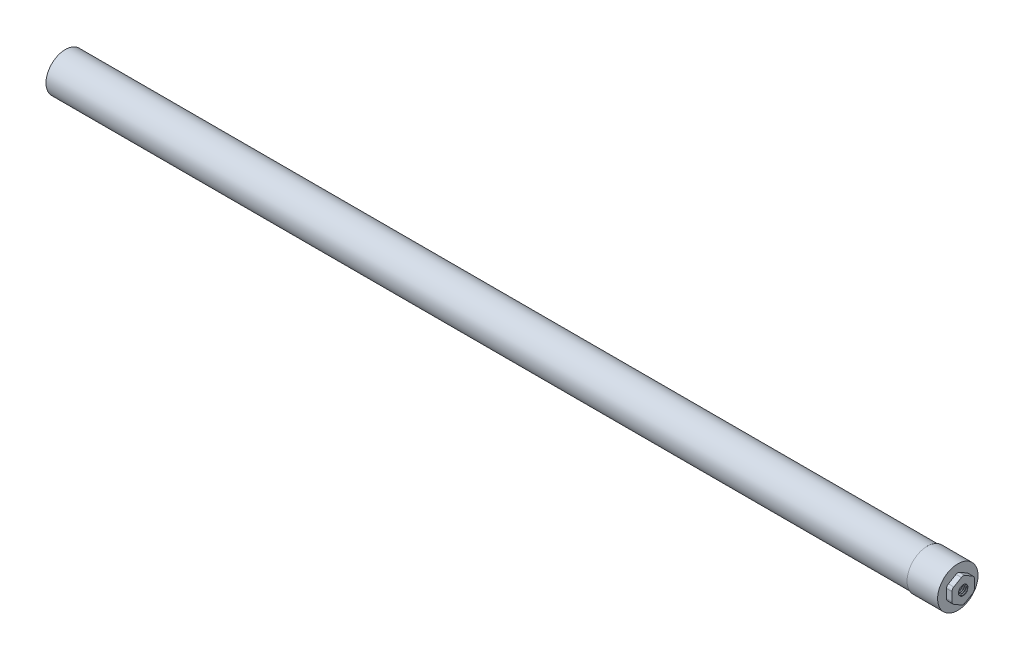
ISO-10303-21;
HEADER;
FILE_DESCRIPTION(('STEP AP214'),'2;1');
FILE_NAME('part.step','',(''),(''),'','','');
FILE_SCHEMA(('AUTOMOTIVE_DESIGN { 1 0 10303 214 1 1 1 1 }'));
ENDSEC;
DATA;
#1=APPLICATION_CONTEXT('core data for automotive mechanical design processes');
#2=APPLICATION_PROTOCOL_DEFINITION('international standard','automotive_design',2000,#1);
#3=PRODUCT_CONTEXT('',#1,'mechanical');
#4=PRODUCT('Part','Part','',(#3));
#5=PRODUCT_RELATED_PRODUCT_CATEGORY('part','',(#4));
#6=PRODUCT_DEFINITION_FORMATION('','',#4);
#7=PRODUCT_DEFINITION_CONTEXT('part definition',#1,'design');
#8=PRODUCT_DEFINITION('design','',#6,#7);
#9=PRODUCT_DEFINITION_SHAPE('','',#8);
#10=(LENGTH_UNIT() NAMED_UNIT(*) SI_UNIT(.MILLI.,.METRE.));
#11=(NAMED_UNIT(*) PLANE_ANGLE_UNIT() SI_UNIT($,.RADIAN.));
#12=(NAMED_UNIT(*) SI_UNIT($,.STERADIAN.) SOLID_ANGLE_UNIT());
#13=UNCERTAINTY_MEASURE_WITH_UNIT(LENGTH_MEASURE(1.E-05),#10,'distance_accuracy_value','');
#14=(GEOMETRIC_REPRESENTATION_CONTEXT(3) GLOBAL_UNCERTAINTY_ASSIGNED_CONTEXT((#13)) GLOBAL_UNIT_ASSIGNED_CONTEXT((#10,
#11,#12)) REPRESENTATION_CONTEXT('',''));
#15=CARTESIAN_POINT('',(0.,0.,0.));
#16=DIRECTION('',(0.,0.,1.));
#17=DIRECTION('',(1.,0.,0.));
#18=AXIS2_PLACEMENT_3D('',#15,#16,#17);
#19=CARTESIAN_POINT('',(13.414375,0.144913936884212,-2.48336778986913));
#20=DIRECTION('',(0.,-0.998301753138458,-0.0582546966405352));
#21=DIRECTION('',(0.,0.0582546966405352,-0.998301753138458));
#22=AXIS2_PLACEMENT_3D('',#19,#20,#21);
#23=PLANE('',#22);
#24=DIRECTION('',(-1.,0.,0.));
#25=VECTOR('',#24,1.);
#26=CARTESIAN_POINT('',(13.414375,0.144913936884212,-2.48336778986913));
#27=LINE('',#26,#25);
#28=CARTESIAN_POINT('',(13.573125,0.144913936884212,-2.48336778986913));
#29=VERTEX_POINT('',#28);
#30=CARTESIAN_POINT('',(13.255625,0.144913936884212,-2.48336778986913));
#31=VERTEX_POINT('',#30);
#32=EDGE_CURVE('P0_E26',#29,#31,#27,.T.);
#33=ORIENTED_EDGE('',*,*,#32,.T.);
#34=DIRECTION('',(-0.5,0.0504500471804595,-0.864554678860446));
#35=VECTOR('',#34,1.);
#36=CARTESIAN_POINT('',(13.0571875,0.164936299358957,-2.82648792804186));
#37=LINE('',#36,#35);
#38=CARTESIAN_POINT('',(12.85875,0.184958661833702,-3.16960806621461));
#39=VERTEX_POINT('',#38);
#40=EDGE_CURVE('P0_E21',#31,#39,#37,.T.);
#41=ORIENTED_EDGE('',*,*,#40,.T.);
#42=DIRECTION('',(0.,0.0582546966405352,-0.998301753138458));
#43=VECTOR('',#42,1.);
#44=CARTESIAN_POINT('',(12.85875,0.1905252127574,-3.26500119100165));
#45=LINE('',#44,#43);
#46=CARTESIAN_POINT('',(12.85875,0.196091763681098,-3.3603943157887));
#47=VERTEX_POINT('',#46);
#48=EDGE_CURVE('P0_E85',#39,#47,#45,.T.);
#49=ORIENTED_EDGE('',*,*,#48,.T.);
#50=DIRECTION('',(0.500000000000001,0.0504500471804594,-0.864554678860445));
#51=VECTOR('',#50,1.);
#52=CARTESIAN_POINT('',(13.096875,0.220118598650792,-3.77213848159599));
#53=LINE('',#52,#51);
#54=CARTESIAN_POINT('',(13.335,0.244145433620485,-4.18388264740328));
#55=VERTEX_POINT('',#54);
#56=EDGE_CURVE('P0_E231',#47,#55,#53,.T.);
#57=ORIENTED_EDGE('',*,*,#56,.T.);
#58=DIRECTION('',(1.,0.,0.));
#59=VECTOR('',#58,1.);
#60=CARTESIAN_POINT('',(13.414375,0.244145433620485,-4.18388264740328));
#61=LINE('',#60,#59);
#62=CARTESIAN_POINT('',(13.49375,0.244145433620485,-4.18388264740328));
#63=VERTEX_POINT('',#62);
#64=EDGE_CURVE('P0_E227',#55,#63,#61,.T.);
#65=ORIENTED_EDGE('',*,*,#64,.T.);
#66=DIRECTION('',(0.500000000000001,-0.0504500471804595,0.864554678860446));
#67=VECTOR('',#66,1.);
#68=CARTESIAN_POINT('',(13.731875,0.220118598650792,-3.77213848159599));
#69=LINE('',#68,#67);
#70=CARTESIAN_POINT('',(13.97,0.196091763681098,-3.3603943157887));
#71=VERTEX_POINT('',#70);
#72=EDGE_CURVE('P0_E221',#63,#71,#69,.T.);
#73=ORIENTED_EDGE('',*,*,#72,.T.);
#74=DIRECTION('',(0.,-0.0582546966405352,0.998301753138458));
#75=VECTOR('',#74,1.);
#76=CARTESIAN_POINT('',(13.97,0.1905252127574,-3.26500119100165));
#77=LINE('',#76,#75);
#78=CARTESIAN_POINT('',(13.97,0.184958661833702,-3.16960806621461));
#79=VERTEX_POINT('',#78);
#80=EDGE_CURVE('P0_E206',#71,#79,#77,.T.);
#81=ORIENTED_EDGE('',*,*,#80,.T.);
#82=DIRECTION('',(-0.5,-0.0504500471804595,0.864554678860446));
#83=VECTOR('',#82,1.);
#84=CARTESIAN_POINT('',(13.7715625,0.164936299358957,-2.82648792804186));
#85=LINE('',#84,#83);
#86=EDGE_CURVE('P0_E42',#79,#29,#85,.T.);
#87=ORIENTED_EDGE('',*,*,#86,.T.);
#88=EDGE_LOOP('',(#33,#41,#49,#57,#65,#73,#81,#87));
#89=FACE_BOUND('',#88,.T.);
#90=ADVANCED_FACE('P0_F17',(#89),#23,.T.);
#91=CARTESIAN_POINT('',(18.494375,0.144913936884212,-2.48336778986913));
#92=DIRECTION('',(0.,0.998301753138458,0.0582546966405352));
#93=DIRECTION('',(0.,-0.0582546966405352,0.998301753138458));
#94=AXIS2_PLACEMENT_3D('',#91,#92,#93);
#95=PLANE('',#94);
#96=DIRECTION('',(1.,0.,0.));
#97=VECTOR('',#96,1.);
#98=CARTESIAN_POINT('',(18.494375,0.144913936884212,-2.48336778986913));
#99=LINE('',#98,#97);
#100=CARTESIAN_POINT('',(18.335625,0.144913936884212,-2.48336778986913));
#101=VERTEX_POINT('',#100);
#102=CARTESIAN_POINT('',(18.653125,0.144913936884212,-2.48336778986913));
#103=VERTEX_POINT('',#102);
#104=EDGE_CURVE('P0_E11',#101,#103,#99,.T.);
#105=ORIENTED_EDGE('',*,*,#104,.T.);
#106=DIRECTION('',(0.5,0.0504500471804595,-0.864554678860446));
#107=VECTOR('',#106,1.);
#108=CARTESIAN_POINT('',(18.8515625,0.164936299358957,-2.82648792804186));
#109=LINE('',#108,#107);
#110=CARTESIAN_POINT('',(19.05,0.184958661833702,-3.16960806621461));
#111=VERTEX_POINT('',#110);
#112=EDGE_CURVE('P0_E268',#103,#111,#109,.T.);
#113=ORIENTED_EDGE('',*,*,#112,.T.);
#114=DIRECTION('',(0.,0.0582546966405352,-0.998301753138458));
#115=VECTOR('',#114,1.);
#116=CARTESIAN_POINT('',(19.05,0.1905252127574,-3.26500119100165));
#117=LINE('',#116,#115);
#118=CARTESIAN_POINT('',(19.05,0.196091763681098,-3.3603943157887));
#119=VERTEX_POINT('',#118);
#120=EDGE_CURVE('P0_E214',#111,#119,#117,.T.);
#121=ORIENTED_EDGE('',*,*,#120,.T.);
#122=DIRECTION('',(-0.500000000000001,0.0504500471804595,-0.864554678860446));
#123=VECTOR('',#122,1.);
#124=CARTESIAN_POINT('',(18.811875,0.220118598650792,-3.77213848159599));
#125=LINE('',#124,#123);
#126=CARTESIAN_POINT('',(18.57375,0.244145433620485,-4.18388264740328));
#127=VERTEX_POINT('',#126);
#128=EDGE_CURVE('P0_E212',#119,#127,#125,.T.);
#129=ORIENTED_EDGE('',*,*,#128,.T.);
#130=DIRECTION('',(-1.,0.,0.));
#131=VECTOR('',#130,1.);
#132=CARTESIAN_POINT('',(18.494375,0.244145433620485,-4.18388264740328));
#133=LINE('',#132,#131);
#134=CARTESIAN_POINT('',(18.415,0.244145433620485,-4.18388264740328));
#135=VERTEX_POINT('',#134);
#136=EDGE_CURVE('P0_E223',#127,#135,#133,.T.);
#137=ORIENTED_EDGE('',*,*,#136,.T.);
#138=DIRECTION('',(-0.500000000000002,-0.0504500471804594,0.864554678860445));
#139=VECTOR('',#138,1.);
#140=CARTESIAN_POINT('',(18.176875,0.220118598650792,-3.77213848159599));
#141=LINE('',#140,#139);
#142=CARTESIAN_POINT('',(17.93875,0.196091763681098,-3.3603943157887));
#143=VERTEX_POINT('',#142);
#144=EDGE_CURVE('P0_E229',#135,#143,#141,.T.);
#145=ORIENTED_EDGE('',*,*,#144,.T.);
#146=DIRECTION('',(0.,-0.0582546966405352,0.998301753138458));
#147=VECTOR('',#146,1.);
#148=CARTESIAN_POINT('',(17.93875,0.1905252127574,-3.26500119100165));
#149=LINE('',#148,#147);
#150=CARTESIAN_POINT('',(17.93875,0.184958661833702,-3.16960806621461));
#151=VERTEX_POINT('',#150);
#152=EDGE_CURVE('P0_E103',#143,#151,#149,.T.);
#153=ORIENTED_EDGE('',*,*,#152,.T.);
#154=DIRECTION('',(0.5,-0.0504500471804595,0.864554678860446));
#155=VECTOR('',#154,1.);
#156=CARTESIAN_POINT('',(18.1371875,0.164936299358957,-2.82648792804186));
#157=LINE('',#156,#155);
#158=EDGE_CURVE('P0_E90',#151,#101,#157,.T.);
#159=ORIENTED_EDGE('',*,*,#158,.T.);
#160=EDGE_LOOP('',(#105,#113,#121,#129,#137,#145,#153,#159));
#161=FACE_BOUND('',#160,.T.);
#162=ADVANCED_FACE('P0_F19',(#161),#95,.T.);
#163=CARTESIAN_POINT('',(13.573125,0.144913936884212,-2.48336778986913));
#164=CARTESIAN_POINT('',(13.6525,1.1735585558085,-2.42334247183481));
#165=CARTESIAN_POINT('',(13.731875,1.85847583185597,-1.65353657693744));
#166=CARTESIAN_POINT('',(13.81125,2.54339310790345,-0.883730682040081));
#167=CARTESIAN_POINT('',(13.890625,2.48336778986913,0.144913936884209));
#168=CARTESIAN_POINT('',(13.97,2.42334247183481,1.1735585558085));
#169=CARTESIAN_POINT('',(14.049375,1.65353657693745,1.85847583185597));
#170=CARTESIAN_POINT('',(14.12875,0.883730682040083,2.54339310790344));
#171=CARTESIAN_POINT('',(14.208125,-0.144913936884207,2.48336778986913));
#172=CARTESIAN_POINT('',(14.2875,-1.1735585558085,2.42334247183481));
#173=CARTESIAN_POINT('',(14.366875,-1.85847583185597,1.65353657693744));
#174=CARTESIAN_POINT('',(14.44625,-2.54339310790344,0.883730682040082));
#175=CARTESIAN_POINT('',(14.525625,-2.48336778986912,-0.144913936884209));
#176=CARTESIAN_POINT('',(14.605,-2.4233424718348,-1.1735585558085));
#177=CARTESIAN_POINT('',(14.684375,-1.65353657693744,-1.85847583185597));
#178=CARTESIAN_POINT('',(14.76375,-0.88373068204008,-2.54339310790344));
#179=CARTESIAN_POINT('',(14.843125,0.144913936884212,-2.48336778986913));
#180=CARTESIAN_POINT('',(14.9225,1.1735585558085,-2.42334247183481));
#181=CARTESIAN_POINT('',(15.001875,1.85847583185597,-1.65353657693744));
#182=CARTESIAN_POINT('',(15.08125,2.54339310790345,-0.883730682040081));
#183=CARTESIAN_POINT('',(15.160625,2.48336778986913,0.144913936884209));
#184=CARTESIAN_POINT('',(15.24,2.42334247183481,1.1735585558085));
#185=CARTESIAN_POINT('',(15.319375,1.65353657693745,1.85847583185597));
#186=CARTESIAN_POINT('',(15.39875,0.883730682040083,2.54339310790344));
#187=CARTESIAN_POINT('',(15.478125,-0.144913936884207,2.48336778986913));
#188=CARTESIAN_POINT('',(15.5575,-1.1735585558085,2.42334247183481));
#189=CARTESIAN_POINT('',(15.636875,-1.85847583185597,1.65353657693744));
#190=CARTESIAN_POINT('',(15.71625,-2.54339310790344,0.883730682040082));
#191=CARTESIAN_POINT('',(15.795625,-2.48336778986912,-0.144913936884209));
#192=CARTESIAN_POINT('',(15.875,-2.4233424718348,-1.1735585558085));
#193=CARTESIAN_POINT('',(15.954375,-1.65353657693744,-1.85847583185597));
#194=CARTESIAN_POINT('',(16.03375,-0.88373068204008,-2.54339310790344));
#195=CARTESIAN_POINT('',(16.113125,0.144913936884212,-2.48336778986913));
#196=CARTESIAN_POINT('',(16.1925,1.1735585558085,-2.42334247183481));
#197=CARTESIAN_POINT('',(16.271875,1.85847583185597,-1.65353657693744));
#198=CARTESIAN_POINT('',(16.35125,2.54339310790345,-0.883730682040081));
#199=CARTESIAN_POINT('',(16.430625,2.48336778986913,0.144913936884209));
#200=CARTESIAN_POINT('',(16.51,2.42334247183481,1.1735585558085));
#201=CARTESIAN_POINT('',(16.589375,1.65353657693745,1.85847583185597));
#202=CARTESIAN_POINT('',(16.66875,0.883730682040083,2.54339310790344));
#203=CARTESIAN_POINT('',(16.748125,-0.144913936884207,2.48336778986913));
#204=CARTESIAN_POINT('',(16.8275,-1.1735585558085,2.42334247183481));
#205=CARTESIAN_POINT('',(16.906875,-1.85847583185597,1.65353657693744));
#206=CARTESIAN_POINT('',(16.98625,-2.54339310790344,0.883730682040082));
#207=CARTESIAN_POINT('',(17.065625,-2.48336778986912,-0.144913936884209));
#208=CARTESIAN_POINT('',(17.145,-2.4233424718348,-1.1735585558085));
#209=CARTESIAN_POINT('',(17.224375,-1.65353657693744,-1.85847583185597));
#210=CARTESIAN_POINT('',(17.30375,-0.88373068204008,-2.54339310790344));
#211=CARTESIAN_POINT('',(17.383125,0.144913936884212,-2.48336778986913));
#212=CARTESIAN_POINT('',(17.4625,1.1735585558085,-2.42334247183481));
#213=CARTESIAN_POINT('',(17.541875,1.85847583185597,-1.65353657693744));
#214=CARTESIAN_POINT('',(17.62125,2.54339310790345,-0.883730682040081));
#215=CARTESIAN_POINT('',(17.700625,2.48336778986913,0.144913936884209));
#216=CARTESIAN_POINT('',(17.78,2.42334247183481,1.1735585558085));
#217=CARTESIAN_POINT('',(17.859375,1.65353657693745,1.85847583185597));
#218=CARTESIAN_POINT('',(17.93875,0.883730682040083,2.54339310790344));
#219=CARTESIAN_POINT('',(18.018125,-0.144913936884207,2.48336778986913));
#220=CARTESIAN_POINT('',(18.0975,-1.1735585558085,2.42334247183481));
#221=CARTESIAN_POINT('',(18.176875,-1.85847583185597,1.65353657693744));
#222=CARTESIAN_POINT('',(18.25625,-2.54339310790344,0.883730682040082));
#223=CARTESIAN_POINT('',(18.335625,-2.48336778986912,-0.144913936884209));
#224=CARTESIAN_POINT('',(18.415,-2.4233424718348,-1.1735585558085));
#225=CARTESIAN_POINT('',(18.494375,-1.65353657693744,-1.85847583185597));
#226=CARTESIAN_POINT('',(18.57375,-0.88373068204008,-2.54339310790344));
#227=CARTESIAN_POINT('',(18.653125,0.144913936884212,-2.48336778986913));
#228=CARTESIAN_POINT('',(13.255625,0.144913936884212,-2.48336778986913));
#229=CARTESIAN_POINT('',(13.335,1.1735585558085,-2.42334247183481));
#230=CARTESIAN_POINT('',(13.414375,1.85847583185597,-1.65353657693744));
#231=CARTESIAN_POINT('',(13.49375,2.54339310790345,-0.883730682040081));
#232=CARTESIAN_POINT('',(13.573125,2.48336778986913,0.144913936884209));
#233=CARTESIAN_POINT('',(13.6525,2.42334247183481,1.1735585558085));
#234=CARTESIAN_POINT('',(13.731875,1.65353657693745,1.85847583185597));
#235=CARTESIAN_POINT('',(13.81125,0.883730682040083,2.54339310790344));
#236=CARTESIAN_POINT('',(13.890625,-0.144913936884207,2.48336778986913));
#237=CARTESIAN_POINT('',(13.97,-1.1735585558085,2.42334247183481));
#238=CARTESIAN_POINT('',(14.049375,-1.85847583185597,1.65353657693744));
#239=CARTESIAN_POINT('',(14.12875,-2.54339310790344,0.883730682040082));
#240=CARTESIAN_POINT('',(14.208125,-2.48336778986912,-0.144913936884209));
#241=CARTESIAN_POINT('',(14.2875,-2.4233424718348,-1.1735585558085));
#242=CARTESIAN_POINT('',(14.366875,-1.65353657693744,-1.85847583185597));
#243=CARTESIAN_POINT('',(14.44625,-0.88373068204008,-2.54339310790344));
#244=CARTESIAN_POINT('',(14.525625,0.144913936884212,-2.48336778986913));
#245=CARTESIAN_POINT('',(14.605,1.1735585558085,-2.42334247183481));
#246=CARTESIAN_POINT('',(14.684375,1.85847583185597,-1.65353657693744));
#247=CARTESIAN_POINT('',(14.76375,2.54339310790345,-0.883730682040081));
#248=CARTESIAN_POINT('',(14.843125,2.48336778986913,0.144913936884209));
#249=CARTESIAN_POINT('',(14.9225,2.42334247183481,1.1735585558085));
#250=CARTESIAN_POINT('',(15.001875,1.65353657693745,1.85847583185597));
#251=CARTESIAN_POINT('',(15.08125,0.883730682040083,2.54339310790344));
#252=CARTESIAN_POINT('',(15.160625,-0.144913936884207,2.48336778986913));
#253=CARTESIAN_POINT('',(15.24,-1.1735585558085,2.42334247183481));
#254=CARTESIAN_POINT('',(15.319375,-1.85847583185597,1.65353657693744));
#255=CARTESIAN_POINT('',(15.39875,-2.54339310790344,0.883730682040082));
#256=CARTESIAN_POINT('',(15.478125,-2.48336778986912,-0.144913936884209));
#257=CARTESIAN_POINT('',(15.5575,-2.4233424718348,-1.1735585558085));
#258=CARTESIAN_POINT('',(15.636875,-1.65353657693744,-1.85847583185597));
#259=CARTESIAN_POINT('',(15.71625,-0.88373068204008,-2.54339310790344));
#260=CARTESIAN_POINT('',(15.795625,0.144913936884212,-2.48336778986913));
#261=CARTESIAN_POINT('',(15.875,1.1735585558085,-2.42334247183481));
#262=CARTESIAN_POINT('',(15.954375,1.85847583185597,-1.65353657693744));
#263=CARTESIAN_POINT('',(16.03375,2.54339310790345,-0.883730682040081));
#264=CARTESIAN_POINT('',(16.113125,2.48336778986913,0.144913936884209));
#265=CARTESIAN_POINT('',(16.1925,2.42334247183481,1.1735585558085));
#266=CARTESIAN_POINT('',(16.271875,1.65353657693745,1.85847583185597));
#267=CARTESIAN_POINT('',(16.35125,0.883730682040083,2.54339310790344));
#268=CARTESIAN_POINT('',(16.430625,-0.144913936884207,2.48336778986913));
#269=CARTESIAN_POINT('',(16.51,-1.1735585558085,2.42334247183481));
#270=CARTESIAN_POINT('',(16.589375,-1.85847583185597,1.65353657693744));
#271=CARTESIAN_POINT('',(16.66875,-2.54339310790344,0.883730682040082));
#272=CARTESIAN_POINT('',(16.748125,-2.48336778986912,-0.144913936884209));
#273=CARTESIAN_POINT('',(16.8275,-2.4233424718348,-1.1735585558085));
#274=CARTESIAN_POINT('',(16.906875,-1.65353657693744,-1.85847583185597));
#275=CARTESIAN_POINT('',(16.98625,-0.88373068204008,-2.54339310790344));
#276=CARTESIAN_POINT('',(17.065625,0.144913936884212,-2.48336778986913));
#277=CARTESIAN_POINT('',(17.145,1.1735585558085,-2.42334247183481));
#278=CARTESIAN_POINT('',(17.224375,1.85847583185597,-1.65353657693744));
#279=CARTESIAN_POINT('',(17.30375,2.54339310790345,-0.883730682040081));
#280=CARTESIAN_POINT('',(17.383125,2.48336778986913,0.144913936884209));
#281=CARTESIAN_POINT('',(17.4625,2.42334247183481,1.1735585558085));
#282=CARTESIAN_POINT('',(17.541875,1.65353657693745,1.85847583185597));
#283=CARTESIAN_POINT('',(17.62125,0.883730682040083,2.54339310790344));
#284=CARTESIAN_POINT('',(17.700625,-0.144913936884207,2.48336778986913));
#285=CARTESIAN_POINT('',(17.78,-1.1735585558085,2.42334247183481));
#286=CARTESIAN_POINT('',(17.859375,-1.85847583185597,1.65353657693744));
#287=CARTESIAN_POINT('',(17.93875,-2.54339310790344,0.883730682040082));
#288=CARTESIAN_POINT('',(18.018125,-2.48336778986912,-0.144913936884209));
#289=CARTESIAN_POINT('',(18.0975,-2.4233424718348,-1.1735585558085));
#290=CARTESIAN_POINT('',(18.176875,-1.65353657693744,-1.85847583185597));
#291=CARTESIAN_POINT('',(18.25625,-0.88373068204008,-2.54339310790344));
#292=CARTESIAN_POINT('',(18.335625,0.144913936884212,-2.48336778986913));
#293=(BOUNDED_SURFACE() B_SPLINE_SURFACE(1,2,((#163,#164,#165,#166,#167,#168,#169,#170,#171,
#172,#173,#174,#175,#176,#177,#178,#179,#180,#181,#182,#183,#184,#185,#186,#187,#188,#189,#190,
#191,#192,#193,#194,#195,#196,#197,#198,#199,#200,#201,#202,#203,#204,#205,#206,#207,#208,#209,
#210,#211,#212,#213,#214,#215,#216,#217,#218,#219,#220,#221,#222,#223,#224,#225,#226,#227),
(#228,#229,#230,#231,#232,#233,#234,#235,#236,#237,#238,#239,#240,#241,#242,#243,#244,#245,#246,
#247,#248,#249,#250,#251,#252,#253,#254,#255,#256,#257,#258,#259,#260,#261,#262,#263,#264,#265,
#266,#267,#268,#269,#270,#271,#272,#273,#274,#275,#276,#277,#278,#279,#280,#281,#282,#283,#284,
#285,#286,#287,#288,#289,#290,#291,#292)),.UNSPECIFIED.,.F.,.F.,
.F.) B_SPLINE_SURFACE_WITH_KNOTS((2,2),(3,2,2,2,2,2,2,2,2,2,2,2,2,2,2,2,2,2,2,2,2,2,2,2,2,2,2,2,
2,2,2,2,3),(0.,1.),(0.,0.03125,0.0625,0.09375,0.125,0.15625,0.1875,0.21875,0.25,0.28125,0.3125,
0.34375,0.375,0.40625,0.4375,0.46875,0.5,0.53125,0.5625,0.59375,0.625,0.65625,0.6875,0.71875,
0.75,0.78125,0.8125,0.84375,0.875,0.90625,0.9375,0.96875,1.),
.UNSPECIFIED.) GEOMETRIC_REPRESENTATION_ITEM() RATIONAL_B_SPLINE_SURFACE(((1.,0.923879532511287,
1.,0.923879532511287,1.,0.923879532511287,1.,0.923879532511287,1.,0.923879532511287,1.,
0.923879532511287,1.,0.923879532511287,1.,0.923879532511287,1.,0.923879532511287,1.,
0.923879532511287,1.,0.923879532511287,1.,0.923879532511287,1.,0.923879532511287,1.,
0.923879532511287,1.,0.923879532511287,1.,0.923879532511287,1.,0.923879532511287,1.,
0.923879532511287,1.,0.923879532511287,1.,0.923879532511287,1.,0.923879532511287,1.,
0.923879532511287,1.,0.923879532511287,1.,0.923879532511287,1.,0.923879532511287,1.,
0.923879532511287,1.,0.923879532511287,1.,0.923879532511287,1.,0.923879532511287,1.,
0.923879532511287,1.,0.923879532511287,1.,0.923879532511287,1.),(1.,0.923879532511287,1.,
0.923879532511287,1.,0.923879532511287,1.,0.923879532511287,1.,0.923879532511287,1.,
0.923879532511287,1.,0.923879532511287,1.,0.923879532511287,1.,0.923879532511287,1.,
0.923879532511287,1.,0.923879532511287,1.,0.923879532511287,1.,0.923879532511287,1.,
0.923879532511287,1.,0.923879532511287,1.,0.923879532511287,1.,0.923879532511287,1.,
0.923879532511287,1.,0.923879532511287,1.,0.923879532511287,1.,0.923879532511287,1.,
0.923879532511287,1.,0.923879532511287,1.,0.923879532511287,1.,0.923879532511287,1.,
0.923879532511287,1.,0.923879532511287,1.,0.923879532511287,1.,0.923879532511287,1.,
0.923879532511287,1.,0.923879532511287,1.,0.923879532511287,1.))) REPRESENTATION_ITEM('') SURFACE());
#294=CARTESIAN_POINT('',(13.573125,0.144913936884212,-2.48336778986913));
#295=CARTESIAN_POINT('',(13.6525,1.1735585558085,-2.42334247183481));
#296=CARTESIAN_POINT('',(13.731875,1.85847583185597,-1.65353657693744));
#297=CARTESIAN_POINT('',(13.81125,2.54339310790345,-0.883730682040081));
#298=CARTESIAN_POINT('',(13.890625,2.48336778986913,0.144913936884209));
#299=CARTESIAN_POINT('',(13.97,2.42334247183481,1.1735585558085));
#300=CARTESIAN_POINT('',(14.049375,1.65353657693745,1.85847583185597));
#301=CARTESIAN_POINT('',(14.12875,0.883730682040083,2.54339310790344));
#302=CARTESIAN_POINT('',(14.208125,-0.144913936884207,2.48336778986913));
#303=CARTESIAN_POINT('',(14.2875,-1.1735585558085,2.42334247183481));
#304=CARTESIAN_POINT('',(14.366875,-1.85847583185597,1.65353657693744));
#305=CARTESIAN_POINT('',(14.44625,-2.54339310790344,0.883730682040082));
#306=CARTESIAN_POINT('',(14.525625,-2.48336778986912,-0.144913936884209));
#307=CARTESIAN_POINT('',(14.605,-2.4233424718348,-1.1735585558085));
#308=CARTESIAN_POINT('',(14.684375,-1.65353657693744,-1.85847583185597));
#309=CARTESIAN_POINT('',(14.76375,-0.88373068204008,-2.54339310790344));
#310=CARTESIAN_POINT('',(14.843125,0.144913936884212,-2.48336778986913));
#311=CARTESIAN_POINT('',(14.9225,1.1735585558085,-2.42334247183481));
#312=CARTESIAN_POINT('',(15.001875,1.85847583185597,-1.65353657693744));
#313=CARTESIAN_POINT('',(15.08125,2.54339310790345,-0.883730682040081));
#314=CARTESIAN_POINT('',(15.160625,2.48336778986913,0.144913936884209));
#315=CARTESIAN_POINT('',(15.24,2.42334247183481,1.1735585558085));
#316=CARTESIAN_POINT('',(15.319375,1.65353657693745,1.85847583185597));
#317=CARTESIAN_POINT('',(15.39875,0.883730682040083,2.54339310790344));
#318=CARTESIAN_POINT('',(15.478125,-0.144913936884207,2.48336778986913));
#319=CARTESIAN_POINT('',(15.5575,-1.1735585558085,2.42334247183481));
#320=CARTESIAN_POINT('',(15.636875,-1.85847583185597,1.65353657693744));
#321=CARTESIAN_POINT('',(15.71625,-2.54339310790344,0.883730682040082));
#322=CARTESIAN_POINT('',(15.795625,-2.48336778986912,-0.144913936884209));
#323=CARTESIAN_POINT('',(15.875,-2.4233424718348,-1.1735585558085));
#324=CARTESIAN_POINT('',(15.954375,-1.65353657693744,-1.85847583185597));
#325=CARTESIAN_POINT('',(16.03375,-0.88373068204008,-2.54339310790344));
#326=CARTESIAN_POINT('',(16.113125,0.144913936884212,-2.48336778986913));
#327=CARTESIAN_POINT('',(16.1925,1.1735585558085,-2.42334247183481));
#328=CARTESIAN_POINT('',(16.271875,1.85847583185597,-1.65353657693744));
#329=CARTESIAN_POINT('',(16.35125,2.54339310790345,-0.883730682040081));
#330=CARTESIAN_POINT('',(16.430625,2.48336778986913,0.144913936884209));
#331=CARTESIAN_POINT('',(16.51,2.42334247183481,1.1735585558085));
#332=CARTESIAN_POINT('',(16.589375,1.65353657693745,1.85847583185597));
#333=CARTESIAN_POINT('',(16.66875,0.883730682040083,2.54339310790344));
#334=CARTESIAN_POINT('',(16.748125,-0.144913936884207,2.48336778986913));
#335=CARTESIAN_POINT('',(16.8275,-1.1735585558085,2.42334247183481));
#336=CARTESIAN_POINT('',(16.906875,-1.85847583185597,1.65353657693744));
#337=CARTESIAN_POINT('',(16.98625,-2.54339310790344,0.883730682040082));
#338=CARTESIAN_POINT('',(17.065625,-2.48336778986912,-0.144913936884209));
#339=CARTESIAN_POINT('',(17.145,-2.4233424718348,-1.1735585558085));
#340=CARTESIAN_POINT('',(17.224375,-1.65353657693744,-1.85847583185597));
#341=CARTESIAN_POINT('',(17.30375,-0.88373068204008,-2.54339310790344));
#342=CARTESIAN_POINT('',(17.383125,0.144913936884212,-2.48336778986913));
#343=CARTESIAN_POINT('',(17.4625,1.1735585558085,-2.42334247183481));
#344=CARTESIAN_POINT('',(17.541875,1.85847583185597,-1.65353657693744));
#345=CARTESIAN_POINT('',(17.62125,2.54339310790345,-0.883730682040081));
#346=CARTESIAN_POINT('',(17.700625,2.48336778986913,0.144913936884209));
#347=CARTESIAN_POINT('',(17.78,2.42334247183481,1.1735585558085));
#348=CARTESIAN_POINT('',(17.859375,1.65353657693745,1.85847583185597));
#349=CARTESIAN_POINT('',(17.93875,0.883730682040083,2.54339310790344));
#350=CARTESIAN_POINT('',(18.018125,-0.144913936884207,2.48336778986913));
#351=CARTESIAN_POINT('',(18.0975,-1.1735585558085,2.42334247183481));
#352=CARTESIAN_POINT('',(18.176875,-1.85847583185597,1.65353657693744));
#353=CARTESIAN_POINT('',(18.25625,-2.54339310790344,0.883730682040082));
#354=CARTESIAN_POINT('',(18.335625,-2.48336778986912,-0.144913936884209));
#355=CARTESIAN_POINT('',(18.415,-2.4233424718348,-1.1735585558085));
#356=CARTESIAN_POINT('',(18.494375,-1.65353657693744,-1.85847583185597));
#357=CARTESIAN_POINT('',(18.57375,-0.88373068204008,-2.54339310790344));
#358=CARTESIAN_POINT('',(18.653125,0.144913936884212,-2.48336778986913));
#359=(BOUNDED_CURVE() B_SPLINE_CURVE(2,(#294,#295,#296,#297,#298,#299,#300,#301,#302,#303,#304,
#305,#306,#307,#308,#309,#310,#311,#312,#313,#314,#315,#316,#317,#318,#319,#320,#321,#322,#323,
#324,#325,#326,#327,#328,#329,#330,#331,#332,#333,#334,#335,#336,#337,#338,#339,#340,#341,#342,
#343,#344,#345,#346,#347,#348,#349,#350,#351,#352,#353,#354,#355,#356,#357,#358),.UNSPECIFIED.,
.F.,.F.) B_SPLINE_CURVE_WITH_KNOTS((3,2,2,2,2,2,2,2,2,2,2,2,2,2,2,2,2,2,2,2,2,2,2,2,2,2,2,2,2,2,
2,2,3),(0.,0.03125,0.0625,0.09375,0.125,0.15625,0.1875,0.21875,0.25,0.28125,0.3125,0.34375,
0.375,0.40625,0.4375,0.46875,0.5,0.53125,0.5625,0.59375,0.625,0.65625,0.6875,0.71875,0.75,
0.78125,0.8125,0.84375,0.875,0.90625,0.9375,0.96875,1.),
.UNSPECIFIED.) CURVE() GEOMETRIC_REPRESENTATION_ITEM() RATIONAL_B_SPLINE_CURVE((1.,
0.923879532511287,1.,0.923879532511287,1.,0.923879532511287,1.,0.923879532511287,1.,
0.923879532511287,1.,0.923879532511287,1.,0.923879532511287,1.,0.923879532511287,1.,
0.923879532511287,1.,0.923879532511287,1.,0.923879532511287,1.,0.923879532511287,1.,
0.923879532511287,1.,0.923879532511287,1.,0.923879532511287,1.,0.923879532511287,1.,
0.923879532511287,1.,0.923879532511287,1.,0.923879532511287,1.,0.923879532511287,1.,
0.923879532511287,1.,0.923879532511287,1.,0.923879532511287,1.,0.923879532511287,1.,
0.923879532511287,1.,0.923879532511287,1.,0.923879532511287,1.,0.923879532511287,1.,
0.923879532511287,1.,0.923879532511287,1.,0.923879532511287,1.,0.923879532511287,1.)) REPRESENTATION_ITEM(''));
#360=EDGE_CURVE('P0_E34',#29,#103,#359,.T.);
#361=CARTESIAN_POINT('',(13.255625,0.144913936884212,-2.48336778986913));
#362=CARTESIAN_POINT('',(13.335,1.1735585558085,-2.42334247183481));
#363=CARTESIAN_POINT('',(13.414375,1.85847583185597,-1.65353657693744));
#364=CARTESIAN_POINT('',(13.49375,2.54339310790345,-0.883730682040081));
#365=CARTESIAN_POINT('',(13.573125,2.48336778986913,0.144913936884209));
#366=CARTESIAN_POINT('',(13.6525,2.42334247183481,1.1735585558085));
#367=CARTESIAN_POINT('',(13.731875,1.65353657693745,1.85847583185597));
#368=CARTESIAN_POINT('',(13.81125,0.883730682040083,2.54339310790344));
#369=CARTESIAN_POINT('',(13.890625,-0.144913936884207,2.48336778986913));
#370=CARTESIAN_POINT('',(13.97,-1.1735585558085,2.42334247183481));
#371=CARTESIAN_POINT('',(14.049375,-1.85847583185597,1.65353657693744));
#372=CARTESIAN_POINT('',(14.12875,-2.54339310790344,0.883730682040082));
#373=CARTESIAN_POINT('',(14.208125,-2.48336778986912,-0.144913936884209));
#374=CARTESIAN_POINT('',(14.2875,-2.4233424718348,-1.1735585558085));
#375=CARTESIAN_POINT('',(14.366875,-1.65353657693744,-1.85847583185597));
#376=CARTESIAN_POINT('',(14.44625,-0.88373068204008,-2.54339310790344));
#377=CARTESIAN_POINT('',(14.525625,0.144913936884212,-2.48336778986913));
#378=CARTESIAN_POINT('',(14.605,1.1735585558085,-2.42334247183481));
#379=CARTESIAN_POINT('',(14.684375,1.85847583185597,-1.65353657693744));
#380=CARTESIAN_POINT('',(14.76375,2.54339310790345,-0.883730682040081));
#381=CARTESIAN_POINT('',(14.843125,2.48336778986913,0.144913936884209));
#382=CARTESIAN_POINT('',(14.9225,2.42334247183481,1.1735585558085));
#383=CARTESIAN_POINT('',(15.001875,1.65353657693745,1.85847583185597));
#384=CARTESIAN_POINT('',(15.08125,0.883730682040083,2.54339310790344));
#385=CARTESIAN_POINT('',(15.160625,-0.144913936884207,2.48336778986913));
#386=CARTESIAN_POINT('',(15.24,-1.1735585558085,2.42334247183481));
#387=CARTESIAN_POINT('',(15.319375,-1.85847583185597,1.65353657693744));
#388=CARTESIAN_POINT('',(15.39875,-2.54339310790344,0.883730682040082));
#389=CARTESIAN_POINT('',(15.478125,-2.48336778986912,-0.144913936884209));
#390=CARTESIAN_POINT('',(15.5575,-2.4233424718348,-1.1735585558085));
#391=CARTESIAN_POINT('',(15.636875,-1.65353657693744,-1.85847583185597));
#392=CARTESIAN_POINT('',(15.71625,-0.88373068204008,-2.54339310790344));
#393=CARTESIAN_POINT('',(15.795625,0.144913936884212,-2.48336778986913));
#394=CARTESIAN_POINT('',(15.875,1.1735585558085,-2.42334247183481));
#395=CARTESIAN_POINT('',(15.954375,1.85847583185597,-1.65353657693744));
#396=CARTESIAN_POINT('',(16.03375,2.54339310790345,-0.883730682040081));
#397=CARTESIAN_POINT('',(16.113125,2.48336778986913,0.144913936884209));
#398=CARTESIAN_POINT('',(16.1925,2.42334247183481,1.1735585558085));
#399=CARTESIAN_POINT('',(16.271875,1.65353657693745,1.85847583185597));
#400=CARTESIAN_POINT('',(16.35125,0.883730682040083,2.54339310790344));
#401=CARTESIAN_POINT('',(16.430625,-0.144913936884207,2.48336778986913));
#402=CARTESIAN_POINT('',(16.51,-1.1735585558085,2.42334247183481));
#403=CARTESIAN_POINT('',(16.589375,-1.85847583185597,1.65353657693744));
#404=CARTESIAN_POINT('',(16.66875,-2.54339310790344,0.883730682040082));
#405=CARTESIAN_POINT('',(16.748125,-2.48336778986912,-0.144913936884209));
#406=CARTESIAN_POINT('',(16.8275,-2.4233424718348,-1.1735585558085));
#407=CARTESIAN_POINT('',(16.906875,-1.65353657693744,-1.85847583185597));
#408=CARTESIAN_POINT('',(16.98625,-0.88373068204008,-2.54339310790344));
#409=CARTESIAN_POINT('',(17.065625,0.144913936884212,-2.48336778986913));
#410=CARTESIAN_POINT('',(17.145,1.1735585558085,-2.42334247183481));
#411=CARTESIAN_POINT('',(17.224375,1.85847583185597,-1.65353657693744));
#412=CARTESIAN_POINT('',(17.30375,2.54339310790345,-0.883730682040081));
#413=CARTESIAN_POINT('',(17.383125,2.48336778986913,0.144913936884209));
#414=CARTESIAN_POINT('',(17.4625,2.42334247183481,1.1735585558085));
#415=CARTESIAN_POINT('',(17.541875,1.65353657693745,1.85847583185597));
#416=CARTESIAN_POINT('',(17.62125,0.883730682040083,2.54339310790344));
#417=CARTESIAN_POINT('',(17.700625,-0.144913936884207,2.48336778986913));
#418=CARTESIAN_POINT('',(17.78,-1.1735585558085,2.42334247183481));
#419=CARTESIAN_POINT('',(17.859375,-1.85847583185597,1.65353657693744));
#420=CARTESIAN_POINT('',(17.93875,-2.54339310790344,0.883730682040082));
#421=CARTESIAN_POINT('',(18.018125,-2.48336778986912,-0.144913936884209));
#422=CARTESIAN_POINT('',(18.0975,-2.4233424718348,-1.1735585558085));
#423=CARTESIAN_POINT('',(18.176875,-1.65353657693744,-1.85847583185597));
#424=CARTESIAN_POINT('',(18.25625,-0.88373068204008,-2.54339310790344));
#425=CARTESIAN_POINT('',(18.335625,0.144913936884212,-2.48336778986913));
#426=(BOUNDED_CURVE() B_SPLINE_CURVE(2,(#361,#362,#363,#364,#365,#366,#367,#368,#369,#370,#371,
#372,#373,#374,#375,#376,#377,#378,#379,#380,#381,#382,#383,#384,#385,#386,#387,#388,#389,#390,
#391,#392,#393,#394,#395,#396,#397,#398,#399,#400,#401,#402,#403,#404,#405,#406,#407,#408,#409,
#410,#411,#412,#413,#414,#415,#416,#417,#418,#419,#420,#421,#422,#423,#424,#425),.UNSPECIFIED.,
.F.,.F.) B_SPLINE_CURVE_WITH_KNOTS((3,2,2,2,2,2,2,2,2,2,2,2,2,2,2,2,2,2,2,2,2,2,2,2,2,2,2,2,2,2,
2,2,3),(0.,0.03125,0.0625,0.09375,0.125,0.15625,0.1875,0.21875,0.25,0.28125,0.3125,0.34375,
0.375,0.40625,0.4375,0.46875,0.5,0.53125,0.5625,0.59375,0.625,0.65625,0.6875,0.71875,0.75,
0.78125,0.8125,0.84375,0.875,0.90625,0.9375,0.96875,1.),
.UNSPECIFIED.) CURVE() GEOMETRIC_REPRESENTATION_ITEM() RATIONAL_B_SPLINE_CURVE((1.,
0.923879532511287,1.,0.923879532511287,1.,0.923879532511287,1.,0.923879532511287,1.,
0.923879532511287,1.,0.923879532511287,1.,0.923879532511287,1.,0.923879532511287,1.,
0.923879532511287,1.,0.923879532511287,1.,0.923879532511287,1.,0.923879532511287,1.,
0.923879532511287,1.,0.923879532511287,1.,0.923879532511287,1.,0.923879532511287,1.,
0.923879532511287,1.,0.923879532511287,1.,0.923879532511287,1.,0.923879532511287,1.,
0.923879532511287,1.,0.923879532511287,1.,0.923879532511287,1.,0.923879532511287,1.,
0.923879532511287,1.,0.923879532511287,1.,0.923879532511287,1.,0.923879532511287,1.,
0.923879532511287,1.,0.923879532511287,1.,0.923879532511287,1.,0.923879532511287,1.)) REPRESENTATION_ITEM(''));
#427=EDGE_CURVE('P0_E97',#31,#101,#426,.T.);
#428=ORIENTED_EDGE('',*,*,#32,.F.);
#429=ORIENTED_EDGE('',*,*,#360,.T.);
#430=ORIENTED_EDGE('',*,*,#104,.F.);
#431=ORIENTED_EDGE('',*,*,#427,.F.);
#432=EDGE_LOOP('',(#428,#429,#430,#431));
#433=FACE_BOUND('',#432,.T.);
#434=ADVANCED_FACE('P0_F111',(#433),#293,.F.);
#435=CARTESIAN_POINT('',(13.97,0.184958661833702,-3.16960806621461));
#436=CARTESIAN_POINT('',(14.049375,1.49785331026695,-3.09299568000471));
#437=CARTESIAN_POINT('',(14.12875,2.37203688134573,-2.11046583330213));
#438=CARTESIAN_POINT('',(14.208125,3.2462204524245,-1.12793598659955));
#439=CARTESIAN_POINT('',(14.2875,3.16960806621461,0.184958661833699));
#440=CARTESIAN_POINT('',(14.366875,3.09299568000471,1.49785331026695));
#441=CARTESIAN_POINT('',(14.44625,2.11046583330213,2.37203688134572));
#442=CARTESIAN_POINT('',(14.525625,1.12793598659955,3.2462204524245));
#443=CARTESIAN_POINT('',(14.605,-0.184958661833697,3.16960806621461));
#444=CARTESIAN_POINT('',(14.684375,-1.49785331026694,3.09299568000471));
#445=CARTESIAN_POINT('',(14.76375,-2.37203688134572,2.11046583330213));
#446=CARTESIAN_POINT('',(14.843125,-3.2462204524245,1.12793598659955));
#447=CARTESIAN_POINT('',(14.9225,-3.1696080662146,-0.184958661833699));
#448=CARTESIAN_POINT('',(15.001875,-3.09299568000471,-1.49785331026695));
#449=CARTESIAN_POINT('',(15.08125,-2.11046583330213,-2.37203688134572));
#450=CARTESIAN_POINT('',(15.160625,-1.12793598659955,-3.2462204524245));
#451=CARTESIAN_POINT('',(15.24,0.184958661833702,-3.16960806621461));
#452=CARTESIAN_POINT('',(15.319375,1.49785331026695,-3.09299568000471));
#453=CARTESIAN_POINT('',(15.39875,2.37203688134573,-2.11046583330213));
#454=CARTESIAN_POINT('',(15.478125,3.2462204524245,-1.12793598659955));
#455=CARTESIAN_POINT('',(15.5575,3.16960806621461,0.184958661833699));
#456=CARTESIAN_POINT('',(15.636875,3.09299568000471,1.49785331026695));
#457=CARTESIAN_POINT('',(15.71625,2.11046583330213,2.37203688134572));
#458=CARTESIAN_POINT('',(15.795625,1.12793598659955,3.2462204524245));
#459=CARTESIAN_POINT('',(15.875,-0.184958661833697,3.16960806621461));
#460=CARTESIAN_POINT('',(15.954375,-1.49785331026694,3.09299568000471));
#461=CARTESIAN_POINT('',(16.03375,-2.37203688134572,2.11046583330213));
#462=CARTESIAN_POINT('',(16.113125,-3.2462204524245,1.12793598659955));
#463=CARTESIAN_POINT('',(16.1925,-3.1696080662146,-0.184958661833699));
#464=CARTESIAN_POINT('',(16.271875,-3.09299568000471,-1.49785331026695));
#465=CARTESIAN_POINT('',(16.35125,-2.11046583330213,-2.37203688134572));
#466=CARTESIAN_POINT('',(16.430625,-1.12793598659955,-3.2462204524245));
#467=CARTESIAN_POINT('',(16.51,0.184958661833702,-3.16960806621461));
#468=CARTESIAN_POINT('',(16.589375,1.49785331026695,-3.09299568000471));
#469=CARTESIAN_POINT('',(16.66875,2.37203688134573,-2.11046583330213));
#470=CARTESIAN_POINT('',(16.748125,3.2462204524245,-1.12793598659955));
#471=CARTESIAN_POINT('',(16.8275,3.16960806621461,0.184958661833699));
#472=CARTESIAN_POINT('',(16.906875,3.09299568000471,1.49785331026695));
#473=CARTESIAN_POINT('',(16.98625,2.11046583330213,2.37203688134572));
#474=CARTESIAN_POINT('',(17.065625,1.12793598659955,3.2462204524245));
#475=CARTESIAN_POINT('',(17.145,-0.184958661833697,3.16960806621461));
#476=CARTESIAN_POINT('',(17.224375,-1.49785331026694,3.09299568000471));
#477=CARTESIAN_POINT('',(17.30375,-2.37203688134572,2.11046583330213));
#478=CARTESIAN_POINT('',(17.383125,-3.2462204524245,1.12793598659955));
#479=CARTESIAN_POINT('',(17.4625,-3.1696080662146,-0.184958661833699));
#480=CARTESIAN_POINT('',(17.541875,-3.09299568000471,-1.49785331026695));
#481=CARTESIAN_POINT('',(17.62125,-2.11046583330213,-2.37203688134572));
#482=CARTESIAN_POINT('',(17.700625,-1.12793598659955,-3.2462204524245));
#483=CARTESIAN_POINT('',(17.78,0.184958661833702,-3.16960806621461));
#484=CARTESIAN_POINT('',(17.859375,1.49785331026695,-3.09299568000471));
#485=CARTESIAN_POINT('',(17.93875,2.37203688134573,-2.11046583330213));
#486=CARTESIAN_POINT('',(18.018125,3.2462204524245,-1.12793598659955));
#487=CARTESIAN_POINT('',(18.0975,3.16960806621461,0.184958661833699));
#488=CARTESIAN_POINT('',(18.176875,3.09299568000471,1.49785331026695));
#489=CARTESIAN_POINT('',(18.25625,2.11046583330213,2.37203688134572));
#490=CARTESIAN_POINT('',(18.335625,1.12793598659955,3.2462204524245));
#491=CARTESIAN_POINT('',(18.415,-0.184958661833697,3.16960806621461));
#492=CARTESIAN_POINT('',(18.494375,-1.49785331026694,3.09299568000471));
#493=CARTESIAN_POINT('',(18.57375,-2.37203688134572,2.11046583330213));
#494=CARTESIAN_POINT('',(18.653125,-3.2462204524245,1.12793598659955));
#495=CARTESIAN_POINT('',(18.7325,-3.1696080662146,-0.184958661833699));
#496=CARTESIAN_POINT('',(18.811875,-3.09299568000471,-1.49785331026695));
#497=CARTESIAN_POINT('',(18.89125,-2.11046583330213,-2.37203688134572));
#498=CARTESIAN_POINT('',(18.970625,-1.12793598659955,-3.2462204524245));
#499=CARTESIAN_POINT('',(19.05,0.184958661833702,-3.16960806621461));
#500=CARTESIAN_POINT('',(13.573125,0.144913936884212,-2.48336778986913));
#501=CARTESIAN_POINT('',(13.6525,1.1735585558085,-2.42334247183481));
#502=CARTESIAN_POINT('',(13.731875,1.85847583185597,-1.65353657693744));
#503=CARTESIAN_POINT('',(13.81125,2.54339310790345,-0.883730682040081));
#504=CARTESIAN_POINT('',(13.890625,2.48336778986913,0.144913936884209));
#505=CARTESIAN_POINT('',(13.97,2.42334247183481,1.1735585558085));
#506=CARTESIAN_POINT('',(14.049375,1.65353657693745,1.85847583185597));
#507=CARTESIAN_POINT('',(14.12875,0.883730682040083,2.54339310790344));
#508=CARTESIAN_POINT('',(14.208125,-0.144913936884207,2.48336778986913));
#509=CARTESIAN_POINT('',(14.2875,-1.1735585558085,2.42334247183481));
#510=CARTESIAN_POINT('',(14.366875,-1.85847583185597,1.65353657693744));
#511=CARTESIAN_POINT('',(14.44625,-2.54339310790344,0.883730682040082));
#512=CARTESIAN_POINT('',(14.525625,-2.48336778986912,-0.144913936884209));
#513=CARTESIAN_POINT('',(14.605,-2.4233424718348,-1.1735585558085));
#514=CARTESIAN_POINT('',(14.684375,-1.65353657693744,-1.85847583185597));
#515=CARTESIAN_POINT('',(14.76375,-0.88373068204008,-2.54339310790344));
#516=CARTESIAN_POINT('',(14.843125,0.144913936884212,-2.48336778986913));
#517=CARTESIAN_POINT('',(14.9225,1.1735585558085,-2.42334247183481));
#518=CARTESIAN_POINT('',(15.001875,1.85847583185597,-1.65353657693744));
#519=CARTESIAN_POINT('',(15.08125,2.54339310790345,-0.883730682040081));
#520=CARTESIAN_POINT('',(15.160625,2.48336778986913,0.144913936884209));
#521=CARTESIAN_POINT('',(15.24,2.42334247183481,1.1735585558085));
#522=CARTESIAN_POINT('',(15.319375,1.65353657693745,1.85847583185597));
#523=CARTESIAN_POINT('',(15.39875,0.883730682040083,2.54339310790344));
#524=CARTESIAN_POINT('',(15.478125,-0.144913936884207,2.48336778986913));
#525=CARTESIAN_POINT('',(15.5575,-1.1735585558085,2.42334247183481));
#526=CARTESIAN_POINT('',(15.636875,-1.85847583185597,1.65353657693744));
#527=CARTESIAN_POINT('',(15.71625,-2.54339310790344,0.883730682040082));
#528=CARTESIAN_POINT('',(15.795625,-2.48336778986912,-0.144913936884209));
#529=CARTESIAN_POINT('',(15.875,-2.4233424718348,-1.1735585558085));
#530=CARTESIAN_POINT('',(15.954375,-1.65353657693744,-1.85847583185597));
#531=CARTESIAN_POINT('',(16.03375,-0.88373068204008,-2.54339310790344));
#532=CARTESIAN_POINT('',(16.113125,0.144913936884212,-2.48336778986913));
#533=CARTESIAN_POINT('',(16.1925,1.1735585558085,-2.42334247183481));
#534=CARTESIAN_POINT('',(16.271875,1.85847583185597,-1.65353657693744));
#535=CARTESIAN_POINT('',(16.35125,2.54339310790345,-0.883730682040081));
#536=CARTESIAN_POINT('',(16.430625,2.48336778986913,0.144913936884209));
#537=CARTESIAN_POINT('',(16.51,2.42334247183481,1.1735585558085));
#538=CARTESIAN_POINT('',(16.589375,1.65353657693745,1.85847583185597));
#539=CARTESIAN_POINT('',(16.66875,0.883730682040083,2.54339310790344));
#540=CARTESIAN_POINT('',(16.748125,-0.144913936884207,2.48336778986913));
#541=CARTESIAN_POINT('',(16.8275,-1.1735585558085,2.42334247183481));
#542=CARTESIAN_POINT('',(16.906875,-1.85847583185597,1.65353657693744));
#543=CARTESIAN_POINT('',(16.98625,-2.54339310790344,0.883730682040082));
#544=CARTESIAN_POINT('',(17.065625,-2.48336778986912,-0.144913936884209));
#545=CARTESIAN_POINT('',(17.145,-2.4233424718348,-1.1735585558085));
#546=CARTESIAN_POINT('',(17.224375,-1.65353657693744,-1.85847583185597));
#547=CARTESIAN_POINT('',(17.30375,-0.88373068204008,-2.54339310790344));
#548=CARTESIAN_POINT('',(17.383125,0.144913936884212,-2.48336778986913));
#549=CARTESIAN_POINT('',(17.4625,1.1735585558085,-2.42334247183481));
#550=CARTESIAN_POINT('',(17.541875,1.85847583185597,-1.65353657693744));
#551=CARTESIAN_POINT('',(17.62125,2.54339310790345,-0.883730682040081));
#552=CARTESIAN_POINT('',(17.700625,2.48336778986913,0.144913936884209));
#553=CARTESIAN_POINT('',(17.78,2.42334247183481,1.1735585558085));
#554=CARTESIAN_POINT('',(17.859375,1.65353657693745,1.85847583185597));
#555=CARTESIAN_POINT('',(17.93875,0.883730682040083,2.54339310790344));
#556=CARTESIAN_POINT('',(18.018125,-0.144913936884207,2.48336778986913));
#557=CARTESIAN_POINT('',(18.0975,-1.1735585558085,2.42334247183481));
#558=CARTESIAN_POINT('',(18.176875,-1.85847583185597,1.65353657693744));
#559=CARTESIAN_POINT('',(18.25625,-2.54339310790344,0.883730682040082));
#560=CARTESIAN_POINT('',(18.335625,-2.48336778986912,-0.144913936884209));
#561=CARTESIAN_POINT('',(18.415,-2.4233424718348,-1.1735585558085));
#562=CARTESIAN_POINT('',(18.494375,-1.65353657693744,-1.85847583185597));
#563=CARTESIAN_POINT('',(18.57375,-0.88373068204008,-2.54339310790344));
#564=CARTESIAN_POINT('',(18.653125,0.144913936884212,-2.48336778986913));
#565=(BOUNDED_SURFACE() B_SPLINE_SURFACE(1,2,((#435,#436,#437,#438,#439,#440,#441,#442,#443,
#444,#445,#446,#447,#448,#449,#450,#451,#452,#453,#454,#455,#456,#457,#458,#459,#460,#461,#462,
#463,#464,#465,#466,#467,#468,#469,#470,#471,#472,#473,#474,#475,#476,#477,#478,#479,#480,#481,
#482,#483,#484,#485,#486,#487,#488,#489,#490,#491,#492,#493,#494,#495,#496,#497,#498,#499),
(#500,#501,#502,#503,#504,#505,#506,#507,#508,#509,#510,#511,#512,#513,#514,#515,#516,#517,#518,
#519,#520,#521,#522,#523,#524,#525,#526,#527,#528,#529,#530,#531,#532,#533,#534,#535,#536,#537,
#538,#539,#540,#541,#542,#543,#544,#545,#546,#547,#548,#549,#550,#551,#552,#553,#554,#555,#556,
#557,#558,#559,#560,#561,#562,#563,#564)),.UNSPECIFIED.,.F.,.F.,
.F.) B_SPLINE_SURFACE_WITH_KNOTS((2,2),(3,2,2,2,2,2,2,2,2,2,2,2,2,2,2,2,2,2,2,2,2,2,2,2,2,2,2,2,
2,2,2,2,3),(0.,1.),(0.,0.03125,0.0625,0.09375,0.125,0.15625,0.1875,0.21875,0.25,0.28125,0.3125,
0.34375,0.375,0.40625,0.4375,0.46875,0.5,0.53125,0.5625,0.59375,0.625,0.65625,0.6875,0.71875,
0.75,0.78125,0.8125,0.84375,0.875,0.90625,0.9375,0.96875,1.),
.UNSPECIFIED.) GEOMETRIC_REPRESENTATION_ITEM() RATIONAL_B_SPLINE_SURFACE(((1.,0.923879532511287,
1.,0.923879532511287,1.,0.923879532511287,1.,0.923879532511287,1.,0.923879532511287,1.,
0.923879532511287,1.,0.923879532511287,1.,0.923879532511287,1.,0.923879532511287,1.,
0.923879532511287,1.,0.923879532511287,1.,0.923879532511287,1.,0.923879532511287,1.,
0.923879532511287,1.,0.923879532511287,1.,0.923879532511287,1.,0.923879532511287,1.,
0.923879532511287,1.,0.923879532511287,1.,0.923879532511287,1.,0.923879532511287,1.,
0.923879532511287,1.,0.923879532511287,1.,0.923879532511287,1.,0.923879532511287,1.,
0.923879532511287,1.,0.923879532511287,1.,0.923879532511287,1.,0.923879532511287,1.,
0.923879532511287,1.,0.923879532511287,1.,0.923879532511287,1.),(1.,0.923879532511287,1.,
0.923879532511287,1.,0.923879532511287,1.,0.923879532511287,1.,0.923879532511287,1.,
0.923879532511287,1.,0.923879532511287,1.,0.923879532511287,1.,0.923879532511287,1.,
0.923879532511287,1.,0.923879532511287,1.,0.923879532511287,1.,0.923879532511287,1.,
0.923879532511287,1.,0.923879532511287,1.,0.923879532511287,1.,0.923879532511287,1.,
0.923879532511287,1.,0.923879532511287,1.,0.923879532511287,1.,0.923879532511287,1.,
0.923879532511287,1.,0.923879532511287,1.,0.923879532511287,1.,0.923879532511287,1.,
0.923879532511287,1.,0.923879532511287,1.,0.923879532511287,1.,0.923879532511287,1.,
0.923879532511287,1.,0.923879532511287,1.,0.923879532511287,1.))) REPRESENTATION_ITEM('') SURFACE());
#566=CARTESIAN_POINT('',(13.97,0.184958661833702,-3.16960806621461));
#567=CARTESIAN_POINT('',(14.049375,1.49785331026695,-3.09299568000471));
#568=CARTESIAN_POINT('',(14.12875,2.37203688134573,-2.11046583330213));
#569=CARTESIAN_POINT('',(14.208125,3.2462204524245,-1.12793598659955));
#570=CARTESIAN_POINT('',(14.2875,3.16960806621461,0.184958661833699));
#571=CARTESIAN_POINT('',(14.366875,3.09299568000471,1.49785331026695));
#572=CARTESIAN_POINT('',(14.44625,2.11046583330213,2.37203688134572));
#573=CARTESIAN_POINT('',(14.525625,1.12793598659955,3.2462204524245));
#574=CARTESIAN_POINT('',(14.605,-0.184958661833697,3.16960806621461));
#575=CARTESIAN_POINT('',(14.684375,-1.49785331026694,3.09299568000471));
#576=CARTESIAN_POINT('',(14.76375,-2.37203688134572,2.11046583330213));
#577=CARTESIAN_POINT('',(14.843125,-3.2462204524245,1.12793598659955));
#578=CARTESIAN_POINT('',(14.9225,-3.1696080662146,-0.184958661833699));
#579=CARTESIAN_POINT('',(15.001875,-3.09299568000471,-1.49785331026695));
#580=CARTESIAN_POINT('',(15.08125,-2.11046583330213,-2.37203688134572));
#581=CARTESIAN_POINT('',(15.160625,-1.12793598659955,-3.2462204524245));
#582=CARTESIAN_POINT('',(15.24,0.184958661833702,-3.16960806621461));
#583=CARTESIAN_POINT('',(15.319375,1.49785331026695,-3.09299568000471));
#584=CARTESIAN_POINT('',(15.39875,2.37203688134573,-2.11046583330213));
#585=CARTESIAN_POINT('',(15.478125,3.2462204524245,-1.12793598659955));
#586=CARTESIAN_POINT('',(15.5575,3.16960806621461,0.184958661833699));
#587=CARTESIAN_POINT('',(15.636875,3.09299568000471,1.49785331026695));
#588=CARTESIAN_POINT('',(15.71625,2.11046583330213,2.37203688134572));
#589=CARTESIAN_POINT('',(15.795625,1.12793598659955,3.2462204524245));
#590=CARTESIAN_POINT('',(15.875,-0.184958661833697,3.16960806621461));
#591=CARTESIAN_POINT('',(15.954375,-1.49785331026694,3.09299568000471));
#592=CARTESIAN_POINT('',(16.03375,-2.37203688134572,2.11046583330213));
#593=CARTESIAN_POINT('',(16.113125,-3.2462204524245,1.12793598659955));
#594=CARTESIAN_POINT('',(16.1925,-3.1696080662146,-0.184958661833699));
#595=CARTESIAN_POINT('',(16.271875,-3.09299568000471,-1.49785331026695));
#596=CARTESIAN_POINT('',(16.35125,-2.11046583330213,-2.37203688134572));
#597=CARTESIAN_POINT('',(16.430625,-1.12793598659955,-3.2462204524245));
#598=CARTESIAN_POINT('',(16.51,0.184958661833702,-3.16960806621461));
#599=CARTESIAN_POINT('',(16.589375,1.49785331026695,-3.09299568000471));
#600=CARTESIAN_POINT('',(16.66875,2.37203688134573,-2.11046583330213));
#601=CARTESIAN_POINT('',(16.748125,3.2462204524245,-1.12793598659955));
#602=CARTESIAN_POINT('',(16.8275,3.16960806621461,0.184958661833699));
#603=CARTESIAN_POINT('',(16.906875,3.09299568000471,1.49785331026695));
#604=CARTESIAN_POINT('',(16.98625,2.11046583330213,2.37203688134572));
#605=CARTESIAN_POINT('',(17.065625,1.12793598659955,3.2462204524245));
#606=CARTESIAN_POINT('',(17.145,-0.184958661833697,3.16960806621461));
#607=CARTESIAN_POINT('',(17.224375,-1.49785331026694,3.09299568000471));
#608=CARTESIAN_POINT('',(17.30375,-2.37203688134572,2.11046583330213));
#609=CARTESIAN_POINT('',(17.383125,-3.2462204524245,1.12793598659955));
#610=CARTESIAN_POINT('',(17.4625,-3.1696080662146,-0.184958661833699));
#611=CARTESIAN_POINT('',(17.541875,-3.09299568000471,-1.49785331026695));
#612=CARTESIAN_POINT('',(17.62125,-2.11046583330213,-2.37203688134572));
#613=CARTESIAN_POINT('',(17.700625,-1.12793598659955,-3.2462204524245));
#614=CARTESIAN_POINT('',(17.78,0.184958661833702,-3.16960806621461));
#615=CARTESIAN_POINT('',(17.859375,1.49785331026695,-3.09299568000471));
#616=CARTESIAN_POINT('',(17.93875,2.37203688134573,-2.11046583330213));
#617=CARTESIAN_POINT('',(18.018125,3.2462204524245,-1.12793598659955));
#618=CARTESIAN_POINT('',(18.0975,3.16960806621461,0.184958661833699));
#619=CARTESIAN_POINT('',(18.176875,3.09299568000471,1.49785331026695));
#620=CARTESIAN_POINT('',(18.25625,2.11046583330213,2.37203688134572));
#621=CARTESIAN_POINT('',(18.335625,1.12793598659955,3.2462204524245));
#622=CARTESIAN_POINT('',(18.415,-0.184958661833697,3.16960806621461));
#623=CARTESIAN_POINT('',(18.494375,-1.49785331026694,3.09299568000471));
#624=CARTESIAN_POINT('',(18.57375,-2.37203688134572,2.11046583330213));
#625=CARTESIAN_POINT('',(18.653125,-3.2462204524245,1.12793598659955));
#626=CARTESIAN_POINT('',(18.7325,-3.1696080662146,-0.184958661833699));
#627=CARTESIAN_POINT('',(18.811875,-3.09299568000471,-1.49785331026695));
#628=CARTESIAN_POINT('',(18.89125,-2.11046583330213,-2.37203688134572));
#629=CARTESIAN_POINT('',(18.970625,-1.12793598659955,-3.2462204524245));
#630=CARTESIAN_POINT('',(19.05,0.184958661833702,-3.16960806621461));
#631=(BOUNDED_CURVE() B_SPLINE_CURVE(2,(#566,#567,#568,#569,#570,#571,#572,#573,#574,#575,#576,
#577,#578,#579,#580,#581,#582,#583,#584,#585,#586,#587,#588,#589,#590,#591,#592,#593,#594,#595,
#596,#597,#598,#599,#600,#601,#602,#603,#604,#605,#606,#607,#608,#609,#610,#611,#612,#613,#614,
#615,#616,#617,#618,#619,#620,#621,#622,#623,#624,#625,#626,#627,#628,#629,#630),.UNSPECIFIED.,
.F.,.F.) B_SPLINE_CURVE_WITH_KNOTS((3,2,2,2,2,2,2,2,2,2,2,2,2,2,2,2,2,2,2,2,2,2,2,2,2,2,2,2,2,2,
2,2,3),(0.,0.03125,0.0625,0.09375,0.125,0.15625,0.1875,0.21875,0.25,0.28125,0.3125,0.34375,
0.375,0.40625,0.4375,0.46875,0.5,0.53125,0.5625,0.59375,0.625,0.65625,0.6875,0.71875,0.75,
0.78125,0.8125,0.84375,0.875,0.90625,0.9375,0.96875,1.),
.UNSPECIFIED.) CURVE() GEOMETRIC_REPRESENTATION_ITEM() RATIONAL_B_SPLINE_CURVE((1.,
0.923879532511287,1.,0.923879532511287,1.,0.923879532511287,1.,0.923879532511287,1.,
0.923879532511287,1.,0.923879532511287,1.,0.923879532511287,1.,0.923879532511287,1.,
0.923879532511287,1.,0.923879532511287,1.,0.923879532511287,1.,0.923879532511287,1.,
0.923879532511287,1.,0.923879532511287,1.,0.923879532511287,1.,0.923879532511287,1.,
0.923879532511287,1.,0.923879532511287,1.,0.923879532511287,1.,0.923879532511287,1.,
0.923879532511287,1.,0.923879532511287,1.,0.923879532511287,1.,0.923879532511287,1.,
0.923879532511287,1.,0.923879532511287,1.,0.923879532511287,1.,0.923879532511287,1.,
0.923879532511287,1.,0.923879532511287,1.,0.923879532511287,1.,0.923879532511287,1.)) REPRESENTATION_ITEM(''));
#632=EDGE_CURVE('P0_E211',#79,#111,#631,.T.);
#633=ORIENTED_EDGE('',*,*,#86,.F.);
#634=ORIENTED_EDGE('',*,*,#632,.T.);
#635=ORIENTED_EDGE('',*,*,#112,.F.);
#636=ORIENTED_EDGE('',*,*,#360,.F.);
#637=EDGE_LOOP('',(#633,#634,#635,#636));
#638=FACE_BOUND('',#637,.T.);
#639=ADVANCED_FACE('P0_F113',(#638),#565,.F.);
#640=CARTESIAN_POINT('',(13.97,0.196091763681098,-3.3603943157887));
#641=CARTESIAN_POINT('',(14.049375,1.58801266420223,-3.27917044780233));
#642=CARTESIAN_POINT('',(14.12875,2.51481542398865,-2.23749979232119));
#643=CARTESIAN_POINT('',(14.208125,3.44161818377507,-1.19582913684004));
#644=CARTESIAN_POINT('',(14.2875,3.3603943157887,0.196091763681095));
#645=CARTESIAN_POINT('',(14.366875,3.27917044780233,1.58801266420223));
#646=CARTESIAN_POINT('',(14.44625,2.23749979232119,2.51481542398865));
#647=CARTESIAN_POINT('',(14.525625,1.19582913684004,3.44161818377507));
#648=CARTESIAN_POINT('',(14.605,-0.196091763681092,3.3603943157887));
#649=CARTESIAN_POINT('',(14.684375,-1.58801266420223,3.27917044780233));
#650=CARTESIAN_POINT('',(14.76375,-2.51481542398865,2.23749979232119));
#651=CARTESIAN_POINT('',(14.843125,-3.44161818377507,1.19582913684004));
#652=CARTESIAN_POINT('',(14.9225,-3.3603943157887,-0.196091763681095));
#653=CARTESIAN_POINT('',(15.001875,-3.27917044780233,-1.58801266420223));
#654=CARTESIAN_POINT('',(15.08125,-2.23749979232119,-2.51481542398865));
#655=CARTESIAN_POINT('',(15.160625,-1.19582913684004,-3.44161818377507));
#656=CARTESIAN_POINT('',(15.24,0.196091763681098,-3.3603943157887));
#657=CARTESIAN_POINT('',(15.319375,1.58801266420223,-3.27917044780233));
#658=CARTESIAN_POINT('',(15.39875,2.51481542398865,-2.23749979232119));
#659=CARTESIAN_POINT('',(15.478125,3.44161818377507,-1.19582913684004));
#660=CARTESIAN_POINT('',(15.5575,3.3603943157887,0.196091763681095));
#661=CARTESIAN_POINT('',(15.636875,3.27917044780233,1.58801266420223));
#662=CARTESIAN_POINT('',(15.71625,2.23749979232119,2.51481542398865));
#663=CARTESIAN_POINT('',(15.795625,1.19582913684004,3.44161818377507));
#664=CARTESIAN_POINT('',(15.875,-0.196091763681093,3.3603943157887));
#665=CARTESIAN_POINT('',(15.954375,-1.58801266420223,3.27917044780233));
#666=CARTESIAN_POINT('',(16.03375,-2.51481542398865,2.23749979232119));
#667=CARTESIAN_POINT('',(16.113125,-3.44161818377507,1.19582913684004));
#668=CARTESIAN_POINT('',(16.1925,-3.3603943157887,-0.196091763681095));
#669=CARTESIAN_POINT('',(16.271875,-3.27917044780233,-1.58801266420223));
#670=CARTESIAN_POINT('',(16.35125,-2.23749979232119,-2.51481542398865));
#671=CARTESIAN_POINT('',(16.430625,-1.19582913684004,-3.44161818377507));
#672=CARTESIAN_POINT('',(16.51,0.196091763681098,-3.3603943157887));
#673=CARTESIAN_POINT('',(16.589375,1.58801266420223,-3.27917044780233));
#674=CARTESIAN_POINT('',(16.66875,2.51481542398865,-2.23749979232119));
#675=CARTESIAN_POINT('',(16.748125,3.44161818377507,-1.19582913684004));
#676=CARTESIAN_POINT('',(16.8275,3.3603943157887,0.196091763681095));
#677=CARTESIAN_POINT('',(16.906875,3.27917044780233,1.58801266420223));
#678=CARTESIAN_POINT('',(16.98625,2.23749979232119,2.51481542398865));
#679=CARTESIAN_POINT('',(17.065625,1.19582913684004,3.44161818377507));
#680=CARTESIAN_POINT('',(17.145,-0.196091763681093,3.3603943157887));
#681=CARTESIAN_POINT('',(17.224375,-1.58801266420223,3.27917044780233));
#682=CARTESIAN_POINT('',(17.30375,-2.51481542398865,2.23749979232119));
#683=CARTESIAN_POINT('',(17.383125,-3.44161818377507,1.19582913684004));
#684=CARTESIAN_POINT('',(17.4625,-3.3603943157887,-0.196091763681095));
#685=CARTESIAN_POINT('',(17.541875,-3.27917044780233,-1.58801266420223));
#686=CARTESIAN_POINT('',(17.62125,-2.23749979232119,-2.51481542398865));
#687=CARTESIAN_POINT('',(17.700625,-1.19582913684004,-3.44161818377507));
#688=CARTESIAN_POINT('',(17.78,0.196091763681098,-3.3603943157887));
#689=CARTESIAN_POINT('',(17.859375,1.58801266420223,-3.27917044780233));
#690=CARTESIAN_POINT('',(17.93875,2.51481542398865,-2.23749979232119));
#691=CARTESIAN_POINT('',(18.018125,3.44161818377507,-1.19582913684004));
#692=CARTESIAN_POINT('',(18.0975,3.3603943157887,0.196091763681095));
#693=CARTESIAN_POINT('',(18.176875,3.27917044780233,1.58801266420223));
#694=CARTESIAN_POINT('',(18.25625,2.23749979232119,2.51481542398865));
#695=CARTESIAN_POINT('',(18.335625,1.19582913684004,3.44161818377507));
#696=CARTESIAN_POINT('',(18.415,-0.196091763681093,3.3603943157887));
#697=CARTESIAN_POINT('',(18.494375,-1.58801266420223,3.27917044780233));
#698=CARTESIAN_POINT('',(18.57375,-2.51481542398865,2.23749979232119));
#699=CARTESIAN_POINT('',(18.653125,-3.44161818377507,1.19582913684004));
#700=CARTESIAN_POINT('',(18.7325,-3.3603943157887,-0.196091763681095));
#701=CARTESIAN_POINT('',(18.811875,-3.27917044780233,-1.58801266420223));
#702=CARTESIAN_POINT('',(18.89125,-2.23749979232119,-2.51481542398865));
#703=CARTESIAN_POINT('',(18.970625,-1.19582913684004,-3.44161818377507));
#704=CARTESIAN_POINT('',(19.05,0.196091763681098,-3.3603943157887));
#705=CARTESIAN_POINT('',(13.97,0.184958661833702,-3.16960806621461));
#706=CARTESIAN_POINT('',(14.049375,1.49785331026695,-3.09299568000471));
#707=CARTESIAN_POINT('',(14.12875,2.37203688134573,-2.11046583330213));
#708=CARTESIAN_POINT('',(14.208125,3.2462204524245,-1.12793598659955));
#709=CARTESIAN_POINT('',(14.2875,3.16960806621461,0.184958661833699));
#710=CARTESIAN_POINT('',(14.366875,3.09299568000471,1.49785331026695));
#711=CARTESIAN_POINT('',(14.44625,2.11046583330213,2.37203688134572));
#712=CARTESIAN_POINT('',(14.525625,1.12793598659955,3.2462204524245));
#713=CARTESIAN_POINT('',(14.605,-0.184958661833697,3.16960806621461));
#714=CARTESIAN_POINT('',(14.684375,-1.49785331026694,3.09299568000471));
#715=CARTESIAN_POINT('',(14.76375,-2.37203688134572,2.11046583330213));
#716=CARTESIAN_POINT('',(14.843125,-3.2462204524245,1.12793598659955));
#717=CARTESIAN_POINT('',(14.9225,-3.1696080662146,-0.184958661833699));
#718=CARTESIAN_POINT('',(15.001875,-3.09299568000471,-1.49785331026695));
#719=CARTESIAN_POINT('',(15.08125,-2.11046583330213,-2.37203688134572));
#720=CARTESIAN_POINT('',(15.160625,-1.12793598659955,-3.2462204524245));
#721=CARTESIAN_POINT('',(15.24,0.184958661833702,-3.16960806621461));
#722=CARTESIAN_POINT('',(15.319375,1.49785331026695,-3.09299568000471));
#723=CARTESIAN_POINT('',(15.39875,2.37203688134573,-2.11046583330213));
#724=CARTESIAN_POINT('',(15.478125,3.2462204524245,-1.12793598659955));
#725=CARTESIAN_POINT('',(15.5575,3.16960806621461,0.184958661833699));
#726=CARTESIAN_POINT('',(15.636875,3.09299568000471,1.49785331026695));
#727=CARTESIAN_POINT('',(15.71625,2.11046583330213,2.37203688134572));
#728=CARTESIAN_POINT('',(15.795625,1.12793598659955,3.2462204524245));
#729=CARTESIAN_POINT('',(15.875,-0.184958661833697,3.16960806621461));
#730=CARTESIAN_POINT('',(15.954375,-1.49785331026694,3.09299568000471));
#731=CARTESIAN_POINT('',(16.03375,-2.37203688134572,2.11046583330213));
#732=CARTESIAN_POINT('',(16.113125,-3.2462204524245,1.12793598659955));
#733=CARTESIAN_POINT('',(16.1925,-3.1696080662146,-0.184958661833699));
#734=CARTESIAN_POINT('',(16.271875,-3.09299568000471,-1.49785331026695));
#735=CARTESIAN_POINT('',(16.35125,-2.11046583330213,-2.37203688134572));
#736=CARTESIAN_POINT('',(16.430625,-1.12793598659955,-3.2462204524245));
#737=CARTESIAN_POINT('',(16.51,0.184958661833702,-3.16960806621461));
#738=CARTESIAN_POINT('',(16.589375,1.49785331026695,-3.09299568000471));
#739=CARTESIAN_POINT('',(16.66875,2.37203688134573,-2.11046583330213));
#740=CARTESIAN_POINT('',(16.748125,3.2462204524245,-1.12793598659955));
#741=CARTESIAN_POINT('',(16.8275,3.16960806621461,0.184958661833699));
#742=CARTESIAN_POINT('',(16.906875,3.09299568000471,1.49785331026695));
#743=CARTESIAN_POINT('',(16.98625,2.11046583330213,2.37203688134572));
#744=CARTESIAN_POINT('',(17.065625,1.12793598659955,3.2462204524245));
#745=CARTESIAN_POINT('',(17.145,-0.184958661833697,3.16960806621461));
#746=CARTESIAN_POINT('',(17.224375,-1.49785331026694,3.09299568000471));
#747=CARTESIAN_POINT('',(17.30375,-2.37203688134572,2.11046583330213));
#748=CARTESIAN_POINT('',(17.383125,-3.2462204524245,1.12793598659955));
#749=CARTESIAN_POINT('',(17.4625,-3.1696080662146,-0.184958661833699));
#750=CARTESIAN_POINT('',(17.541875,-3.09299568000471,-1.49785331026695));
#751=CARTESIAN_POINT('',(17.62125,-2.11046583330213,-2.37203688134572));
#752=CARTESIAN_POINT('',(17.700625,-1.12793598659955,-3.2462204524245));
#753=CARTESIAN_POINT('',(17.78,0.184958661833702,-3.16960806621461));
#754=CARTESIAN_POINT('',(17.859375,1.49785331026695,-3.09299568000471));
#755=CARTESIAN_POINT('',(17.93875,2.37203688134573,-2.11046583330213));
#756=CARTESIAN_POINT('',(18.018125,3.2462204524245,-1.12793598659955));
#757=CARTESIAN_POINT('',(18.0975,3.16960806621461,0.184958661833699));
#758=CARTESIAN_POINT('',(18.176875,3.09299568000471,1.49785331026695));
#759=CARTESIAN_POINT('',(18.25625,2.11046583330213,2.37203688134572));
#760=CARTESIAN_POINT('',(18.335625,1.12793598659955,3.2462204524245));
#761=CARTESIAN_POINT('',(18.415,-0.184958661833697,3.16960806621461));
#762=CARTESIAN_POINT('',(18.494375,-1.49785331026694,3.09299568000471));
#763=CARTESIAN_POINT('',(18.57375,-2.37203688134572,2.11046583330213));
#764=CARTESIAN_POINT('',(18.653125,-3.2462204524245,1.12793598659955));
#765=CARTESIAN_POINT('',(18.7325,-3.1696080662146,-0.184958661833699));
#766=CARTESIAN_POINT('',(18.811875,-3.09299568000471,-1.49785331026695));
#767=CARTESIAN_POINT('',(18.89125,-2.11046583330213,-2.37203688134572));
#768=CARTESIAN_POINT('',(18.970625,-1.12793598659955,-3.2462204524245));
#769=CARTESIAN_POINT('',(19.05,0.184958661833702,-3.16960806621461));
#770=(BOUNDED_SURFACE() B_SPLINE_SURFACE(1,2,((#640,#641,#642,#643,#644,#645,#646,#647,#648,
#649,#650,#651,#652,#653,#654,#655,#656,#657,#658,#659,#660,#661,#662,#663,#664,#665,#666,#667,
#668,#669,#670,#671,#672,#673,#674,#675,#676,#677,#678,#679,#680,#681,#682,#683,#684,#685,#686,
#687,#688,#689,#690,#691,#692,#693,#694,#695,#696,#697,#698,#699,#700,#701,#702,#703,#704),
(#705,#706,#707,#708,#709,#710,#711,#712,#713,#714,#715,#716,#717,#718,#719,#720,#721,#722,#723,
#724,#725,#726,#727,#728,#729,#730,#731,#732,#733,#734,#735,#736,#737,#738,#739,#740,#741,#742,
#743,#744,#745,#746,#747,#748,#749,#750,#751,#752,#753,#754,#755,#756,#757,#758,#759,#760,#761,
#762,#763,#764,#765,#766,#767,#768,#769)),.UNSPECIFIED.,.F.,.F.,
.F.) B_SPLINE_SURFACE_WITH_KNOTS((2,2),(3,2,2,2,2,2,2,2,2,2,2,2,2,2,2,2,2,2,2,2,2,2,2,2,2,2,2,2,
2,2,2,2,3),(0.,1.),(0.,0.03125,0.0625,0.09375,0.125,0.15625,0.1875,0.21875,0.25,0.28125,0.3125,
0.34375,0.375,0.40625,0.4375,0.46875,0.5,0.53125,0.5625,0.59375,0.625,0.65625,0.6875,0.71875,
0.75,0.78125,0.8125,0.84375,0.875,0.90625,0.9375,0.96875,1.),
.UNSPECIFIED.) GEOMETRIC_REPRESENTATION_ITEM() RATIONAL_B_SPLINE_SURFACE(((1.,0.923879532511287,
1.,0.923879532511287,1.,0.923879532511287,1.,0.923879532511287,1.,0.923879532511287,1.,
0.923879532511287,1.,0.923879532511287,1.,0.923879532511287,1.,0.923879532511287,1.,
0.923879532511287,1.,0.923879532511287,1.,0.923879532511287,1.,0.923879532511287,1.,
0.923879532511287,1.,0.923879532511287,1.,0.923879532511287,1.,0.923879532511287,1.,
0.923879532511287,1.,0.923879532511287,1.,0.923879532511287,1.,0.923879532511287,1.,
0.923879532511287,1.,0.923879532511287,1.,0.923879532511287,1.,0.923879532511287,1.,
0.923879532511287,1.,0.923879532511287,1.,0.923879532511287,1.,0.923879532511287,1.,
0.923879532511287,1.,0.923879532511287,1.,0.923879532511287,1.),(1.,0.923879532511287,1.,
0.923879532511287,1.,0.923879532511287,1.,0.923879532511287,1.,0.923879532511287,1.,
0.923879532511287,1.,0.923879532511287,1.,0.923879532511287,1.,0.923879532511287,1.,
0.923879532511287,1.,0.923879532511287,1.,0.923879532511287,1.,0.923879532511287,1.,
0.923879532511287,1.,0.923879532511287,1.,0.923879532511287,1.,0.923879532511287,1.,
0.923879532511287,1.,0.923879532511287,1.,0.923879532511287,1.,0.923879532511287,1.,
0.923879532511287,1.,0.923879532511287,1.,0.923879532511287,1.,0.923879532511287,1.,
0.923879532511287,1.,0.923879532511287,1.,0.923879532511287,1.,0.923879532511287,1.,
0.923879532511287,1.,0.923879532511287,1.,0.923879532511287,1.))) REPRESENTATION_ITEM('') SURFACE());
#771=CARTESIAN_POINT('',(13.97,0.196091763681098,-3.3603943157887));
#772=CARTESIAN_POINT('',(14.049375,1.58801266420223,-3.27917044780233));
#773=CARTESIAN_POINT('',(14.12875,2.51481542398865,-2.23749979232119));
#774=CARTESIAN_POINT('',(14.208125,3.44161818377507,-1.19582913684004));
#775=CARTESIAN_POINT('',(14.2875,3.3603943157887,0.196091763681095));
#776=CARTESIAN_POINT('',(14.366875,3.27917044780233,1.58801266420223));
#777=CARTESIAN_POINT('',(14.44625,2.23749979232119,2.51481542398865));
#778=CARTESIAN_POINT('',(14.525625,1.19582913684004,3.44161818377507));
#779=CARTESIAN_POINT('',(14.605,-0.196091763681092,3.3603943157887));
#780=CARTESIAN_POINT('',(14.684375,-1.58801266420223,3.27917044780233));
#781=CARTESIAN_POINT('',(14.76375,-2.51481542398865,2.23749979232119));
#782=CARTESIAN_POINT('',(14.843125,-3.44161818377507,1.19582913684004));
#783=CARTESIAN_POINT('',(14.9225,-3.3603943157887,-0.196091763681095));
#784=CARTESIAN_POINT('',(15.001875,-3.27917044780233,-1.58801266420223));
#785=CARTESIAN_POINT('',(15.08125,-2.23749979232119,-2.51481542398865));
#786=CARTESIAN_POINT('',(15.160625,-1.19582913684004,-3.44161818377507));
#787=CARTESIAN_POINT('',(15.24,0.196091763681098,-3.3603943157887));
#788=CARTESIAN_POINT('',(15.319375,1.58801266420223,-3.27917044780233));
#789=CARTESIAN_POINT('',(15.39875,2.51481542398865,-2.23749979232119));
#790=CARTESIAN_POINT('',(15.478125,3.44161818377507,-1.19582913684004));
#791=CARTESIAN_POINT('',(15.5575,3.3603943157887,0.196091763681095));
#792=CARTESIAN_POINT('',(15.636875,3.27917044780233,1.58801266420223));
#793=CARTESIAN_POINT('',(15.71625,2.23749979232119,2.51481542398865));
#794=CARTESIAN_POINT('',(15.795625,1.19582913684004,3.44161818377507));
#795=CARTESIAN_POINT('',(15.875,-0.196091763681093,3.3603943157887));
#796=CARTESIAN_POINT('',(15.954375,-1.58801266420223,3.27917044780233));
#797=CARTESIAN_POINT('',(16.03375,-2.51481542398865,2.23749979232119));
#798=CARTESIAN_POINT('',(16.113125,-3.44161818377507,1.19582913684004));
#799=CARTESIAN_POINT('',(16.1925,-3.3603943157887,-0.196091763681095));
#800=CARTESIAN_POINT('',(16.271875,-3.27917044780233,-1.58801266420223));
#801=CARTESIAN_POINT('',(16.35125,-2.23749979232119,-2.51481542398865));
#802=CARTESIAN_POINT('',(16.430625,-1.19582913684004,-3.44161818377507));
#803=CARTESIAN_POINT('',(16.51,0.196091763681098,-3.3603943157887));
#804=CARTESIAN_POINT('',(16.589375,1.58801266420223,-3.27917044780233));
#805=CARTESIAN_POINT('',(16.66875,2.51481542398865,-2.23749979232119));
#806=CARTESIAN_POINT('',(16.748125,3.44161818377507,-1.19582913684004));
#807=CARTESIAN_POINT('',(16.8275,3.3603943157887,0.196091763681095));
#808=CARTESIAN_POINT('',(16.906875,3.27917044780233,1.58801266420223));
#809=CARTESIAN_POINT('',(16.98625,2.23749979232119,2.51481542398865));
#810=CARTESIAN_POINT('',(17.065625,1.19582913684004,3.44161818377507));
#811=CARTESIAN_POINT('',(17.145,-0.196091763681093,3.3603943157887));
#812=CARTESIAN_POINT('',(17.224375,-1.58801266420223,3.27917044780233));
#813=CARTESIAN_POINT('',(17.30375,-2.51481542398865,2.23749979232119));
#814=CARTESIAN_POINT('',(17.383125,-3.44161818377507,1.19582913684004));
#815=CARTESIAN_POINT('',(17.4625,-3.3603943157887,-0.196091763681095));
#816=CARTESIAN_POINT('',(17.541875,-3.27917044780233,-1.58801266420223));
#817=CARTESIAN_POINT('',(17.62125,-2.23749979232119,-2.51481542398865));
#818=CARTESIAN_POINT('',(17.700625,-1.19582913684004,-3.44161818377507));
#819=CARTESIAN_POINT('',(17.78,0.196091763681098,-3.3603943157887));
#820=CARTESIAN_POINT('',(17.859375,1.58801266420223,-3.27917044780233));
#821=CARTESIAN_POINT('',(17.93875,2.51481542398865,-2.23749979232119));
#822=CARTESIAN_POINT('',(18.018125,3.44161818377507,-1.19582913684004));
#823=CARTESIAN_POINT('',(18.0975,3.3603943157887,0.196091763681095));
#824=CARTESIAN_POINT('',(18.176875,3.27917044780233,1.58801266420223));
#825=CARTESIAN_POINT('',(18.25625,2.23749979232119,2.51481542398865));
#826=CARTESIAN_POINT('',(18.335625,1.19582913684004,3.44161818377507));
#827=CARTESIAN_POINT('',(18.415,-0.196091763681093,3.3603943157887));
#828=CARTESIAN_POINT('',(18.494375,-1.58801266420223,3.27917044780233));
#829=CARTESIAN_POINT('',(18.57375,-2.51481542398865,2.23749979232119));
#830=CARTESIAN_POINT('',(18.653125,-3.44161818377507,1.19582913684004));
#831=CARTESIAN_POINT('',(18.7325,-3.3603943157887,-0.196091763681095));
#832=CARTESIAN_POINT('',(18.811875,-3.27917044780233,-1.58801266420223));
#833=CARTESIAN_POINT('',(18.89125,-2.23749979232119,-2.51481542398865));
#834=CARTESIAN_POINT('',(18.970625,-1.19582913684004,-3.44161818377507));
#835=CARTESIAN_POINT('',(19.05,0.196091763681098,-3.3603943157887));
#836=(BOUNDED_CURVE() B_SPLINE_CURVE(2,(#771,#772,#773,#774,#775,#776,#777,#778,#779,#780,#781,
#782,#783,#784,#785,#786,#787,#788,#789,#790,#791,#792,#793,#794,#795,#796,#797,#798,#799,#800,
#801,#802,#803,#804,#805,#806,#807,#808,#809,#810,#811,#812,#813,#814,#815,#816,#817,#818,#819,
#820,#821,#822,#823,#824,#825,#826,#827,#828,#829,#830,#831,#832,#833,#834,#835),.UNSPECIFIED.,
.F.,.F.) B_SPLINE_CURVE_WITH_KNOTS((3,2,2,2,2,2,2,2,2,2,2,2,2,2,2,2,2,2,2,2,2,2,2,2,2,2,2,2,2,2,
2,2,3),(0.,0.03125,0.0625,0.09375,0.125,0.15625,0.1875,0.21875,0.25,0.28125,0.3125,0.34375,
0.375,0.40625,0.4375,0.46875,0.5,0.53125,0.5625,0.59375,0.625,0.65625,0.6875,0.71875,0.75,
0.78125,0.8125,0.84375,0.875,0.90625,0.9375,0.96875,1.),
.UNSPECIFIED.) CURVE() GEOMETRIC_REPRESENTATION_ITEM() RATIONAL_B_SPLINE_CURVE((1.,
0.923879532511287,1.,0.923879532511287,1.,0.923879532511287,1.,0.923879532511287,1.,
0.923879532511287,1.,0.923879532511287,1.,0.923879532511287,1.,0.923879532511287,1.,
0.923879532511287,1.,0.923879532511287,1.,0.923879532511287,1.,0.923879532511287,1.,
0.923879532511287,1.,0.923879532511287,1.,0.923879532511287,1.,0.923879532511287,1.,
0.923879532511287,1.,0.923879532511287,1.,0.923879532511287,1.,0.923879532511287,1.,
0.923879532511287,1.,0.923879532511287,1.,0.923879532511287,1.,0.923879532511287,1.,
0.923879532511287,1.,0.923879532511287,1.,0.923879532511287,1.,0.923879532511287,1.,
0.923879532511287,1.,0.923879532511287,1.,0.923879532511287,1.,0.923879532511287,1.)) REPRESENTATION_ITEM(''));
#837=EDGE_CURVE('P0_E209',#71,#119,#836,.T.);
#838=ORIENTED_EDGE('',*,*,#80,.F.);
#839=ORIENTED_EDGE('',*,*,#837,.T.);
#840=ORIENTED_EDGE('',*,*,#120,.F.);
#841=ORIENTED_EDGE('',*,*,#632,.F.);
#842=EDGE_LOOP('',(#838,#839,#840,#841));
#843=FACE_BOUND('',#842,.T.);
#844=ADVANCED_FACE('P0_F120',(#843),#770,.F.);
#845=CARTESIAN_POINT('',(13.49375,0.244145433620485,-4.18388264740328));
#846=CARTESIAN_POINT('',(13.573125,1.97716636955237,-4.08275429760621));
#847=CARTESIAN_POINT('',(13.6525,3.13108868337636,-2.78581489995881));
#848=CARTESIAN_POINT('',(13.731875,4.28501099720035,-1.48887550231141));
#849=CARTESIAN_POINT('',(13.81125,4.18388264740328,0.244145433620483));
#850=CARTESIAN_POINT('',(13.890625,4.08275429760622,1.97716636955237));
#851=CARTESIAN_POINT('',(13.97,2.78581489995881,3.13108868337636));
#852=CARTESIAN_POINT('',(14.049375,1.48887550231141,4.28501099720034));
#853=CARTESIAN_POINT('',(14.12875,-0.24414543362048,4.18388264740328));
#854=CARTESIAN_POINT('',(14.208125,-1.97716636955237,4.08275429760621));
#855=CARTESIAN_POINT('',(14.2875,-3.13108868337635,2.78581489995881));
#856=CARTESIAN_POINT('',(14.366875,-4.28501099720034,1.48887550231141));
#857=CARTESIAN_POINT('',(14.44625,-4.18388264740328,-0.244145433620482));
#858=CARTESIAN_POINT('',(14.525625,-4.08275429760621,-1.97716636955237));
#859=CARTESIAN_POINT('',(14.605,-2.78581489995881,-3.13108868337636));
#860=CARTESIAN_POINT('',(14.684375,-1.48887550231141,-4.28501099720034));
#861=CARTESIAN_POINT('',(14.76375,0.244145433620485,-4.18388264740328));
#862=CARTESIAN_POINT('',(14.843125,1.97716636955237,-4.08275429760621));
#863=CARTESIAN_POINT('',(14.9225,3.13108868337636,-2.78581489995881));
#864=CARTESIAN_POINT('',(15.001875,4.28501099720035,-1.48887550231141));
#865=CARTESIAN_POINT('',(15.08125,4.18388264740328,0.244145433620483));
#866=CARTESIAN_POINT('',(15.160625,4.08275429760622,1.97716636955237));
#867=CARTESIAN_POINT('',(15.24,2.78581489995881,3.13108868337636));
#868=CARTESIAN_POINT('',(15.319375,1.48887550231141,4.28501099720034));
#869=CARTESIAN_POINT('',(15.39875,-0.24414543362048,4.18388264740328));
#870=CARTESIAN_POINT('',(15.478125,-1.97716636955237,4.08275429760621));
#871=CARTESIAN_POINT('',(15.5575,-3.13108868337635,2.78581489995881));
#872=CARTESIAN_POINT('',(15.636875,-4.28501099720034,1.48887550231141));
#873=CARTESIAN_POINT('',(15.71625,-4.18388264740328,-0.244145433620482));
#874=CARTESIAN_POINT('',(15.795625,-4.08275429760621,-1.97716636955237));
#875=CARTESIAN_POINT('',(15.875,-2.78581489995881,-3.13108868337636));
#876=CARTESIAN_POINT('',(15.954375,-1.48887550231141,-4.28501099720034));
#877=CARTESIAN_POINT('',(16.03375,0.244145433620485,-4.18388264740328));
#878=CARTESIAN_POINT('',(16.113125,1.97716636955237,-4.08275429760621));
#879=CARTESIAN_POINT('',(16.1925,3.13108868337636,-2.78581489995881));
#880=CARTESIAN_POINT('',(16.271875,4.28501099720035,-1.48887550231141));
#881=CARTESIAN_POINT('',(16.35125,4.18388264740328,0.244145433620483));
#882=CARTESIAN_POINT('',(16.430625,4.08275429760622,1.97716636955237));
#883=CARTESIAN_POINT('',(16.51,2.78581489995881,3.13108868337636));
#884=CARTESIAN_POINT('',(16.589375,1.48887550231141,4.28501099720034));
#885=CARTESIAN_POINT('',(16.66875,-0.24414543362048,4.18388264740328));
#886=CARTESIAN_POINT('',(16.748125,-1.97716636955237,4.08275429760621));
#887=CARTESIAN_POINT('',(16.8275,-3.13108868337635,2.78581489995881));
#888=CARTESIAN_POINT('',(16.906875,-4.28501099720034,1.48887550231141));
#889=CARTESIAN_POINT('',(16.98625,-4.18388264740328,-0.244145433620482));
#890=CARTESIAN_POINT('',(17.065625,-4.08275429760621,-1.97716636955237));
#891=CARTESIAN_POINT('',(17.145,-2.78581489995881,-3.13108868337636));
#892=CARTESIAN_POINT('',(17.224375,-1.48887550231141,-4.28501099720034));
#893=CARTESIAN_POINT('',(17.30375,0.244145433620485,-4.18388264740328));
#894=CARTESIAN_POINT('',(17.383125,1.97716636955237,-4.08275429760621));
#895=CARTESIAN_POINT('',(17.4625,3.13108868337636,-2.78581489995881));
#896=CARTESIAN_POINT('',(17.541875,4.28501099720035,-1.48887550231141));
#897=CARTESIAN_POINT('',(17.62125,4.18388264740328,0.244145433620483));
#898=CARTESIAN_POINT('',(17.700625,4.08275429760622,1.97716636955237));
#899=CARTESIAN_POINT('',(17.78,2.78581489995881,3.13108868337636));
#900=CARTESIAN_POINT('',(17.859375,1.48887550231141,4.28501099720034));
#901=CARTESIAN_POINT('',(17.93875,-0.24414543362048,4.18388264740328));
#902=CARTESIAN_POINT('',(18.018125,-1.97716636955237,4.08275429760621));
#903=CARTESIAN_POINT('',(18.0975,-3.13108868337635,2.78581489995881));
#904=CARTESIAN_POINT('',(18.176875,-4.28501099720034,1.48887550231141));
#905=CARTESIAN_POINT('',(18.25625,-4.18388264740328,-0.244145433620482));
#906=CARTESIAN_POINT('',(18.335625,-4.08275429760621,-1.97716636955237));
#907=CARTESIAN_POINT('',(18.415,-2.78581489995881,-3.13108868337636));
#908=CARTESIAN_POINT('',(18.494375,-1.48887550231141,-4.28501099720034));
#909=CARTESIAN_POINT('',(18.57375,0.244145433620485,-4.18388264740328));
#910=CARTESIAN_POINT('',(13.97,0.196091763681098,-3.3603943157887));
#911=CARTESIAN_POINT('',(14.049375,1.58801266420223,-3.27917044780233));
#912=CARTESIAN_POINT('',(14.12875,2.51481542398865,-2.23749979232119));
#913=CARTESIAN_POINT('',(14.208125,3.44161818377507,-1.19582913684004));
#914=CARTESIAN_POINT('',(14.2875,3.3603943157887,0.196091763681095));
#915=CARTESIAN_POINT('',(14.366875,3.27917044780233,1.58801266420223));
#916=CARTESIAN_POINT('',(14.44625,2.23749979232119,2.51481542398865));
#917=CARTESIAN_POINT('',(14.525625,1.19582913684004,3.44161818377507));
#918=CARTESIAN_POINT('',(14.605,-0.196091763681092,3.3603943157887));
#919=CARTESIAN_POINT('',(14.684375,-1.58801266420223,3.27917044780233));
#920=CARTESIAN_POINT('',(14.76375,-2.51481542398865,2.23749979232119));
#921=CARTESIAN_POINT('',(14.843125,-3.44161818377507,1.19582913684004));
#922=CARTESIAN_POINT('',(14.9225,-3.3603943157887,-0.196091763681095));
#923=CARTESIAN_POINT('',(15.001875,-3.27917044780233,-1.58801266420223));
#924=CARTESIAN_POINT('',(15.08125,-2.23749979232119,-2.51481542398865));
#925=CARTESIAN_POINT('',(15.160625,-1.19582913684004,-3.44161818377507));
#926=CARTESIAN_POINT('',(15.24,0.196091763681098,-3.3603943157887));
#927=CARTESIAN_POINT('',(15.319375,1.58801266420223,-3.27917044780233));
#928=CARTESIAN_POINT('',(15.39875,2.51481542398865,-2.23749979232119));
#929=CARTESIAN_POINT('',(15.478125,3.44161818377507,-1.19582913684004));
#930=CARTESIAN_POINT('',(15.5575,3.3603943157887,0.196091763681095));
#931=CARTESIAN_POINT('',(15.636875,3.27917044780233,1.58801266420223));
#932=CARTESIAN_POINT('',(15.71625,2.23749979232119,2.51481542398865));
#933=CARTESIAN_POINT('',(15.795625,1.19582913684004,3.44161818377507));
#934=CARTESIAN_POINT('',(15.875,-0.196091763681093,3.3603943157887));
#935=CARTESIAN_POINT('',(15.954375,-1.58801266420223,3.27917044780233));
#936=CARTESIAN_POINT('',(16.03375,-2.51481542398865,2.23749979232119));
#937=CARTESIAN_POINT('',(16.113125,-3.44161818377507,1.19582913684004));
#938=CARTESIAN_POINT('',(16.1925,-3.3603943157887,-0.196091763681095));
#939=CARTESIAN_POINT('',(16.271875,-3.27917044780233,-1.58801266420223));
#940=CARTESIAN_POINT('',(16.35125,-2.23749979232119,-2.51481542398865));
#941=CARTESIAN_POINT('',(16.430625,-1.19582913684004,-3.44161818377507));
#942=CARTESIAN_POINT('',(16.51,0.196091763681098,-3.3603943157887));
#943=CARTESIAN_POINT('',(16.589375,1.58801266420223,-3.27917044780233));
#944=CARTESIAN_POINT('',(16.66875,2.51481542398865,-2.23749979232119));
#945=CARTESIAN_POINT('',(16.748125,3.44161818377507,-1.19582913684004));
#946=CARTESIAN_POINT('',(16.8275,3.3603943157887,0.196091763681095));
#947=CARTESIAN_POINT('',(16.906875,3.27917044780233,1.58801266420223));
#948=CARTESIAN_POINT('',(16.98625,2.23749979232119,2.51481542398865));
#949=CARTESIAN_POINT('',(17.065625,1.19582913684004,3.44161818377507));
#950=CARTESIAN_POINT('',(17.145,-0.196091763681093,3.3603943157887));
#951=CARTESIAN_POINT('',(17.224375,-1.58801266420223,3.27917044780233));
#952=CARTESIAN_POINT('',(17.30375,-2.51481542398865,2.23749979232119));
#953=CARTESIAN_POINT('',(17.383125,-3.44161818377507,1.19582913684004));
#954=CARTESIAN_POINT('',(17.4625,-3.3603943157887,-0.196091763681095));
#955=CARTESIAN_POINT('',(17.541875,-3.27917044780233,-1.58801266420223));
#956=CARTESIAN_POINT('',(17.62125,-2.23749979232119,-2.51481542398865));
#957=CARTESIAN_POINT('',(17.700625,-1.19582913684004,-3.44161818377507));
#958=CARTESIAN_POINT('',(17.78,0.196091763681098,-3.3603943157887));
#959=CARTESIAN_POINT('',(17.859375,1.58801266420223,-3.27917044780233));
#960=CARTESIAN_POINT('',(17.93875,2.51481542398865,-2.23749979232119));
#961=CARTESIAN_POINT('',(18.018125,3.44161818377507,-1.19582913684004));
#962=CARTESIAN_POINT('',(18.0975,3.3603943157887,0.196091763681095));
#963=CARTESIAN_POINT('',(18.176875,3.27917044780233,1.58801266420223));
#964=CARTESIAN_POINT('',(18.25625,2.23749979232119,2.51481542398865));
#965=CARTESIAN_POINT('',(18.335625,1.19582913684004,3.44161818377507));
#966=CARTESIAN_POINT('',(18.415,-0.196091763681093,3.3603943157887));
#967=CARTESIAN_POINT('',(18.494375,-1.58801266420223,3.27917044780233));
#968=CARTESIAN_POINT('',(18.57375,-2.51481542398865,2.23749979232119));
#969=CARTESIAN_POINT('',(18.653125,-3.44161818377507,1.19582913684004));
#970=CARTESIAN_POINT('',(18.7325,-3.3603943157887,-0.196091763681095));
#971=CARTESIAN_POINT('',(18.811875,-3.27917044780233,-1.58801266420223));
#972=CARTESIAN_POINT('',(18.89125,-2.23749979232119,-2.51481542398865));
#973=CARTESIAN_POINT('',(18.970625,-1.19582913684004,-3.44161818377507));
#974=CARTESIAN_POINT('',(19.05,0.196091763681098,-3.3603943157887));
#975=(BOUNDED_SURFACE() B_SPLINE_SURFACE(1,2,((#845,#846,#847,#848,#849,#850,#851,#852,#853,
#854,#855,#856,#857,#858,#859,#860,#861,#862,#863,#864,#865,#866,#867,#868,#869,#870,#871,#872,
#873,#874,#875,#876,#877,#878,#879,#880,#881,#882,#883,#884,#885,#886,#887,#888,#889,#890,#891,
#892,#893,#894,#895,#896,#897,#898,#899,#900,#901,#902,#903,#904,#905,#906,#907,#908,#909),
(#910,#911,#912,#913,#914,#915,#916,#917,#918,#919,#920,#921,#922,#923,#924,#925,#926,#927,#928,
#929,#930,#931,#932,#933,#934,#935,#936,#937,#938,#939,#940,#941,#942,#943,#944,#945,#946,#947,
#948,#949,#950,#951,#952,#953,#954,#955,#956,#957,#958,#959,#960,#961,#962,#963,#964,#965,#966,
#967,#968,#969,#970,#971,#972,#973,#974)),.UNSPECIFIED.,.F.,.F.,
.F.) B_SPLINE_SURFACE_WITH_KNOTS((2,2),(3,2,2,2,2,2,2,2,2,2,2,2,2,2,2,2,2,2,2,2,2,2,2,2,2,2,2,2,
2,2,2,2,3),(0.,1.),(0.,0.03125,0.0625,0.09375,0.125,0.15625,0.1875,0.21875,0.25,0.28125,0.3125,
0.34375,0.375,0.40625,0.4375,0.46875,0.5,0.53125,0.5625,0.59375,0.625,0.65625,0.6875,0.71875,
0.75,0.78125,0.8125,0.84375,0.875,0.90625,0.9375,0.96875,1.),
.UNSPECIFIED.) GEOMETRIC_REPRESENTATION_ITEM() RATIONAL_B_SPLINE_SURFACE(((1.,0.923879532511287,
1.,0.923879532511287,1.,0.923879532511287,1.,0.923879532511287,1.,0.923879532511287,1.,
0.923879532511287,1.,0.923879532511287,1.,0.923879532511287,1.,0.923879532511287,1.,
0.923879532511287,1.,0.923879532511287,1.,0.923879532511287,1.,0.923879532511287,1.,
0.923879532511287,1.,0.923879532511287,1.,0.923879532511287,1.,0.923879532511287,1.,
0.923879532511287,1.,0.923879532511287,1.,0.923879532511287,1.,0.923879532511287,1.,
0.923879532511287,1.,0.923879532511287,1.,0.923879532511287,1.,0.923879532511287,1.,
0.923879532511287,1.,0.923879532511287,1.,0.923879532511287,1.,0.923879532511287,1.,
0.923879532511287,1.,0.923879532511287,1.,0.923879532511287,1.),(1.,0.923879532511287,1.,
0.923879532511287,1.,0.923879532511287,1.,0.923879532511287,1.,0.923879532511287,1.,
0.923879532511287,1.,0.923879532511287,1.,0.923879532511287,1.,0.923879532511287,1.,
0.923879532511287,1.,0.923879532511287,1.,0.923879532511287,1.,0.923879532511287,1.,
0.923879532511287,1.,0.923879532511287,1.,0.923879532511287,1.,0.923879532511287,1.,
0.923879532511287,1.,0.923879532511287,1.,0.923879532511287,1.,0.923879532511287,1.,
0.923879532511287,1.,0.923879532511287,1.,0.923879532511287,1.,0.923879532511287,1.,
0.923879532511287,1.,0.923879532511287,1.,0.923879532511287,1.,0.923879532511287,1.,
0.923879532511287,1.,0.923879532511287,1.,0.923879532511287,1.))) REPRESENTATION_ITEM('') SURFACE());
#976=CARTESIAN_POINT('',(13.49375,0.244145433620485,-4.18388264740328));
#977=CARTESIAN_POINT('',(13.573125,1.97716636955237,-4.08275429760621));
#978=CARTESIAN_POINT('',(13.6525,3.13108868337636,-2.78581489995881));
#979=CARTESIAN_POINT('',(13.731875,4.28501099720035,-1.48887550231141));
#980=CARTESIAN_POINT('',(13.81125,4.18388264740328,0.244145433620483));
#981=CARTESIAN_POINT('',(13.890625,4.08275429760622,1.97716636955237));
#982=CARTESIAN_POINT('',(13.97,2.78581489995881,3.13108868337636));
#983=CARTESIAN_POINT('',(14.049375,1.48887550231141,4.28501099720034));
#984=CARTESIAN_POINT('',(14.12875,-0.24414543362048,4.18388264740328));
#985=CARTESIAN_POINT('',(14.208125,-1.97716636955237,4.08275429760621));
#986=CARTESIAN_POINT('',(14.2875,-3.13108868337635,2.78581489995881));
#987=CARTESIAN_POINT('',(14.366875,-4.28501099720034,1.48887550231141));
#988=CARTESIAN_POINT('',(14.44625,-4.18388264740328,-0.244145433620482));
#989=CARTESIAN_POINT('',(14.525625,-4.08275429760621,-1.97716636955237));
#990=CARTESIAN_POINT('',(14.605,-2.78581489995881,-3.13108868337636));
#991=CARTESIAN_POINT('',(14.684375,-1.48887550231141,-4.28501099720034));
#992=CARTESIAN_POINT('',(14.76375,0.244145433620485,-4.18388264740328));
#993=CARTESIAN_POINT('',(14.843125,1.97716636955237,-4.08275429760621));
#994=CARTESIAN_POINT('',(14.9225,3.13108868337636,-2.78581489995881));
#995=CARTESIAN_POINT('',(15.001875,4.28501099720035,-1.48887550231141));
#996=CARTESIAN_POINT('',(15.08125,4.18388264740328,0.244145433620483));
#997=CARTESIAN_POINT('',(15.160625,4.08275429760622,1.97716636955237));
#998=CARTESIAN_POINT('',(15.24,2.78581489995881,3.13108868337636));
#999=CARTESIAN_POINT('',(15.319375,1.48887550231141,4.28501099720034));
#1000=CARTESIAN_POINT('',(15.39875,-0.24414543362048,4.18388264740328));
#1001=CARTESIAN_POINT('',(15.478125,-1.97716636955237,4.08275429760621));
#1002=CARTESIAN_POINT('',(15.5575,-3.13108868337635,2.78581489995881));
#1003=CARTESIAN_POINT('',(15.636875,-4.28501099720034,1.48887550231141));
#1004=CARTESIAN_POINT('',(15.71625,-4.18388264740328,-0.244145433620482));
#1005=CARTESIAN_POINT('',(15.795625,-4.08275429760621,-1.97716636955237));
#1006=CARTESIAN_POINT('',(15.875,-2.78581489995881,-3.13108868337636));
#1007=CARTESIAN_POINT('',(15.954375,-1.48887550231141,-4.28501099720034));
#1008=CARTESIAN_POINT('',(16.03375,0.244145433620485,-4.18388264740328));
#1009=CARTESIAN_POINT('',(16.113125,1.97716636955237,-4.08275429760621));
#1010=CARTESIAN_POINT('',(16.1925,3.13108868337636,-2.78581489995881));
#1011=CARTESIAN_POINT('',(16.271875,4.28501099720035,-1.48887550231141));
#1012=CARTESIAN_POINT('',(16.35125,4.18388264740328,0.244145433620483));
#1013=CARTESIAN_POINT('',(16.430625,4.08275429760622,1.97716636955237));
#1014=CARTESIAN_POINT('',(16.51,2.78581489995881,3.13108868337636));
#1015=CARTESIAN_POINT('',(16.589375,1.48887550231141,4.28501099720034));
#1016=CARTESIAN_POINT('',(16.66875,-0.24414543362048,4.18388264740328));
#1017=CARTESIAN_POINT('',(16.748125,-1.97716636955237,4.08275429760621));
#1018=CARTESIAN_POINT('',(16.8275,-3.13108868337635,2.78581489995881));
#1019=CARTESIAN_POINT('',(16.906875,-4.28501099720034,1.48887550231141));
#1020=CARTESIAN_POINT('',(16.98625,-4.18388264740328,-0.244145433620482));
#1021=CARTESIAN_POINT('',(17.065625,-4.08275429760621,-1.97716636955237));
#1022=CARTESIAN_POINT('',(17.145,-2.78581489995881,-3.13108868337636));
#1023=CARTESIAN_POINT('',(17.224375,-1.48887550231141,-4.28501099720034));
#1024=CARTESIAN_POINT('',(17.30375,0.244145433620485,-4.18388264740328));
#1025=CARTESIAN_POINT('',(17.383125,1.97716636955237,-4.08275429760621));
#1026=CARTESIAN_POINT('',(17.4625,3.13108868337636,-2.78581489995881));
#1027=CARTESIAN_POINT('',(17.541875,4.28501099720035,-1.48887550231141));
#1028=CARTESIAN_POINT('',(17.62125,4.18388264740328,0.244145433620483));
#1029=CARTESIAN_POINT('',(17.700625,4.08275429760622,1.97716636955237));
#1030=CARTESIAN_POINT('',(17.78,2.78581489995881,3.13108868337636));
#1031=CARTESIAN_POINT('',(17.859375,1.48887550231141,4.28501099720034));
#1032=CARTESIAN_POINT('',(17.93875,-0.24414543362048,4.18388264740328));
#1033=CARTESIAN_POINT('',(18.018125,-1.97716636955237,4.08275429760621));
#1034=CARTESIAN_POINT('',(18.0975,-3.13108868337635,2.78581489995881));
#1035=CARTESIAN_POINT('',(18.176875,-4.28501099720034,1.48887550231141));
#1036=CARTESIAN_POINT('',(18.25625,-4.18388264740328,-0.244145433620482));
#1037=CARTESIAN_POINT('',(18.335625,-4.08275429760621,-1.97716636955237));
#1038=CARTESIAN_POINT('',(18.415,-2.78581489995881,-3.13108868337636));
#1039=CARTESIAN_POINT('',(18.494375,-1.48887550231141,-4.28501099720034));
#1040=CARTESIAN_POINT('',(18.57375,0.244145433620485,-4.18388264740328));
#1041=(BOUNDED_CURVE() B_SPLINE_CURVE(2,(#976,#977,#978,#979,#980,#981,#982,#983,#984,#985,#986,
#987,#988,#989,#990,#991,#992,#993,#994,#995,#996,#997,#998,#999,#1000,#1001,#1002,#1003,#1004,
#1005,#1006,#1007,#1008,#1009,#1010,#1011,#1012,#1013,#1014,#1015,#1016,#1017,#1018,#1019,#1020,
#1021,#1022,#1023,#1024,#1025,#1026,#1027,#1028,#1029,#1030,#1031,#1032,#1033,#1034,#1035,#1036,
#1037,#1038,#1039,#1040),.UNSPECIFIED.,.F.,.F.) B_SPLINE_CURVE_WITH_KNOTS((3,2,2,2,2,2,2,2,2,2,
2,2,2,2,2,2,2,2,2,2,2,2,2,2,2,2,2,2,2,2,2,2,3),(0.,0.03125,0.0625,0.09375,0.125,0.15625,0.1875,
0.21875,0.25,0.28125,0.3125,0.34375,0.375,0.40625,0.4375,0.46875,0.5,0.53125,0.5625,0.59375,
0.625,0.65625,0.6875,0.71875,0.75,0.78125,0.8125,0.84375,0.875,0.90625,0.9375,0.96875,1.),
.UNSPECIFIED.) CURVE() GEOMETRIC_REPRESENTATION_ITEM() RATIONAL_B_SPLINE_CURVE((1.,
0.923879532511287,1.,0.923879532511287,1.,0.923879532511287,1.,0.923879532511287,1.,
0.923879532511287,1.,0.923879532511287,1.,0.923879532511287,1.,0.923879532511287,1.,
0.923879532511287,1.,0.923879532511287,1.,0.923879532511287,1.,0.923879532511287,1.,
0.923879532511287,1.,0.923879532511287,1.,0.923879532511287,1.,0.923879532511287,1.,
0.923879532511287,1.,0.923879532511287,1.,0.923879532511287,1.,0.923879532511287,1.,
0.923879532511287,1.,0.923879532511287,1.,0.923879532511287,1.,0.923879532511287,1.,
0.923879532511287,1.,0.923879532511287,1.,0.923879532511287,1.,0.923879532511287,1.,
0.923879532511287,1.,0.923879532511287,1.,0.923879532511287,1.,0.923879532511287,1.)) REPRESENTATION_ITEM(''));
#1042=EDGE_CURVE('P0_E226',#63,#127,#1041,.T.);
#1043=ORIENTED_EDGE('',*,*,#72,.F.);
#1044=ORIENTED_EDGE('',*,*,#1042,.T.);
#1045=ORIENTED_EDGE('',*,*,#128,.F.);
#1046=ORIENTED_EDGE('',*,*,#837,.F.);
#1047=EDGE_LOOP('',(#1043,#1044,#1045,#1046));
#1048=FACE_BOUND('',#1047,.T.);
#1049=ADVANCED_FACE('P0_F165',(#1048),#975,.F.);
#1050=CARTESIAN_POINT('',(13.335,0.244145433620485,-4.18388264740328));
#1051=CARTESIAN_POINT('',(13.414375,1.97716636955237,-4.08275429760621));
#1052=CARTESIAN_POINT('',(13.49375,3.13108868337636,-2.78581489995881));
#1053=CARTESIAN_POINT('',(13.573125,4.28501099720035,-1.48887550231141));
#1054=CARTESIAN_POINT('',(13.6525,4.18388264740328,0.244145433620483));
#1055=CARTESIAN_POINT('',(13.731875,4.08275429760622,1.97716636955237));
#1056=CARTESIAN_POINT('',(13.81125,2.78581489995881,3.13108868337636));
#1057=CARTESIAN_POINT('',(13.890625,1.48887550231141,4.28501099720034));
#1058=CARTESIAN_POINT('',(13.97,-0.24414543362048,4.18388264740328));
#1059=CARTESIAN_POINT('',(14.049375,-1.97716636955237,4.08275429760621));
#1060=CARTESIAN_POINT('',(14.12875,-3.13108868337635,2.78581489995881));
#1061=CARTESIAN_POINT('',(14.208125,-4.28501099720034,1.48887550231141));
#1062=CARTESIAN_POINT('',(14.2875,-4.18388264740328,-0.244145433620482));
#1063=CARTESIAN_POINT('',(14.366875,-4.08275429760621,-1.97716636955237));
#1064=CARTESIAN_POINT('',(14.44625,-2.78581489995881,-3.13108868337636));
#1065=CARTESIAN_POINT('',(14.525625,-1.48887550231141,-4.28501099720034));
#1066=CARTESIAN_POINT('',(14.605,0.244145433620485,-4.18388264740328));
#1067=CARTESIAN_POINT('',(14.684375,1.97716636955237,-4.08275429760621));
#1068=CARTESIAN_POINT('',(14.76375,3.13108868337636,-2.78581489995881));
#1069=CARTESIAN_POINT('',(14.843125,4.28501099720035,-1.48887550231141));
#1070=CARTESIAN_POINT('',(14.9225,4.18388264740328,0.244145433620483));
#1071=CARTESIAN_POINT('',(15.001875,4.08275429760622,1.97716636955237));
#1072=CARTESIAN_POINT('',(15.08125,2.78581489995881,3.13108868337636));
#1073=CARTESIAN_POINT('',(15.160625,1.48887550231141,4.28501099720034));
#1074=CARTESIAN_POINT('',(15.24,-0.24414543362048,4.18388264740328));
#1075=CARTESIAN_POINT('',(15.319375,-1.97716636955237,4.08275429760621));
#1076=CARTESIAN_POINT('',(15.39875,-3.13108868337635,2.78581489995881));
#1077=CARTESIAN_POINT('',(15.478125,-4.28501099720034,1.48887550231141));
#1078=CARTESIAN_POINT('',(15.5575,-4.18388264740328,-0.244145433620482));
#1079=CARTESIAN_POINT('',(15.636875,-4.08275429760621,-1.97716636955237));
#1080=CARTESIAN_POINT('',(15.71625,-2.78581489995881,-3.13108868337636));
#1081=CARTESIAN_POINT('',(15.795625,-1.48887550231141,-4.28501099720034));
#1082=CARTESIAN_POINT('',(15.875,0.244145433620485,-4.18388264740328));
#1083=CARTESIAN_POINT('',(15.954375,1.97716636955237,-4.08275429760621));
#1084=CARTESIAN_POINT('',(16.03375,3.13108868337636,-2.78581489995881));
#1085=CARTESIAN_POINT('',(16.113125,4.28501099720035,-1.48887550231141));
#1086=CARTESIAN_POINT('',(16.1925,4.18388264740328,0.244145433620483));
#1087=CARTESIAN_POINT('',(16.271875,4.08275429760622,1.97716636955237));
#1088=CARTESIAN_POINT('',(16.35125,2.78581489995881,3.13108868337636));
#1089=CARTESIAN_POINT('',(16.430625,1.48887550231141,4.28501099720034));
#1090=CARTESIAN_POINT('',(16.51,-0.24414543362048,4.18388264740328));
#1091=CARTESIAN_POINT('',(16.589375,-1.97716636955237,4.08275429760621));
#1092=CARTESIAN_POINT('',(16.66875,-3.13108868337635,2.78581489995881));
#1093=CARTESIAN_POINT('',(16.748125,-4.28501099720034,1.48887550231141));
#1094=CARTESIAN_POINT('',(16.8275,-4.18388264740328,-0.244145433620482));
#1095=CARTESIAN_POINT('',(16.906875,-4.08275429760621,-1.97716636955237));
#1096=CARTESIAN_POINT('',(16.98625,-2.78581489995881,-3.13108868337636));
#1097=CARTESIAN_POINT('',(17.065625,-1.48887550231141,-4.28501099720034));
#1098=CARTESIAN_POINT('',(17.145,0.244145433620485,-4.18388264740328));
#1099=CARTESIAN_POINT('',(17.224375,1.97716636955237,-4.08275429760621));
#1100=CARTESIAN_POINT('',(17.30375,3.13108868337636,-2.78581489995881));
#1101=CARTESIAN_POINT('',(17.383125,4.28501099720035,-1.48887550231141));
#1102=CARTESIAN_POINT('',(17.4625,4.18388264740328,0.244145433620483));
#1103=CARTESIAN_POINT('',(17.541875,4.08275429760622,1.97716636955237));
#1104=CARTESIAN_POINT('',(17.62125,2.78581489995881,3.13108868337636));
#1105=CARTESIAN_POINT('',(17.700625,1.48887550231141,4.28501099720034));
#1106=CARTESIAN_POINT('',(17.78,-0.24414543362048,4.18388264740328));
#1107=CARTESIAN_POINT('',(17.859375,-1.97716636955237,4.08275429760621));
#1108=CARTESIAN_POINT('',(17.93875,-3.13108868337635,2.78581489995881));
#1109=CARTESIAN_POINT('',(18.018125,-4.28501099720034,1.48887550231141));
#1110=CARTESIAN_POINT('',(18.0975,-4.18388264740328,-0.244145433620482));
#1111=CARTESIAN_POINT('',(18.176875,-4.08275429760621,-1.97716636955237));
#1112=CARTESIAN_POINT('',(18.25625,-2.78581489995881,-3.13108868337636));
#1113=CARTESIAN_POINT('',(18.335625,-1.48887550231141,-4.28501099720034));
#1114=CARTESIAN_POINT('',(18.415,0.244145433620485,-4.18388264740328));
#1115=CARTESIAN_POINT('',(13.49375,0.244145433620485,-4.18388264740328));
#1116=CARTESIAN_POINT('',(13.573125,1.97716636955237,-4.08275429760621));
#1117=CARTESIAN_POINT('',(13.6525,3.13108868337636,-2.78581489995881));
#1118=CARTESIAN_POINT('',(13.731875,4.28501099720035,-1.48887550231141));
#1119=CARTESIAN_POINT('',(13.81125,4.18388264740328,0.244145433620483));
#1120=CARTESIAN_POINT('',(13.890625,4.08275429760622,1.97716636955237));
#1121=CARTESIAN_POINT('',(13.97,2.78581489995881,3.13108868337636));
#1122=CARTESIAN_POINT('',(14.049375,1.48887550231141,4.28501099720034));
#1123=CARTESIAN_POINT('',(14.12875,-0.24414543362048,4.18388264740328));
#1124=CARTESIAN_POINT('',(14.208125,-1.97716636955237,4.08275429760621));
#1125=CARTESIAN_POINT('',(14.2875,-3.13108868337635,2.78581489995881));
#1126=CARTESIAN_POINT('',(14.366875,-4.28501099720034,1.48887550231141));
#1127=CARTESIAN_POINT('',(14.44625,-4.18388264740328,-0.244145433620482));
#1128=CARTESIAN_POINT('',(14.525625,-4.08275429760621,-1.97716636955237));
#1129=CARTESIAN_POINT('',(14.605,-2.78581489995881,-3.13108868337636));
#1130=CARTESIAN_POINT('',(14.684375,-1.48887550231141,-4.28501099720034));
#1131=CARTESIAN_POINT('',(14.76375,0.244145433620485,-4.18388264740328));
#1132=CARTESIAN_POINT('',(14.843125,1.97716636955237,-4.08275429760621));
#1133=CARTESIAN_POINT('',(14.9225,3.13108868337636,-2.78581489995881));
#1134=CARTESIAN_POINT('',(15.001875,4.28501099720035,-1.48887550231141));
#1135=CARTESIAN_POINT('',(15.08125,4.18388264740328,0.244145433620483));
#1136=CARTESIAN_POINT('',(15.160625,4.08275429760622,1.97716636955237));
#1137=CARTESIAN_POINT('',(15.24,2.78581489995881,3.13108868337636));
#1138=CARTESIAN_POINT('',(15.319375,1.48887550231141,4.28501099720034));
#1139=CARTESIAN_POINT('',(15.39875,-0.24414543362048,4.18388264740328));
#1140=CARTESIAN_POINT('',(15.478125,-1.97716636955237,4.08275429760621));
#1141=CARTESIAN_POINT('',(15.5575,-3.13108868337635,2.78581489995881));
#1142=CARTESIAN_POINT('',(15.636875,-4.28501099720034,1.48887550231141));
#1143=CARTESIAN_POINT('',(15.71625,-4.18388264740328,-0.244145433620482));
#1144=CARTESIAN_POINT('',(15.795625,-4.08275429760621,-1.97716636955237));
#1145=CARTESIAN_POINT('',(15.875,-2.78581489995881,-3.13108868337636));
#1146=CARTESIAN_POINT('',(15.954375,-1.48887550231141,-4.28501099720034));
#1147=CARTESIAN_POINT('',(16.03375,0.244145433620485,-4.18388264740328));
#1148=CARTESIAN_POINT('',(16.113125,1.97716636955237,-4.08275429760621));
#1149=CARTESIAN_POINT('',(16.1925,3.13108868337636,-2.78581489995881));
#1150=CARTESIAN_POINT('',(16.271875,4.28501099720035,-1.48887550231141));
#1151=CARTESIAN_POINT('',(16.35125,4.18388264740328,0.244145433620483));
#1152=CARTESIAN_POINT('',(16.430625,4.08275429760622,1.97716636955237));
#1153=CARTESIAN_POINT('',(16.51,2.78581489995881,3.13108868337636));
#1154=CARTESIAN_POINT('',(16.589375,1.48887550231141,4.28501099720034));
#1155=CARTESIAN_POINT('',(16.66875,-0.24414543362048,4.18388264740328));
#1156=CARTESIAN_POINT('',(16.748125,-1.97716636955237,4.08275429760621));
#1157=CARTESIAN_POINT('',(16.8275,-3.13108868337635,2.78581489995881));
#1158=CARTESIAN_POINT('',(16.906875,-4.28501099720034,1.48887550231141));
#1159=CARTESIAN_POINT('',(16.98625,-4.18388264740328,-0.244145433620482));
#1160=CARTESIAN_POINT('',(17.065625,-4.08275429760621,-1.97716636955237));
#1161=CARTESIAN_POINT('',(17.145,-2.78581489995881,-3.13108868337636));
#1162=CARTESIAN_POINT('',(17.224375,-1.48887550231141,-4.28501099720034));
#1163=CARTESIAN_POINT('',(17.30375,0.244145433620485,-4.18388264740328));
#1164=CARTESIAN_POINT('',(17.383125,1.97716636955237,-4.08275429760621));
#1165=CARTESIAN_POINT('',(17.4625,3.13108868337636,-2.78581489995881));
#1166=CARTESIAN_POINT('',(17.541875,4.28501099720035,-1.48887550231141));
#1167=CARTESIAN_POINT('',(17.62125,4.18388264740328,0.244145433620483));
#1168=CARTESIAN_POINT('',(17.700625,4.08275429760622,1.97716636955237));
#1169=CARTESIAN_POINT('',(17.78,2.78581489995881,3.13108868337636));
#1170=CARTESIAN_POINT('',(17.859375,1.48887550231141,4.28501099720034));
#1171=CARTESIAN_POINT('',(17.93875,-0.24414543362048,4.18388264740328));
#1172=CARTESIAN_POINT('',(18.018125,-1.97716636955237,4.08275429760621));
#1173=CARTESIAN_POINT('',(18.0975,-3.13108868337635,2.78581489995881));
#1174=CARTESIAN_POINT('',(18.176875,-4.28501099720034,1.48887550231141));
#1175=CARTESIAN_POINT('',(18.25625,-4.18388264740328,-0.244145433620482));
#1176=CARTESIAN_POINT('',(18.335625,-4.08275429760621,-1.97716636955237));
#1177=CARTESIAN_POINT('',(18.415,-2.78581489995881,-3.13108868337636));
#1178=CARTESIAN_POINT('',(18.494375,-1.48887550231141,-4.28501099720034));
#1179=CARTESIAN_POINT('',(18.57375,0.244145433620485,-4.18388264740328));
#1180=(BOUNDED_SURFACE() B_SPLINE_SURFACE(1,2,((#1050,#1051,#1052,#1053,#1054,#1055,#1056,#1057,
#1058,#1059,#1060,#1061,#1062,#1063,#1064,#1065,#1066,#1067,#1068,#1069,#1070,#1071,#1072,#1073,
#1074,#1075,#1076,#1077,#1078,#1079,#1080,#1081,#1082,#1083,#1084,#1085,#1086,#1087,#1088,#1089,
#1090,#1091,#1092,#1093,#1094,#1095,#1096,#1097,#1098,#1099,#1100,#1101,#1102,#1103,#1104,#1105,
#1106,#1107,#1108,#1109,#1110,#1111,#1112,#1113,#1114),(#1115,#1116,#1117,#1118,#1119,#1120,
#1121,#1122,#1123,#1124,#1125,#1126,#1127,#1128,#1129,#1130,#1131,#1132,#1133,#1134,#1135,#1136,
#1137,#1138,#1139,#1140,#1141,#1142,#1143,#1144,#1145,#1146,#1147,#1148,#1149,#1150,#1151,#1152,
#1153,#1154,#1155,#1156,#1157,#1158,#1159,#1160,#1161,#1162,#1163,#1164,#1165,#1166,#1167,#1168,
#1169,#1170,#1171,#1172,#1173,#1174,#1175,#1176,#1177,#1178,#1179)),.UNSPECIFIED.,.F.,.F.,
.F.) B_SPLINE_SURFACE_WITH_KNOTS((2,2),(3,2,2,2,2,2,2,2,2,2,2,2,2,2,2,2,2,2,2,2,2,2,2,2,2,2,2,2,
2,2,2,2,3),(0.,1.),(0.,0.03125,0.0625,0.09375,0.125,0.15625,0.1875,0.21875,0.25,0.28125,0.3125,
0.34375,0.375,0.40625,0.4375,0.46875,0.5,0.53125,0.5625,0.59375,0.625,0.65625,0.6875,0.71875,
0.75,0.78125,0.8125,0.84375,0.875,0.90625,0.9375,0.96875,1.),
.UNSPECIFIED.) GEOMETRIC_REPRESENTATION_ITEM() RATIONAL_B_SPLINE_SURFACE(((1.,0.923879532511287,
1.,0.923879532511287,1.,0.923879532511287,1.,0.923879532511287,1.,0.923879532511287,1.,
0.923879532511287,1.,0.923879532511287,1.,0.923879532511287,1.,0.923879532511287,1.,
0.923879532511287,1.,0.923879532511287,1.,0.923879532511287,1.,0.923879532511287,1.,
0.923879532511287,1.,0.923879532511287,1.,0.923879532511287,1.,0.923879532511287,1.,
0.923879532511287,1.,0.923879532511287,1.,0.923879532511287,1.,0.923879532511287,1.,
0.923879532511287,1.,0.923879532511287,1.,0.923879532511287,1.,0.923879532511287,1.,
0.923879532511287,1.,0.923879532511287,1.,0.923879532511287,1.,0.923879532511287,1.,
0.923879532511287,1.,0.923879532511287,1.,0.923879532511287,1.),(1.,0.923879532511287,1.,
0.923879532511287,1.,0.923879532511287,1.,0.923879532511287,1.,0.923879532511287,1.,
0.923879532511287,1.,0.923879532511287,1.,0.923879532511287,1.,0.923879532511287,1.,
0.923879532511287,1.,0.923879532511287,1.,0.923879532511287,1.,0.923879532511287,1.,
0.923879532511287,1.,0.923879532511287,1.,0.923879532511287,1.,0.923879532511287,1.,
0.923879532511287,1.,0.923879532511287,1.,0.923879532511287,1.,0.923879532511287,1.,
0.923879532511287,1.,0.923879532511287,1.,0.923879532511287,1.,0.923879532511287,1.,
0.923879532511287,1.,0.923879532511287,1.,0.923879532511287,1.,0.923879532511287,1.,
0.923879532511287,1.,0.923879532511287,1.,0.923879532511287,1.))) REPRESENTATION_ITEM('') SURFACE());
#1181=CARTESIAN_POINT('',(13.335,0.244145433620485,-4.18388264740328));
#1182=CARTESIAN_POINT('',(13.414375,1.97716636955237,-4.08275429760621));
#1183=CARTESIAN_POINT('',(13.49375,3.13108868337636,-2.78581489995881));
#1184=CARTESIAN_POINT('',(13.573125,4.28501099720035,-1.48887550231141));
#1185=CARTESIAN_POINT('',(13.6525,4.18388264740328,0.244145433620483));
#1186=CARTESIAN_POINT('',(13.731875,4.08275429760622,1.97716636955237));
#1187=CARTESIAN_POINT('',(13.81125,2.78581489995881,3.13108868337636));
#1188=CARTESIAN_POINT('',(13.890625,1.48887550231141,4.28501099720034));
#1189=CARTESIAN_POINT('',(13.97,-0.24414543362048,4.18388264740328));
#1190=CARTESIAN_POINT('',(14.049375,-1.97716636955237,4.08275429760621));
#1191=CARTESIAN_POINT('',(14.12875,-3.13108868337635,2.78581489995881));
#1192=CARTESIAN_POINT('',(14.208125,-4.28501099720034,1.48887550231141));
#1193=CARTESIAN_POINT('',(14.2875,-4.18388264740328,-0.244145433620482));
#1194=CARTESIAN_POINT('',(14.366875,-4.08275429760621,-1.97716636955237));
#1195=CARTESIAN_POINT('',(14.44625,-2.78581489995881,-3.13108868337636));
#1196=CARTESIAN_POINT('',(14.525625,-1.48887550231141,-4.28501099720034));
#1197=CARTESIAN_POINT('',(14.605,0.244145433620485,-4.18388264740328));
#1198=CARTESIAN_POINT('',(14.684375,1.97716636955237,-4.08275429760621));
#1199=CARTESIAN_POINT('',(14.76375,3.13108868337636,-2.78581489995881));
#1200=CARTESIAN_POINT('',(14.843125,4.28501099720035,-1.48887550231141));
#1201=CARTESIAN_POINT('',(14.9225,4.18388264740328,0.244145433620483));
#1202=CARTESIAN_POINT('',(15.001875,4.08275429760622,1.97716636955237));
#1203=CARTESIAN_POINT('',(15.08125,2.78581489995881,3.13108868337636));
#1204=CARTESIAN_POINT('',(15.160625,1.48887550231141,4.28501099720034));
#1205=CARTESIAN_POINT('',(15.24,-0.24414543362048,4.18388264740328));
#1206=CARTESIAN_POINT('',(15.319375,-1.97716636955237,4.08275429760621));
#1207=CARTESIAN_POINT('',(15.39875,-3.13108868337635,2.78581489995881));
#1208=CARTESIAN_POINT('',(15.478125,-4.28501099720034,1.48887550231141));
#1209=CARTESIAN_POINT('',(15.5575,-4.18388264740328,-0.244145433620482));
#1210=CARTESIAN_POINT('',(15.636875,-4.08275429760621,-1.97716636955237));
#1211=CARTESIAN_POINT('',(15.71625,-2.78581489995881,-3.13108868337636));
#1212=CARTESIAN_POINT('',(15.795625,-1.48887550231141,-4.28501099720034));
#1213=CARTESIAN_POINT('',(15.875,0.244145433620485,-4.18388264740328));
#1214=CARTESIAN_POINT('',(15.954375,1.97716636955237,-4.08275429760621));
#1215=CARTESIAN_POINT('',(16.03375,3.13108868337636,-2.78581489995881));
#1216=CARTESIAN_POINT('',(16.113125,4.28501099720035,-1.48887550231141));
#1217=CARTESIAN_POINT('',(16.1925,4.18388264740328,0.244145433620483));
#1218=CARTESIAN_POINT('',(16.271875,4.08275429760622,1.97716636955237));
#1219=CARTESIAN_POINT('',(16.35125,2.78581489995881,3.13108868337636));
#1220=CARTESIAN_POINT('',(16.430625,1.48887550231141,4.28501099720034));
#1221=CARTESIAN_POINT('',(16.51,-0.24414543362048,4.18388264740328));
#1222=CARTESIAN_POINT('',(16.589375,-1.97716636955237,4.08275429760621));
#1223=CARTESIAN_POINT('',(16.66875,-3.13108868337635,2.78581489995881));
#1224=CARTESIAN_POINT('',(16.748125,-4.28501099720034,1.48887550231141));
#1225=CARTESIAN_POINT('',(16.8275,-4.18388264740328,-0.244145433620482));
#1226=CARTESIAN_POINT('',(16.906875,-4.08275429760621,-1.97716636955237));
#1227=CARTESIAN_POINT('',(16.98625,-2.78581489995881,-3.13108868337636));
#1228=CARTESIAN_POINT('',(17.065625,-1.48887550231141,-4.28501099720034));
#1229=CARTESIAN_POINT('',(17.145,0.244145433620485,-4.18388264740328));
#1230=CARTESIAN_POINT('',(17.224375,1.97716636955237,-4.08275429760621));
#1231=CARTESIAN_POINT('',(17.30375,3.13108868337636,-2.78581489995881));
#1232=CARTESIAN_POINT('',(17.383125,4.28501099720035,-1.48887550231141));
#1233=CARTESIAN_POINT('',(17.4625,4.18388264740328,0.244145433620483));
#1234=CARTESIAN_POINT('',(17.541875,4.08275429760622,1.97716636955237));
#1235=CARTESIAN_POINT('',(17.62125,2.78581489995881,3.13108868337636));
#1236=CARTESIAN_POINT('',(17.700625,1.48887550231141,4.28501099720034));
#1237=CARTESIAN_POINT('',(17.78,-0.24414543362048,4.18388264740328));
#1238=CARTESIAN_POINT('',(17.859375,-1.97716636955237,4.08275429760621));
#1239=CARTESIAN_POINT('',(17.93875,-3.13108868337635,2.78581489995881));
#1240=CARTESIAN_POINT('',(18.018125,-4.28501099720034,1.48887550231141));
#1241=CARTESIAN_POINT('',(18.0975,-4.18388264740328,-0.244145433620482));
#1242=CARTESIAN_POINT('',(18.176875,-4.08275429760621,-1.97716636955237));
#1243=CARTESIAN_POINT('',(18.25625,-2.78581489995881,-3.13108868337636));
#1244=CARTESIAN_POINT('',(18.335625,-1.48887550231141,-4.28501099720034));
#1245=CARTESIAN_POINT('',(18.415,0.244145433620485,-4.18388264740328));
#1246=(BOUNDED_CURVE() B_SPLINE_CURVE(2,(#1181,#1182,#1183,#1184,#1185,#1186,#1187,#1188,#1189,
#1190,#1191,#1192,#1193,#1194,#1195,#1196,#1197,#1198,#1199,#1200,#1201,#1202,#1203,#1204,#1205,
#1206,#1207,#1208,#1209,#1210,#1211,#1212,#1213,#1214,#1215,#1216,#1217,#1218,#1219,#1220,#1221,
#1222,#1223,#1224,#1225,#1226,#1227,#1228,#1229,#1230,#1231,#1232,#1233,#1234,#1235,#1236,#1237,
#1238,#1239,#1240,#1241,#1242,#1243,#1244,#1245),.UNSPECIFIED.,.F.,
.F.) B_SPLINE_CURVE_WITH_KNOTS((3,2,2,2,2,2,2,2,2,2,2,2,2,2,2,2,2,2,2,2,2,2,2,2,2,2,2,2,2,2,2,2,
3),(0.,0.03125,0.0625,0.09375,0.125,0.15625,0.1875,0.21875,0.25,0.28125,0.3125,0.34375,0.375,
0.40625,0.4375,0.46875,0.5,0.53125,0.5625,0.59375,0.625,0.65625,0.6875,0.71875,0.75,0.78125,
0.8125,0.84375,0.875,0.90625,0.9375,0.96875,1.),
.UNSPECIFIED.) CURVE() GEOMETRIC_REPRESENTATION_ITEM() RATIONAL_B_SPLINE_CURVE((1.,
0.923879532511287,1.,0.923879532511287,1.,0.923879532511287,1.,0.923879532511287,1.,
0.923879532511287,1.,0.923879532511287,1.,0.923879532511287,1.,0.923879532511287,1.,
0.923879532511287,1.,0.923879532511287,1.,0.923879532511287,1.,0.923879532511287,1.,
0.923879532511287,1.,0.923879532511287,1.,0.923879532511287,1.,0.923879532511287,1.,
0.923879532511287,1.,0.923879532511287,1.,0.923879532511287,1.,0.923879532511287,1.,
0.923879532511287,1.,0.923879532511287,1.,0.923879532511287,1.,0.923879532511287,1.,
0.923879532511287,1.,0.923879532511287,1.,0.923879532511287,1.,0.923879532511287,1.,
0.923879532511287,1.,0.923879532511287,1.,0.923879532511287,1.,0.923879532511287,1.)) REPRESENTATION_ITEM(''));
#1247=EDGE_CURVE('P0_E230',#55,#135,#1246,.T.);
#1248=ORIENTED_EDGE('',*,*,#64,.F.);
#1249=ORIENTED_EDGE('',*,*,#1247,.T.);
#1250=ORIENTED_EDGE('',*,*,#136,.F.);
#1251=ORIENTED_EDGE('',*,*,#1042,.F.);
#1252=EDGE_LOOP('',(#1248,#1249,#1250,#1251));
#1253=FACE_BOUND('',#1252,.T.);
#1254=ADVANCED_FACE('P0_F153',(#1253),#1180,.F.);
#1255=CARTESIAN_POINT('',(12.85875,0.196091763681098,-3.3603943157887));
#1256=CARTESIAN_POINT('',(12.938125,1.58801266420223,-3.27917044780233));
#1257=CARTESIAN_POINT('',(13.0175,2.51481542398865,-2.23749979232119));
#1258=CARTESIAN_POINT('',(13.096875,3.44161818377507,-1.19582913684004));
#1259=CARTESIAN_POINT('',(13.17625,3.3603943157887,0.196091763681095));
#1260=CARTESIAN_POINT('',(13.255625,3.27917044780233,1.58801266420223));
#1261=CARTESIAN_POINT('',(13.335,2.23749979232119,2.51481542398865));
#1262=CARTESIAN_POINT('',(13.414375,1.19582913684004,3.44161818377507));
#1263=CARTESIAN_POINT('',(13.49375,-0.196091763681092,3.3603943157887));
#1264=CARTESIAN_POINT('',(13.573125,-1.58801266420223,3.27917044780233));
#1265=CARTESIAN_POINT('',(13.6525,-2.51481542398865,2.23749979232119));
#1266=CARTESIAN_POINT('',(13.731875,-3.44161818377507,1.19582913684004));
#1267=CARTESIAN_POINT('',(13.81125,-3.3603943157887,-0.196091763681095));
#1268=CARTESIAN_POINT('',(13.890625,-3.27917044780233,-1.58801266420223));
#1269=CARTESIAN_POINT('',(13.97,-2.23749979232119,-2.51481542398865));
#1270=CARTESIAN_POINT('',(14.049375,-1.19582913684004,-3.44161818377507));
#1271=CARTESIAN_POINT('',(14.12875,0.196091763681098,-3.3603943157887));
#1272=CARTESIAN_POINT('',(14.208125,1.58801266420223,-3.27917044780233));
#1273=CARTESIAN_POINT('',(14.2875,2.51481542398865,-2.23749979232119));
#1274=CARTESIAN_POINT('',(14.366875,3.44161818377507,-1.19582913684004));
#1275=CARTESIAN_POINT('',(14.44625,3.3603943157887,0.196091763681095));
#1276=CARTESIAN_POINT('',(14.525625,3.27917044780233,1.58801266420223));
#1277=CARTESIAN_POINT('',(14.605,2.23749979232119,2.51481542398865));
#1278=CARTESIAN_POINT('',(14.684375,1.19582913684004,3.44161818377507));
#1279=CARTESIAN_POINT('',(14.76375,-0.196091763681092,3.3603943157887));
#1280=CARTESIAN_POINT('',(14.843125,-1.58801266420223,3.27917044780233));
#1281=CARTESIAN_POINT('',(14.9225,-2.51481542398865,2.23749979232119));
#1282=CARTESIAN_POINT('',(15.001875,-3.44161818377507,1.19582913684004));
#1283=CARTESIAN_POINT('',(15.08125,-3.3603943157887,-0.196091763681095));
#1284=CARTESIAN_POINT('',(15.160625,-3.27917044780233,-1.58801266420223));
#1285=CARTESIAN_POINT('',(15.24,-2.23749979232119,-2.51481542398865));
#1286=CARTESIAN_POINT('',(15.319375,-1.19582913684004,-3.44161818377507));
#1287=CARTESIAN_POINT('',(15.39875,0.196091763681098,-3.3603943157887));
#1288=CARTESIAN_POINT('',(15.478125,1.58801266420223,-3.27917044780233));
#1289=CARTESIAN_POINT('',(15.5575,2.51481542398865,-2.23749979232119));
#1290=CARTESIAN_POINT('',(15.636875,3.44161818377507,-1.19582913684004));
#1291=CARTESIAN_POINT('',(15.71625,3.3603943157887,0.196091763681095));
#1292=CARTESIAN_POINT('',(15.795625,3.27917044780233,1.58801266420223));
#1293=CARTESIAN_POINT('',(15.875,2.23749979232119,2.51481542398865));
#1294=CARTESIAN_POINT('',(15.954375,1.19582913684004,3.44161818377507));
#1295=CARTESIAN_POINT('',(16.03375,-0.196091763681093,3.3603943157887));
#1296=CARTESIAN_POINT('',(16.113125,-1.58801266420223,3.27917044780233));
#1297=CARTESIAN_POINT('',(16.1925,-2.51481542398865,2.23749979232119));
#1298=CARTESIAN_POINT('',(16.271875,-3.44161818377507,1.19582913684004));
#1299=CARTESIAN_POINT('',(16.35125,-3.3603943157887,-0.196091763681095));
#1300=CARTESIAN_POINT('',(16.430625,-3.27917044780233,-1.58801266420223));
#1301=CARTESIAN_POINT('',(16.51,-2.23749979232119,-2.51481542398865));
#1302=CARTESIAN_POINT('',(16.589375,-1.19582913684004,-3.44161818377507));
#1303=CARTESIAN_POINT('',(16.66875,0.196091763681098,-3.3603943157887));
#1304=CARTESIAN_POINT('',(16.748125,1.58801266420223,-3.27917044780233));
#1305=CARTESIAN_POINT('',(16.8275,2.51481542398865,-2.23749979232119));
#1306=CARTESIAN_POINT('',(16.906875,3.44161818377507,-1.19582913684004));
#1307=CARTESIAN_POINT('',(16.98625,3.3603943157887,0.196091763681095));
#1308=CARTESIAN_POINT('',(17.065625,3.27917044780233,1.58801266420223));
#1309=CARTESIAN_POINT('',(17.145,2.23749979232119,2.51481542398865));
#1310=CARTESIAN_POINT('',(17.224375,1.19582913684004,3.44161818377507));
#1311=CARTESIAN_POINT('',(17.30375,-0.196091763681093,3.3603943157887));
#1312=CARTESIAN_POINT('',(17.383125,-1.58801266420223,3.27917044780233));
#1313=CARTESIAN_POINT('',(17.4625,-2.51481542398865,2.23749979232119));
#1314=CARTESIAN_POINT('',(17.541875,-3.44161818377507,1.19582913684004));
#1315=CARTESIAN_POINT('',(17.62125,-3.3603943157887,-0.196091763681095));
#1316=CARTESIAN_POINT('',(17.700625,-3.27917044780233,-1.58801266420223));
#1317=CARTESIAN_POINT('',(17.78,-2.23749979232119,-2.51481542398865));
#1318=CARTESIAN_POINT('',(17.859375,-1.19582913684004,-3.44161818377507));
#1319=CARTESIAN_POINT('',(17.93875,0.196091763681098,-3.3603943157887));
#1320=CARTESIAN_POINT('',(13.335,0.244145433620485,-4.18388264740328));
#1321=CARTESIAN_POINT('',(13.414375,1.97716636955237,-4.08275429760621));
#1322=CARTESIAN_POINT('',(13.49375,3.13108868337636,-2.78581489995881));
#1323=CARTESIAN_POINT('',(13.573125,4.28501099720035,-1.48887550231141));
#1324=CARTESIAN_POINT('',(13.6525,4.18388264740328,0.244145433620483));
#1325=CARTESIAN_POINT('',(13.731875,4.08275429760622,1.97716636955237));
#1326=CARTESIAN_POINT('',(13.81125,2.78581489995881,3.13108868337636));
#1327=CARTESIAN_POINT('',(13.890625,1.48887550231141,4.28501099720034));
#1328=CARTESIAN_POINT('',(13.97,-0.24414543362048,4.18388264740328));
#1329=CARTESIAN_POINT('',(14.049375,-1.97716636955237,4.08275429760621));
#1330=CARTESIAN_POINT('',(14.12875,-3.13108868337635,2.78581489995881));
#1331=CARTESIAN_POINT('',(14.208125,-4.28501099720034,1.48887550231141));
#1332=CARTESIAN_POINT('',(14.2875,-4.18388264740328,-0.244145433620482));
#1333=CARTESIAN_POINT('',(14.366875,-4.08275429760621,-1.97716636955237));
#1334=CARTESIAN_POINT('',(14.44625,-2.78581489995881,-3.13108868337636));
#1335=CARTESIAN_POINT('',(14.525625,-1.48887550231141,-4.28501099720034));
#1336=CARTESIAN_POINT('',(14.605,0.244145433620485,-4.18388264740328));
#1337=CARTESIAN_POINT('',(14.684375,1.97716636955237,-4.08275429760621));
#1338=CARTESIAN_POINT('',(14.76375,3.13108868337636,-2.78581489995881));
#1339=CARTESIAN_POINT('',(14.843125,4.28501099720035,-1.48887550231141));
#1340=CARTESIAN_POINT('',(14.9225,4.18388264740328,0.244145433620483));
#1341=CARTESIAN_POINT('',(15.001875,4.08275429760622,1.97716636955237));
#1342=CARTESIAN_POINT('',(15.08125,2.78581489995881,3.13108868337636));
#1343=CARTESIAN_POINT('',(15.160625,1.48887550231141,4.28501099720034));
#1344=CARTESIAN_POINT('',(15.24,-0.24414543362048,4.18388264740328));
#1345=CARTESIAN_POINT('',(15.319375,-1.97716636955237,4.08275429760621));
#1346=CARTESIAN_POINT('',(15.39875,-3.13108868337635,2.78581489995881));
#1347=CARTESIAN_POINT('',(15.478125,-4.28501099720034,1.48887550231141));
#1348=CARTESIAN_POINT('',(15.5575,-4.18388264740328,-0.244145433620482));
#1349=CARTESIAN_POINT('',(15.636875,-4.08275429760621,-1.97716636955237));
#1350=CARTESIAN_POINT('',(15.71625,-2.78581489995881,-3.13108868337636));
#1351=CARTESIAN_POINT('',(15.795625,-1.48887550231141,-4.28501099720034));
#1352=CARTESIAN_POINT('',(15.875,0.244145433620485,-4.18388264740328));
#1353=CARTESIAN_POINT('',(15.954375,1.97716636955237,-4.08275429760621));
#1354=CARTESIAN_POINT('',(16.03375,3.13108868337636,-2.78581489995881));
#1355=CARTESIAN_POINT('',(16.113125,4.28501099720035,-1.48887550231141));
#1356=CARTESIAN_POINT('',(16.1925,4.18388264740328,0.244145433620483));
#1357=CARTESIAN_POINT('',(16.271875,4.08275429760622,1.97716636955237));
#1358=CARTESIAN_POINT('',(16.35125,2.78581489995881,3.13108868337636));
#1359=CARTESIAN_POINT('',(16.430625,1.48887550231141,4.28501099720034));
#1360=CARTESIAN_POINT('',(16.51,-0.24414543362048,4.18388264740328));
#1361=CARTESIAN_POINT('',(16.589375,-1.97716636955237,4.08275429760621));
#1362=CARTESIAN_POINT('',(16.66875,-3.13108868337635,2.78581489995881));
#1363=CARTESIAN_POINT('',(16.748125,-4.28501099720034,1.48887550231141));
#1364=CARTESIAN_POINT('',(16.8275,-4.18388264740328,-0.244145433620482));
#1365=CARTESIAN_POINT('',(16.906875,-4.08275429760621,-1.97716636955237));
#1366=CARTESIAN_POINT('',(16.98625,-2.78581489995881,-3.13108868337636));
#1367=CARTESIAN_POINT('',(17.065625,-1.48887550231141,-4.28501099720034));
#1368=CARTESIAN_POINT('',(17.145,0.244145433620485,-4.18388264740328));
#1369=CARTESIAN_POINT('',(17.224375,1.97716636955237,-4.08275429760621));
#1370=CARTESIAN_POINT('',(17.30375,3.13108868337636,-2.78581489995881));
#1371=CARTESIAN_POINT('',(17.383125,4.28501099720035,-1.48887550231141));
#1372=CARTESIAN_POINT('',(17.4625,4.18388264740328,0.244145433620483));
#1373=CARTESIAN_POINT('',(17.541875,4.08275429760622,1.97716636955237));
#1374=CARTESIAN_POINT('',(17.62125,2.78581489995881,3.13108868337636));
#1375=CARTESIAN_POINT('',(17.700625,1.48887550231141,4.28501099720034));
#1376=CARTESIAN_POINT('',(17.78,-0.24414543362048,4.18388264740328));
#1377=CARTESIAN_POINT('',(17.859375,-1.97716636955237,4.08275429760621));
#1378=CARTESIAN_POINT('',(17.93875,-3.13108868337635,2.78581489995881));
#1379=CARTESIAN_POINT('',(18.018125,-4.28501099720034,1.48887550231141));
#1380=CARTESIAN_POINT('',(18.0975,-4.18388264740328,-0.244145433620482));
#1381=CARTESIAN_POINT('',(18.176875,-4.08275429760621,-1.97716636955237));
#1382=CARTESIAN_POINT('',(18.25625,-2.78581489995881,-3.13108868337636));
#1383=CARTESIAN_POINT('',(18.335625,-1.48887550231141,-4.28501099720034));
#1384=CARTESIAN_POINT('',(18.415,0.244145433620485,-4.18388264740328));
#1385=(BOUNDED_SURFACE() B_SPLINE_SURFACE(1,2,((#1255,#1256,#1257,#1258,#1259,#1260,#1261,#1262,
#1263,#1264,#1265,#1266,#1267,#1268,#1269,#1270,#1271,#1272,#1273,#1274,#1275,#1276,#1277,#1278,
#1279,#1280,#1281,#1282,#1283,#1284,#1285,#1286,#1287,#1288,#1289,#1290,#1291,#1292,#1293,#1294,
#1295,#1296,#1297,#1298,#1299,#1300,#1301,#1302,#1303,#1304,#1305,#1306,#1307,#1308,#1309,#1310,
#1311,#1312,#1313,#1314,#1315,#1316,#1317,#1318,#1319),(#1320,#1321,#1322,#1323,#1324,#1325,
#1326,#1327,#1328,#1329,#1330,#1331,#1332,#1333,#1334,#1335,#1336,#1337,#1338,#1339,#1340,#1341,
#1342,#1343,#1344,#1345,#1346,#1347,#1348,#1349,#1350,#1351,#1352,#1353,#1354,#1355,#1356,#1357,
#1358,#1359,#1360,#1361,#1362,#1363,#1364,#1365,#1366,#1367,#1368,#1369,#1370,#1371,#1372,#1373,
#1374,#1375,#1376,#1377,#1378,#1379,#1380,#1381,#1382,#1383,#1384)),.UNSPECIFIED.,.F.,.F.,
.F.) B_SPLINE_SURFACE_WITH_KNOTS((2,2),(3,2,2,2,2,2,2,2,2,2,2,2,2,2,2,2,2,2,2,2,2,2,2,2,2,2,2,2,
2,2,2,2,3),(0.,1.),(0.,0.03125,0.0625,0.09375,0.125,0.15625,0.1875,0.21875,0.25,0.28125,0.3125,
0.34375,0.375,0.40625,0.4375,0.46875,0.5,0.53125,0.5625,0.59375,0.625,0.65625,0.6875,0.71875,
0.75,0.78125,0.8125,0.84375,0.875,0.90625,0.9375,0.96875,1.),
.UNSPECIFIED.) GEOMETRIC_REPRESENTATION_ITEM() RATIONAL_B_SPLINE_SURFACE(((1.,0.923879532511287,
1.,0.923879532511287,1.,0.923879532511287,1.,0.923879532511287,1.,0.923879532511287,1.,
0.923879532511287,1.,0.923879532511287,1.,0.923879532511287,1.,0.923879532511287,1.,
0.923879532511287,1.,0.923879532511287,1.,0.923879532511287,1.,0.923879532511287,1.,
0.923879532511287,1.,0.923879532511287,1.,0.923879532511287,1.,0.923879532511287,1.,
0.923879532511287,1.,0.923879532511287,1.,0.923879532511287,1.,0.923879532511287,1.,
0.923879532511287,1.,0.923879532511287,1.,0.923879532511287,1.,0.923879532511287,1.,
0.923879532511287,1.,0.923879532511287,1.,0.923879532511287,1.,0.923879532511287,1.,
0.923879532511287,1.,0.923879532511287,1.,0.923879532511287,1.),(1.,0.923879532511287,1.,
0.923879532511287,1.,0.923879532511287,1.,0.923879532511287,1.,0.923879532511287,1.,
0.923879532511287,1.,0.923879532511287,1.,0.923879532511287,1.,0.923879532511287,1.,
0.923879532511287,1.,0.923879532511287,1.,0.923879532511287,1.,0.923879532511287,1.,
0.923879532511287,1.,0.923879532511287,1.,0.923879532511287,1.,0.923879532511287,1.,
0.923879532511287,1.,0.923879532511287,1.,0.923879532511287,1.,0.923879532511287,1.,
0.923879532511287,1.,0.923879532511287,1.,0.923879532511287,1.,0.923879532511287,1.,
0.923879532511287,1.,0.923879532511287,1.,0.923879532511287,1.,0.923879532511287,1.,
0.923879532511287,1.,0.923879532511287,1.,0.923879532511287,1.))) REPRESENTATION_ITEM('') SURFACE());
#1386=CARTESIAN_POINT('',(12.85875,0.196091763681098,-3.3603943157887));
#1387=CARTESIAN_POINT('',(12.938125,1.58801266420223,-3.27917044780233));
#1388=CARTESIAN_POINT('',(13.0175,2.51481542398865,-2.23749979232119));
#1389=CARTESIAN_POINT('',(13.096875,3.44161818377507,-1.19582913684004));
#1390=CARTESIAN_POINT('',(13.17625,3.3603943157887,0.196091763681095));
#1391=CARTESIAN_POINT('',(13.255625,3.27917044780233,1.58801266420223));
#1392=CARTESIAN_POINT('',(13.335,2.23749979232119,2.51481542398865));
#1393=CARTESIAN_POINT('',(13.414375,1.19582913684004,3.44161818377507));
#1394=CARTESIAN_POINT('',(13.49375,-0.196091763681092,3.3603943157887));
#1395=CARTESIAN_POINT('',(13.573125,-1.58801266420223,3.27917044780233));
#1396=CARTESIAN_POINT('',(13.6525,-2.51481542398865,2.23749979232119));
#1397=CARTESIAN_POINT('',(13.731875,-3.44161818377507,1.19582913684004));
#1398=CARTESIAN_POINT('',(13.81125,-3.3603943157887,-0.196091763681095));
#1399=CARTESIAN_POINT('',(13.890625,-3.27917044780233,-1.58801266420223));
#1400=CARTESIAN_POINT('',(13.97,-2.23749979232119,-2.51481542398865));
#1401=CARTESIAN_POINT('',(14.049375,-1.19582913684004,-3.44161818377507));
#1402=CARTESIAN_POINT('',(14.12875,0.196091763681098,-3.3603943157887));
#1403=CARTESIAN_POINT('',(14.208125,1.58801266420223,-3.27917044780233));
#1404=CARTESIAN_POINT('',(14.2875,2.51481542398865,-2.23749979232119));
#1405=CARTESIAN_POINT('',(14.366875,3.44161818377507,-1.19582913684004));
#1406=CARTESIAN_POINT('',(14.44625,3.3603943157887,0.196091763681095));
#1407=CARTESIAN_POINT('',(14.525625,3.27917044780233,1.58801266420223));
#1408=CARTESIAN_POINT('',(14.605,2.23749979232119,2.51481542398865));
#1409=CARTESIAN_POINT('',(14.684375,1.19582913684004,3.44161818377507));
#1410=CARTESIAN_POINT('',(14.76375,-0.196091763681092,3.3603943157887));
#1411=CARTESIAN_POINT('',(14.843125,-1.58801266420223,3.27917044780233));
#1412=CARTESIAN_POINT('',(14.9225,-2.51481542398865,2.23749979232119));
#1413=CARTESIAN_POINT('',(15.001875,-3.44161818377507,1.19582913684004));
#1414=CARTESIAN_POINT('',(15.08125,-3.3603943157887,-0.196091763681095));
#1415=CARTESIAN_POINT('',(15.160625,-3.27917044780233,-1.58801266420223));
#1416=CARTESIAN_POINT('',(15.24,-2.23749979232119,-2.51481542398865));
#1417=CARTESIAN_POINT('',(15.319375,-1.19582913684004,-3.44161818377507));
#1418=CARTESIAN_POINT('',(15.39875,0.196091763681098,-3.3603943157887));
#1419=CARTESIAN_POINT('',(15.478125,1.58801266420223,-3.27917044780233));
#1420=CARTESIAN_POINT('',(15.5575,2.51481542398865,-2.23749979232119));
#1421=CARTESIAN_POINT('',(15.636875,3.44161818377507,-1.19582913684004));
#1422=CARTESIAN_POINT('',(15.71625,3.3603943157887,0.196091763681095));
#1423=CARTESIAN_POINT('',(15.795625,3.27917044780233,1.58801266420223));
#1424=CARTESIAN_POINT('',(15.875,2.23749979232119,2.51481542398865));
#1425=CARTESIAN_POINT('',(15.954375,1.19582913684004,3.44161818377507));
#1426=CARTESIAN_POINT('',(16.03375,-0.196091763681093,3.3603943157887));
#1427=CARTESIAN_POINT('',(16.113125,-1.58801266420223,3.27917044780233));
#1428=CARTESIAN_POINT('',(16.1925,-2.51481542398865,2.23749979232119));
#1429=CARTESIAN_POINT('',(16.271875,-3.44161818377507,1.19582913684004));
#1430=CARTESIAN_POINT('',(16.35125,-3.3603943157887,-0.196091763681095));
#1431=CARTESIAN_POINT('',(16.430625,-3.27917044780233,-1.58801266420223));
#1432=CARTESIAN_POINT('',(16.51,-2.23749979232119,-2.51481542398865));
#1433=CARTESIAN_POINT('',(16.589375,-1.19582913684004,-3.44161818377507));
#1434=CARTESIAN_POINT('',(16.66875,0.196091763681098,-3.3603943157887));
#1435=CARTESIAN_POINT('',(16.748125,1.58801266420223,-3.27917044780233));
#1436=CARTESIAN_POINT('',(16.8275,2.51481542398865,-2.23749979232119));
#1437=CARTESIAN_POINT('',(16.906875,3.44161818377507,-1.19582913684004));
#1438=CARTESIAN_POINT('',(16.98625,3.3603943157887,0.196091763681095));
#1439=CARTESIAN_POINT('',(17.065625,3.27917044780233,1.58801266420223));
#1440=CARTESIAN_POINT('',(17.145,2.23749979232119,2.51481542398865));
#1441=CARTESIAN_POINT('',(17.224375,1.19582913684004,3.44161818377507));
#1442=CARTESIAN_POINT('',(17.30375,-0.196091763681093,3.3603943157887));
#1443=CARTESIAN_POINT('',(17.383125,-1.58801266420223,3.27917044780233));
#1444=CARTESIAN_POINT('',(17.4625,-2.51481542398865,2.23749979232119));
#1445=CARTESIAN_POINT('',(17.541875,-3.44161818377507,1.19582913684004));
#1446=CARTESIAN_POINT('',(17.62125,-3.3603943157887,-0.196091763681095));
#1447=CARTESIAN_POINT('',(17.700625,-3.27917044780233,-1.58801266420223));
#1448=CARTESIAN_POINT('',(17.78,-2.23749979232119,-2.51481542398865));
#1449=CARTESIAN_POINT('',(17.859375,-1.19582913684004,-3.44161818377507));
#1450=CARTESIAN_POINT('',(17.93875,0.196091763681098,-3.3603943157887));
#1451=(BOUNDED_CURVE() B_SPLINE_CURVE(2,(#1386,#1387,#1388,#1389,#1390,#1391,#1392,#1393,#1394,
#1395,#1396,#1397,#1398,#1399,#1400,#1401,#1402,#1403,#1404,#1405,#1406,#1407,#1408,#1409,#1410,
#1411,#1412,#1413,#1414,#1415,#1416,#1417,#1418,#1419,#1420,#1421,#1422,#1423,#1424,#1425,#1426,
#1427,#1428,#1429,#1430,#1431,#1432,#1433,#1434,#1435,#1436,#1437,#1438,#1439,#1440,#1441,#1442,
#1443,#1444,#1445,#1446,#1447,#1448,#1449,#1450),.UNSPECIFIED.,.F.,
.F.) B_SPLINE_CURVE_WITH_KNOTS((3,2,2,2,2,2,2,2,2,2,2,2,2,2,2,2,2,2,2,2,2,2,2,2,2,2,2,2,2,2,2,2,
3),(0.,0.03125,0.0625,0.09375,0.125,0.15625,0.1875,0.21875,0.25,0.28125,0.3125,0.34375,0.375,
0.40625,0.4375,0.46875,0.5,0.53125,0.5625,0.59375,0.625,0.65625,0.6875,0.71875,0.75,0.78125,
0.8125,0.84375,0.875,0.90625,0.9375,0.96875,1.),
.UNSPECIFIED.) CURVE() GEOMETRIC_REPRESENTATION_ITEM() RATIONAL_B_SPLINE_CURVE((1.,
0.923879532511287,1.,0.923879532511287,1.,0.923879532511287,1.,0.923879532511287,1.,
0.923879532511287,1.,0.923879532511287,1.,0.923879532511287,1.,0.923879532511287,1.,
0.923879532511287,1.,0.923879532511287,1.,0.923879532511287,1.,0.923879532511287,1.,
0.923879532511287,1.,0.923879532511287,1.,0.923879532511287,1.,0.923879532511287,1.,
0.923879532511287,1.,0.923879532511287,1.,0.923879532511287,1.,0.923879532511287,1.,
0.923879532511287,1.,0.923879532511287,1.,0.923879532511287,1.,0.923879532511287,1.,
0.923879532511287,1.,0.923879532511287,1.,0.923879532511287,1.,0.923879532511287,1.,
0.923879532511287,1.,0.923879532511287,1.,0.923879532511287,1.,0.923879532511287,1.)) REPRESENTATION_ITEM(''));
#1452=EDGE_CURVE('P0_E100',#47,#143,#1451,.T.);
#1453=ORIENTED_EDGE('',*,*,#56,.F.);
#1454=ORIENTED_EDGE('',*,*,#1452,.T.);
#1455=ORIENTED_EDGE('',*,*,#144,.F.);
#1456=ORIENTED_EDGE('',*,*,#1247,.F.);
#1457=EDGE_LOOP('',(#1453,#1454,#1455,#1456));
#1458=FACE_BOUND('',#1457,.T.);
#1459=ADVANCED_FACE('P0_F130',(#1458),#1385,.F.);
#1460=CARTESIAN_POINT('',(12.85875,0.184958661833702,-3.16960806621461));
#1461=CARTESIAN_POINT('',(12.938125,1.49785331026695,-3.09299568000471));
#1462=CARTESIAN_POINT('',(13.0175,2.37203688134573,-2.11046583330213));
#1463=CARTESIAN_POINT('',(13.096875,3.2462204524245,-1.12793598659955));
#1464=CARTESIAN_POINT('',(13.17625,3.16960806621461,0.184958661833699));
#1465=CARTESIAN_POINT('',(13.255625,3.09299568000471,1.49785331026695));
#1466=CARTESIAN_POINT('',(13.335,2.11046583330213,2.37203688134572));
#1467=CARTESIAN_POINT('',(13.414375,1.12793598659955,3.2462204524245));
#1468=CARTESIAN_POINT('',(13.49375,-0.184958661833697,3.16960806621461));
#1469=CARTESIAN_POINT('',(13.573125,-1.49785331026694,3.09299568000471));
#1470=CARTESIAN_POINT('',(13.6525,-2.37203688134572,2.11046583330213));
#1471=CARTESIAN_POINT('',(13.731875,-3.2462204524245,1.12793598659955));
#1472=CARTESIAN_POINT('',(13.81125,-3.1696080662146,-0.184958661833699));
#1473=CARTESIAN_POINT('',(13.890625,-3.09299568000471,-1.49785331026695));
#1474=CARTESIAN_POINT('',(13.97,-2.11046583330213,-2.37203688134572));
#1475=CARTESIAN_POINT('',(14.049375,-1.12793598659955,-3.2462204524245));
#1476=CARTESIAN_POINT('',(14.12875,0.184958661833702,-3.16960806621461));
#1477=CARTESIAN_POINT('',(14.208125,1.49785331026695,-3.09299568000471));
#1478=CARTESIAN_POINT('',(14.2875,2.37203688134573,-2.11046583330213));
#1479=CARTESIAN_POINT('',(14.366875,3.2462204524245,-1.12793598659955));
#1480=CARTESIAN_POINT('',(14.44625,3.16960806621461,0.184958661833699));
#1481=CARTESIAN_POINT('',(14.525625,3.09299568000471,1.49785331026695));
#1482=CARTESIAN_POINT('',(14.605,2.11046583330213,2.37203688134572));
#1483=CARTESIAN_POINT('',(14.684375,1.12793598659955,3.2462204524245));
#1484=CARTESIAN_POINT('',(14.76375,-0.184958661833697,3.16960806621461));
#1485=CARTESIAN_POINT('',(14.843125,-1.49785331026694,3.09299568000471));
#1486=CARTESIAN_POINT('',(14.9225,-2.37203688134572,2.11046583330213));
#1487=CARTESIAN_POINT('',(15.001875,-3.2462204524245,1.12793598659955));
#1488=CARTESIAN_POINT('',(15.08125,-3.1696080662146,-0.184958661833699));
#1489=CARTESIAN_POINT('',(15.160625,-3.09299568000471,-1.49785331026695));
#1490=CARTESIAN_POINT('',(15.24,-2.11046583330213,-2.37203688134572));
#1491=CARTESIAN_POINT('',(15.319375,-1.12793598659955,-3.2462204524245));
#1492=CARTESIAN_POINT('',(15.39875,0.184958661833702,-3.16960806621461));
#1493=CARTESIAN_POINT('',(15.478125,1.49785331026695,-3.09299568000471));
#1494=CARTESIAN_POINT('',(15.5575,2.37203688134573,-2.11046583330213));
#1495=CARTESIAN_POINT('',(15.636875,3.2462204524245,-1.12793598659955));
#1496=CARTESIAN_POINT('',(15.71625,3.16960806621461,0.184958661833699));
#1497=CARTESIAN_POINT('',(15.795625,3.09299568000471,1.49785331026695));
#1498=CARTESIAN_POINT('',(15.875,2.11046583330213,2.37203688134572));
#1499=CARTESIAN_POINT('',(15.954375,1.12793598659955,3.2462204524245));
#1500=CARTESIAN_POINT('',(16.03375,-0.184958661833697,3.16960806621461));
#1501=CARTESIAN_POINT('',(16.113125,-1.49785331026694,3.09299568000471));
#1502=CARTESIAN_POINT('',(16.1925,-2.37203688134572,2.11046583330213));
#1503=CARTESIAN_POINT('',(16.271875,-3.2462204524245,1.12793598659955));
#1504=CARTESIAN_POINT('',(16.35125,-3.1696080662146,-0.184958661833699));
#1505=CARTESIAN_POINT('',(16.430625,-3.09299568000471,-1.49785331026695));
#1506=CARTESIAN_POINT('',(16.51,-2.11046583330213,-2.37203688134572));
#1507=CARTESIAN_POINT('',(16.589375,-1.12793598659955,-3.2462204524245));
#1508=CARTESIAN_POINT('',(16.66875,0.184958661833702,-3.16960806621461));
#1509=CARTESIAN_POINT('',(16.748125,1.49785331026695,-3.09299568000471));
#1510=CARTESIAN_POINT('',(16.8275,2.37203688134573,-2.11046583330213));
#1511=CARTESIAN_POINT('',(16.906875,3.2462204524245,-1.12793598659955));
#1512=CARTESIAN_POINT('',(16.98625,3.16960806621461,0.184958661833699));
#1513=CARTESIAN_POINT('',(17.065625,3.09299568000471,1.49785331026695));
#1514=CARTESIAN_POINT('',(17.145,2.11046583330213,2.37203688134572));
#1515=CARTESIAN_POINT('',(17.224375,1.12793598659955,3.2462204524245));
#1516=CARTESIAN_POINT('',(17.30375,-0.184958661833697,3.16960806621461));
#1517=CARTESIAN_POINT('',(17.383125,-1.49785331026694,3.09299568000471));
#1518=CARTESIAN_POINT('',(17.4625,-2.37203688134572,2.11046583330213));
#1519=CARTESIAN_POINT('',(17.541875,-3.2462204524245,1.12793598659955));
#1520=CARTESIAN_POINT('',(17.62125,-3.1696080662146,-0.184958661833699));
#1521=CARTESIAN_POINT('',(17.700625,-3.09299568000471,-1.49785331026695));
#1522=CARTESIAN_POINT('',(17.78,-2.11046583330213,-2.37203688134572));
#1523=CARTESIAN_POINT('',(17.859375,-1.12793598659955,-3.2462204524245));
#1524=CARTESIAN_POINT('',(17.93875,0.184958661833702,-3.16960806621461));
#1525=CARTESIAN_POINT('',(12.85875,0.196091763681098,-3.3603943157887));
#1526=CARTESIAN_POINT('',(12.938125,1.58801266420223,-3.27917044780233));
#1527=CARTESIAN_POINT('',(13.0175,2.51481542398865,-2.23749979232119));
#1528=CARTESIAN_POINT('',(13.096875,3.44161818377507,-1.19582913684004));
#1529=CARTESIAN_POINT('',(13.17625,3.3603943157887,0.196091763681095));
#1530=CARTESIAN_POINT('',(13.255625,3.27917044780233,1.58801266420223));
#1531=CARTESIAN_POINT('',(13.335,2.23749979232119,2.51481542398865));
#1532=CARTESIAN_POINT('',(13.414375,1.19582913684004,3.44161818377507));
#1533=CARTESIAN_POINT('',(13.49375,-0.196091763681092,3.3603943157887));
#1534=CARTESIAN_POINT('',(13.573125,-1.58801266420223,3.27917044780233));
#1535=CARTESIAN_POINT('',(13.6525,-2.51481542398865,2.23749979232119));
#1536=CARTESIAN_POINT('',(13.731875,-3.44161818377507,1.19582913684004));
#1537=CARTESIAN_POINT('',(13.81125,-3.3603943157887,-0.196091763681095));
#1538=CARTESIAN_POINT('',(13.890625,-3.27917044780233,-1.58801266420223));
#1539=CARTESIAN_POINT('',(13.97,-2.23749979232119,-2.51481542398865));
#1540=CARTESIAN_POINT('',(14.049375,-1.19582913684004,-3.44161818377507));
#1541=CARTESIAN_POINT('',(14.12875,0.196091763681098,-3.3603943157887));
#1542=CARTESIAN_POINT('',(14.208125,1.58801266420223,-3.27917044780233));
#1543=CARTESIAN_POINT('',(14.2875,2.51481542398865,-2.23749979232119));
#1544=CARTESIAN_POINT('',(14.366875,3.44161818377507,-1.19582913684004));
#1545=CARTESIAN_POINT('',(14.44625,3.3603943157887,0.196091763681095));
#1546=CARTESIAN_POINT('',(14.525625,3.27917044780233,1.58801266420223));
#1547=CARTESIAN_POINT('',(14.605,2.23749979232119,2.51481542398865));
#1548=CARTESIAN_POINT('',(14.684375,1.19582913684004,3.44161818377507));
#1549=CARTESIAN_POINT('',(14.76375,-0.196091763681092,3.3603943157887));
#1550=CARTESIAN_POINT('',(14.843125,-1.58801266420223,3.27917044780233));
#1551=CARTESIAN_POINT('',(14.9225,-2.51481542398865,2.23749979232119));
#1552=CARTESIAN_POINT('',(15.001875,-3.44161818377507,1.19582913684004));
#1553=CARTESIAN_POINT('',(15.08125,-3.3603943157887,-0.196091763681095));
#1554=CARTESIAN_POINT('',(15.160625,-3.27917044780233,-1.58801266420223));
#1555=CARTESIAN_POINT('',(15.24,-2.23749979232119,-2.51481542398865));
#1556=CARTESIAN_POINT('',(15.319375,-1.19582913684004,-3.44161818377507));
#1557=CARTESIAN_POINT('',(15.39875,0.196091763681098,-3.3603943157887));
#1558=CARTESIAN_POINT('',(15.478125,1.58801266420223,-3.27917044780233));
#1559=CARTESIAN_POINT('',(15.5575,2.51481542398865,-2.23749979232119));
#1560=CARTESIAN_POINT('',(15.636875,3.44161818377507,-1.19582913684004));
#1561=CARTESIAN_POINT('',(15.71625,3.3603943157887,0.196091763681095));
#1562=CARTESIAN_POINT('',(15.795625,3.27917044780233,1.58801266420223));
#1563=CARTESIAN_POINT('',(15.875,2.23749979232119,2.51481542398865));
#1564=CARTESIAN_POINT('',(15.954375,1.19582913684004,3.44161818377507));
#1565=CARTESIAN_POINT('',(16.03375,-0.196091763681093,3.3603943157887));
#1566=CARTESIAN_POINT('',(16.113125,-1.58801266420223,3.27917044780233));
#1567=CARTESIAN_POINT('',(16.1925,-2.51481542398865,2.23749979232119));
#1568=CARTESIAN_POINT('',(16.271875,-3.44161818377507,1.19582913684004));
#1569=CARTESIAN_POINT('',(16.35125,-3.3603943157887,-0.196091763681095));
#1570=CARTESIAN_POINT('',(16.430625,-3.27917044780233,-1.58801266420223));
#1571=CARTESIAN_POINT('',(16.51,-2.23749979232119,-2.51481542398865));
#1572=CARTESIAN_POINT('',(16.589375,-1.19582913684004,-3.44161818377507));
#1573=CARTESIAN_POINT('',(16.66875,0.196091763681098,-3.3603943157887));
#1574=CARTESIAN_POINT('',(16.748125,1.58801266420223,-3.27917044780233));
#1575=CARTESIAN_POINT('',(16.8275,2.51481542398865,-2.23749979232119));
#1576=CARTESIAN_POINT('',(16.906875,3.44161818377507,-1.19582913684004));
#1577=CARTESIAN_POINT('',(16.98625,3.3603943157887,0.196091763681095));
#1578=CARTESIAN_POINT('',(17.065625,3.27917044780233,1.58801266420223));
#1579=CARTESIAN_POINT('',(17.145,2.23749979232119,2.51481542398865));
#1580=CARTESIAN_POINT('',(17.224375,1.19582913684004,3.44161818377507));
#1581=CARTESIAN_POINT('',(17.30375,-0.196091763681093,3.3603943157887));
#1582=CARTESIAN_POINT('',(17.383125,-1.58801266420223,3.27917044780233));
#1583=CARTESIAN_POINT('',(17.4625,-2.51481542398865,2.23749979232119));
#1584=CARTESIAN_POINT('',(17.541875,-3.44161818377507,1.19582913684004));
#1585=CARTESIAN_POINT('',(17.62125,-3.3603943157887,-0.196091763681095));
#1586=CARTESIAN_POINT('',(17.700625,-3.27917044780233,-1.58801266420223));
#1587=CARTESIAN_POINT('',(17.78,-2.23749979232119,-2.51481542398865));
#1588=CARTESIAN_POINT('',(17.859375,-1.19582913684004,-3.44161818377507));
#1589=CARTESIAN_POINT('',(17.93875,0.196091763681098,-3.3603943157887));
#1590=(BOUNDED_SURFACE() B_SPLINE_SURFACE(1,2,((#1460,#1461,#1462,#1463,#1464,#1465,#1466,#1467,
#1468,#1469,#1470,#1471,#1472,#1473,#1474,#1475,#1476,#1477,#1478,#1479,#1480,#1481,#1482,#1483,
#1484,#1485,#1486,#1487,#1488,#1489,#1490,#1491,#1492,#1493,#1494,#1495,#1496,#1497,#1498,#1499,
#1500,#1501,#1502,#1503,#1504,#1505,#1506,#1507,#1508,#1509,#1510,#1511,#1512,#1513,#1514,#1515,
#1516,#1517,#1518,#1519,#1520,#1521,#1522,#1523,#1524),(#1525,#1526,#1527,#1528,#1529,#1530,
#1531,#1532,#1533,#1534,#1535,#1536,#1537,#1538,#1539,#1540,#1541,#1542,#1543,#1544,#1545,#1546,
#1547,#1548,#1549,#1550,#1551,#1552,#1553,#1554,#1555,#1556,#1557,#1558,#1559,#1560,#1561,#1562,
#1563,#1564,#1565,#1566,#1567,#1568,#1569,#1570,#1571,#1572,#1573,#1574,#1575,#1576,#1577,#1578,
#1579,#1580,#1581,#1582,#1583,#1584,#1585,#1586,#1587,#1588,#1589)),.UNSPECIFIED.,.F.,.F.,
.F.) B_SPLINE_SURFACE_WITH_KNOTS((2,2),(3,2,2,2,2,2,2,2,2,2,2,2,2,2,2,2,2,2,2,2,2,2,2,2,2,2,2,2,
2,2,2,2,3),(0.,1.),(0.,0.03125,0.0625,0.09375,0.125,0.15625,0.1875,0.21875,0.25,0.28125,0.3125,
0.34375,0.375,0.40625,0.4375,0.46875,0.5,0.53125,0.5625,0.59375,0.625,0.65625,0.6875,0.71875,
0.75,0.78125,0.8125,0.84375,0.875,0.90625,0.9375,0.96875,1.),
.UNSPECIFIED.) GEOMETRIC_REPRESENTATION_ITEM() RATIONAL_B_SPLINE_SURFACE(((1.,0.923879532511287,
1.,0.923879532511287,1.,0.923879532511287,1.,0.923879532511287,1.,0.923879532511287,1.,
0.923879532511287,1.,0.923879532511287,1.,0.923879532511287,1.,0.923879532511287,1.,
0.923879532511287,1.,0.923879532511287,1.,0.923879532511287,1.,0.923879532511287,1.,
0.923879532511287,1.,0.923879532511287,1.,0.923879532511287,1.,0.923879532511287,1.,
0.923879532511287,1.,0.923879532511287,1.,0.923879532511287,1.,0.923879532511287,1.,
0.923879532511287,1.,0.923879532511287,1.,0.923879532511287,1.,0.923879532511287,1.,
0.923879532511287,1.,0.923879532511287,1.,0.923879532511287,1.,0.923879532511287,1.,
0.923879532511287,1.,0.923879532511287,1.,0.923879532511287,1.),(1.,0.923879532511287,1.,
0.923879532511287,1.,0.923879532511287,1.,0.923879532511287,1.,0.923879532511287,1.,
0.923879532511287,1.,0.923879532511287,1.,0.923879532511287,1.,0.923879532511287,1.,
0.923879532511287,1.,0.923879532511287,1.,0.923879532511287,1.,0.923879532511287,1.,
0.923879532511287,1.,0.923879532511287,1.,0.923879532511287,1.,0.923879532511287,1.,
0.923879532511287,1.,0.923879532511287,1.,0.923879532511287,1.,0.923879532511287,1.,
0.923879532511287,1.,0.923879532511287,1.,0.923879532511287,1.,0.923879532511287,1.,
0.923879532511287,1.,0.923879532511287,1.,0.923879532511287,1.,0.923879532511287,1.,
0.923879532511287,1.,0.923879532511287,1.,0.923879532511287,1.))) REPRESENTATION_ITEM('') SURFACE());
#1591=CARTESIAN_POINT('',(12.85875,0.184958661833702,-3.16960806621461));
#1592=CARTESIAN_POINT('',(12.938125,1.49785331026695,-3.09299568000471));
#1593=CARTESIAN_POINT('',(13.0175,2.37203688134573,-2.11046583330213));
#1594=CARTESIAN_POINT('',(13.096875,3.2462204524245,-1.12793598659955));
#1595=CARTESIAN_POINT('',(13.17625,3.16960806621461,0.184958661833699));
#1596=CARTESIAN_POINT('',(13.255625,3.09299568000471,1.49785331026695));
#1597=CARTESIAN_POINT('',(13.335,2.11046583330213,2.37203688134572));
#1598=CARTESIAN_POINT('',(13.414375,1.12793598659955,3.2462204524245));
#1599=CARTESIAN_POINT('',(13.49375,-0.184958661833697,3.16960806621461));
#1600=CARTESIAN_POINT('',(13.573125,-1.49785331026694,3.09299568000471));
#1601=CARTESIAN_POINT('',(13.6525,-2.37203688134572,2.11046583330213));
#1602=CARTESIAN_POINT('',(13.731875,-3.2462204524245,1.12793598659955));
#1603=CARTESIAN_POINT('',(13.81125,-3.1696080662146,-0.184958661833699));
#1604=CARTESIAN_POINT('',(13.890625,-3.09299568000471,-1.49785331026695));
#1605=CARTESIAN_POINT('',(13.97,-2.11046583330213,-2.37203688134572));
#1606=CARTESIAN_POINT('',(14.049375,-1.12793598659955,-3.2462204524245));
#1607=CARTESIAN_POINT('',(14.12875,0.184958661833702,-3.16960806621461));
#1608=CARTESIAN_POINT('',(14.208125,1.49785331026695,-3.09299568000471));
#1609=CARTESIAN_POINT('',(14.2875,2.37203688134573,-2.11046583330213));
#1610=CARTESIAN_POINT('',(14.366875,3.2462204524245,-1.12793598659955));
#1611=CARTESIAN_POINT('',(14.44625,3.16960806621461,0.184958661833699));
#1612=CARTESIAN_POINT('',(14.525625,3.09299568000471,1.49785331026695));
#1613=CARTESIAN_POINT('',(14.605,2.11046583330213,2.37203688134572));
#1614=CARTESIAN_POINT('',(14.684375,1.12793598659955,3.2462204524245));
#1615=CARTESIAN_POINT('',(14.76375,-0.184958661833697,3.16960806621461));
#1616=CARTESIAN_POINT('',(14.843125,-1.49785331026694,3.09299568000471));
#1617=CARTESIAN_POINT('',(14.9225,-2.37203688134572,2.11046583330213));
#1618=CARTESIAN_POINT('',(15.001875,-3.2462204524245,1.12793598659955));
#1619=CARTESIAN_POINT('',(15.08125,-3.1696080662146,-0.184958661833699));
#1620=CARTESIAN_POINT('',(15.160625,-3.09299568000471,-1.49785331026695));
#1621=CARTESIAN_POINT('',(15.24,-2.11046583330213,-2.37203688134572));
#1622=CARTESIAN_POINT('',(15.319375,-1.12793598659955,-3.2462204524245));
#1623=CARTESIAN_POINT('',(15.39875,0.184958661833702,-3.16960806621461));
#1624=CARTESIAN_POINT('',(15.478125,1.49785331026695,-3.09299568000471));
#1625=CARTESIAN_POINT('',(15.5575,2.37203688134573,-2.11046583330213));
#1626=CARTESIAN_POINT('',(15.636875,3.2462204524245,-1.12793598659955));
#1627=CARTESIAN_POINT('',(15.71625,3.16960806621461,0.184958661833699));
#1628=CARTESIAN_POINT('',(15.795625,3.09299568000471,1.49785331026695));
#1629=CARTESIAN_POINT('',(15.875,2.11046583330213,2.37203688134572));
#1630=CARTESIAN_POINT('',(15.954375,1.12793598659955,3.2462204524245));
#1631=CARTESIAN_POINT('',(16.03375,-0.184958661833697,3.16960806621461));
#1632=CARTESIAN_POINT('',(16.113125,-1.49785331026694,3.09299568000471));
#1633=CARTESIAN_POINT('',(16.1925,-2.37203688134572,2.11046583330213));
#1634=CARTESIAN_POINT('',(16.271875,-3.2462204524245,1.12793598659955));
#1635=CARTESIAN_POINT('',(16.35125,-3.1696080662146,-0.184958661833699));
#1636=CARTESIAN_POINT('',(16.430625,-3.09299568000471,-1.49785331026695));
#1637=CARTESIAN_POINT('',(16.51,-2.11046583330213,-2.37203688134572));
#1638=CARTESIAN_POINT('',(16.589375,-1.12793598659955,-3.2462204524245));
#1639=CARTESIAN_POINT('',(16.66875,0.184958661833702,-3.16960806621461));
#1640=CARTESIAN_POINT('',(16.748125,1.49785331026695,-3.09299568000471));
#1641=CARTESIAN_POINT('',(16.8275,2.37203688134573,-2.11046583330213));
#1642=CARTESIAN_POINT('',(16.906875,3.2462204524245,-1.12793598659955));
#1643=CARTESIAN_POINT('',(16.98625,3.16960806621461,0.184958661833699));
#1644=CARTESIAN_POINT('',(17.065625,3.09299568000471,1.49785331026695));
#1645=CARTESIAN_POINT('',(17.145,2.11046583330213,2.37203688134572));
#1646=CARTESIAN_POINT('',(17.224375,1.12793598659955,3.2462204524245));
#1647=CARTESIAN_POINT('',(17.30375,-0.184958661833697,3.16960806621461));
#1648=CARTESIAN_POINT('',(17.383125,-1.49785331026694,3.09299568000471));
#1649=CARTESIAN_POINT('',(17.4625,-2.37203688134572,2.11046583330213));
#1650=CARTESIAN_POINT('',(17.541875,-3.2462204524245,1.12793598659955));
#1651=CARTESIAN_POINT('',(17.62125,-3.1696080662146,-0.184958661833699));
#1652=CARTESIAN_POINT('',(17.700625,-3.09299568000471,-1.49785331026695));
#1653=CARTESIAN_POINT('',(17.78,-2.11046583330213,-2.37203688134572));
#1654=CARTESIAN_POINT('',(17.859375,-1.12793598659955,-3.2462204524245));
#1655=CARTESIAN_POINT('',(17.93875,0.184958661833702,-3.16960806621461));
#1656=(BOUNDED_CURVE() B_SPLINE_CURVE(2,(#1591,#1592,#1593,#1594,#1595,#1596,#1597,#1598,#1599,
#1600,#1601,#1602,#1603,#1604,#1605,#1606,#1607,#1608,#1609,#1610,#1611,#1612,#1613,#1614,#1615,
#1616,#1617,#1618,#1619,#1620,#1621,#1622,#1623,#1624,#1625,#1626,#1627,#1628,#1629,#1630,#1631,
#1632,#1633,#1634,#1635,#1636,#1637,#1638,#1639,#1640,#1641,#1642,#1643,#1644,#1645,#1646,#1647,
#1648,#1649,#1650,#1651,#1652,#1653,#1654,#1655),.UNSPECIFIED.,.F.,
.F.) B_SPLINE_CURVE_WITH_KNOTS((3,2,2,2,2,2,2,2,2,2,2,2,2,2,2,2,2,2,2,2,2,2,2,2,2,2,2,2,2,2,2,2,
3),(0.,0.03125,0.0625,0.09375,0.125,0.15625,0.1875,0.21875,0.25,0.28125,0.3125,0.34375,0.375,
0.40625,0.4375,0.46875,0.5,0.53125,0.5625,0.59375,0.625,0.65625,0.6875,0.71875,0.75,0.78125,
0.8125,0.84375,0.875,0.90625,0.9375,0.96875,1.),
.UNSPECIFIED.) CURVE() GEOMETRIC_REPRESENTATION_ITEM() RATIONAL_B_SPLINE_CURVE((1.,
0.923879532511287,1.,0.923879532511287,1.,0.923879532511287,1.,0.923879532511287,1.,
0.923879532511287,1.,0.923879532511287,1.,0.923879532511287,1.,0.923879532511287,1.,
0.923879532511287,1.,0.923879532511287,1.,0.923879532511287,1.,0.923879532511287,1.,
0.923879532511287,1.,0.923879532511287,1.,0.923879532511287,1.,0.923879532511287,1.,
0.923879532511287,1.,0.923879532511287,1.,0.923879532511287,1.,0.923879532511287,1.,
0.923879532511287,1.,0.923879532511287,1.,0.923879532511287,1.,0.923879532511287,1.,
0.923879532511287,1.,0.923879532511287,1.,0.923879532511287,1.,0.923879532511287,1.,
0.923879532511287,1.,0.923879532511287,1.,0.923879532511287,1.,0.923879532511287,1.)) REPRESENTATION_ITEM(''));
#1657=EDGE_CURVE('P0_E92',#39,#151,#1656,.T.);
#1658=ORIENTED_EDGE('',*,*,#48,.F.);
#1659=ORIENTED_EDGE('',*,*,#1657,.T.);
#1660=ORIENTED_EDGE('',*,*,#152,.F.);
#1661=ORIENTED_EDGE('',*,*,#1452,.F.);
#1662=EDGE_LOOP('',(#1658,#1659,#1660,#1661));
#1663=FACE_BOUND('',#1662,.T.);
#1664=ADVANCED_FACE('P0_F99',(#1663),#1590,.F.);
#1665=CARTESIAN_POINT('',(13.255625,0.144913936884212,-2.48336778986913));
#1666=CARTESIAN_POINT('',(13.335,1.1735585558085,-2.42334247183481));
#1667=CARTESIAN_POINT('',(13.414375,1.85847583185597,-1.65353657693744));
#1668=CARTESIAN_POINT('',(13.49375,2.54339310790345,-0.883730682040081));
#1669=CARTESIAN_POINT('',(13.573125,2.48336778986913,0.144913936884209));
#1670=CARTESIAN_POINT('',(13.6525,2.42334247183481,1.1735585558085));
#1671=CARTESIAN_POINT('',(13.731875,1.65353657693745,1.85847583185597));
#1672=CARTESIAN_POINT('',(13.81125,0.883730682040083,2.54339310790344));
#1673=CARTESIAN_POINT('',(13.890625,-0.144913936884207,2.48336778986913));
#1674=CARTESIAN_POINT('',(13.97,-1.1735585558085,2.42334247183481));
#1675=CARTESIAN_POINT('',(14.049375,-1.85847583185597,1.65353657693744));
#1676=CARTESIAN_POINT('',(14.12875,-2.54339310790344,0.883730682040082));
#1677=CARTESIAN_POINT('',(14.208125,-2.48336778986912,-0.144913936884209));
#1678=CARTESIAN_POINT('',(14.2875,-2.4233424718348,-1.1735585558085));
#1679=CARTESIAN_POINT('',(14.366875,-1.65353657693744,-1.85847583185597));
#1680=CARTESIAN_POINT('',(14.44625,-0.88373068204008,-2.54339310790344));
#1681=CARTESIAN_POINT('',(14.525625,0.144913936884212,-2.48336778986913));
#1682=CARTESIAN_POINT('',(14.605,1.1735585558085,-2.42334247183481));
#1683=CARTESIAN_POINT('',(14.684375,1.85847583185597,-1.65353657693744));
#1684=CARTESIAN_POINT('',(14.76375,2.54339310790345,-0.883730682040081));
#1685=CARTESIAN_POINT('',(14.843125,2.48336778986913,0.144913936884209));
#1686=CARTESIAN_POINT('',(14.9225,2.42334247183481,1.1735585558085));
#1687=CARTESIAN_POINT('',(15.001875,1.65353657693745,1.85847583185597));
#1688=CARTESIAN_POINT('',(15.08125,0.883730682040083,2.54339310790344));
#1689=CARTESIAN_POINT('',(15.160625,-0.144913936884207,2.48336778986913));
#1690=CARTESIAN_POINT('',(15.24,-1.1735585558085,2.42334247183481));
#1691=CARTESIAN_POINT('',(15.319375,-1.85847583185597,1.65353657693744));
#1692=CARTESIAN_POINT('',(15.39875,-2.54339310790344,0.883730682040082));
#1693=CARTESIAN_POINT('',(15.478125,-2.48336778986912,-0.144913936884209));
#1694=CARTESIAN_POINT('',(15.5575,-2.4233424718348,-1.1735585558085));
#1695=CARTESIAN_POINT('',(15.636875,-1.65353657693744,-1.85847583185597));
#1696=CARTESIAN_POINT('',(15.71625,-0.88373068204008,-2.54339310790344));
#1697=CARTESIAN_POINT('',(15.795625,0.144913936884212,-2.48336778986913));
#1698=CARTESIAN_POINT('',(15.875,1.1735585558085,-2.42334247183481));
#1699=CARTESIAN_POINT('',(15.954375,1.85847583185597,-1.65353657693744));
#1700=CARTESIAN_POINT('',(16.03375,2.54339310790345,-0.883730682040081));
#1701=CARTESIAN_POINT('',(16.113125,2.48336778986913,0.144913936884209));
#1702=CARTESIAN_POINT('',(16.1925,2.42334247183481,1.1735585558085));
#1703=CARTESIAN_POINT('',(16.271875,1.65353657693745,1.85847583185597));
#1704=CARTESIAN_POINT('',(16.35125,0.883730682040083,2.54339310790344));
#1705=CARTESIAN_POINT('',(16.430625,-0.144913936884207,2.48336778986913));
#1706=CARTESIAN_POINT('',(16.51,-1.1735585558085,2.42334247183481));
#1707=CARTESIAN_POINT('',(16.589375,-1.85847583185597,1.65353657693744));
#1708=CARTESIAN_POINT('',(16.66875,-2.54339310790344,0.883730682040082));
#1709=CARTESIAN_POINT('',(16.748125,-2.48336778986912,-0.144913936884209));
#1710=CARTESIAN_POINT('',(16.8275,-2.4233424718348,-1.1735585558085));
#1711=CARTESIAN_POINT('',(16.906875,-1.65353657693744,-1.85847583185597));
#1712=CARTESIAN_POINT('',(16.98625,-0.88373068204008,-2.54339310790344));
#1713=CARTESIAN_POINT('',(17.065625,0.144913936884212,-2.48336778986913));
#1714=CARTESIAN_POINT('',(17.145,1.1735585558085,-2.42334247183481));
#1715=CARTESIAN_POINT('',(17.224375,1.85847583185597,-1.65353657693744));
#1716=CARTESIAN_POINT('',(17.30375,2.54339310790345,-0.883730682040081));
#1717=CARTESIAN_POINT('',(17.383125,2.48336778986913,0.144913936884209));
#1718=CARTESIAN_POINT('',(17.4625,2.42334247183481,1.1735585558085));
#1719=CARTESIAN_POINT('',(17.541875,1.65353657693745,1.85847583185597));
#1720=CARTESIAN_POINT('',(17.62125,0.883730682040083,2.54339310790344));
#1721=CARTESIAN_POINT('',(17.700625,-0.144913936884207,2.48336778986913));
#1722=CARTESIAN_POINT('',(17.78,-1.1735585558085,2.42334247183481));
#1723=CARTESIAN_POINT('',(17.859375,-1.85847583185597,1.65353657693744));
#1724=CARTESIAN_POINT('',(17.93875,-2.54339310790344,0.883730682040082));
#1725=CARTESIAN_POINT('',(18.018125,-2.48336778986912,-0.144913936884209));
#1726=CARTESIAN_POINT('',(18.0975,-2.4233424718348,-1.1735585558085));
#1727=CARTESIAN_POINT('',(18.176875,-1.65353657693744,-1.85847583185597));
#1728=CARTESIAN_POINT('',(18.25625,-0.88373068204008,-2.54339310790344));
#1729=CARTESIAN_POINT('',(18.335625,0.144913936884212,-2.48336778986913));
#1730=CARTESIAN_POINT('',(12.85875,0.184958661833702,-3.16960806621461));
#1731=CARTESIAN_POINT('',(12.938125,1.49785331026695,-3.09299568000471));
#1732=CARTESIAN_POINT('',(13.0175,2.37203688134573,-2.11046583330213));
#1733=CARTESIAN_POINT('',(13.096875,3.2462204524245,-1.12793598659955));
#1734=CARTESIAN_POINT('',(13.17625,3.16960806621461,0.184958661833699));
#1735=CARTESIAN_POINT('',(13.255625,3.09299568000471,1.49785331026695));
#1736=CARTESIAN_POINT('',(13.335,2.11046583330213,2.37203688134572));
#1737=CARTESIAN_POINT('',(13.414375,1.12793598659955,3.2462204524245));
#1738=CARTESIAN_POINT('',(13.49375,-0.184958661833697,3.16960806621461));
#1739=CARTESIAN_POINT('',(13.573125,-1.49785331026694,3.09299568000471));
#1740=CARTESIAN_POINT('',(13.6525,-2.37203688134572,2.11046583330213));
#1741=CARTESIAN_POINT('',(13.731875,-3.2462204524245,1.12793598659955));
#1742=CARTESIAN_POINT('',(13.81125,-3.1696080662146,-0.184958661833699));
#1743=CARTESIAN_POINT('',(13.890625,-3.09299568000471,-1.49785331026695));
#1744=CARTESIAN_POINT('',(13.97,-2.11046583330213,-2.37203688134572));
#1745=CARTESIAN_POINT('',(14.049375,-1.12793598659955,-3.2462204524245));
#1746=CARTESIAN_POINT('',(14.12875,0.184958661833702,-3.16960806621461));
#1747=CARTESIAN_POINT('',(14.208125,1.49785331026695,-3.09299568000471));
#1748=CARTESIAN_POINT('',(14.2875,2.37203688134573,-2.11046583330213));
#1749=CARTESIAN_POINT('',(14.366875,3.2462204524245,-1.12793598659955));
#1750=CARTESIAN_POINT('',(14.44625,3.16960806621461,0.184958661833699));
#1751=CARTESIAN_POINT('',(14.525625,3.09299568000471,1.49785331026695));
#1752=CARTESIAN_POINT('',(14.605,2.11046583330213,2.37203688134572));
#1753=CARTESIAN_POINT('',(14.684375,1.12793598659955,3.2462204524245));
#1754=CARTESIAN_POINT('',(14.76375,-0.184958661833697,3.16960806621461));
#1755=CARTESIAN_POINT('',(14.843125,-1.49785331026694,3.09299568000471));
#1756=CARTESIAN_POINT('',(14.9225,-2.37203688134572,2.11046583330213));
#1757=CARTESIAN_POINT('',(15.001875,-3.2462204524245,1.12793598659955));
#1758=CARTESIAN_POINT('',(15.08125,-3.1696080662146,-0.184958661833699));
#1759=CARTESIAN_POINT('',(15.160625,-3.09299568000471,-1.49785331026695));
#1760=CARTESIAN_POINT('',(15.24,-2.11046583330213,-2.37203688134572));
#1761=CARTESIAN_POINT('',(15.319375,-1.12793598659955,-3.2462204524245));
#1762=CARTESIAN_POINT('',(15.39875,0.184958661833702,-3.16960806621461));
#1763=CARTESIAN_POINT('',(15.478125,1.49785331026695,-3.09299568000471));
#1764=CARTESIAN_POINT('',(15.5575,2.37203688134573,-2.11046583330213));
#1765=CARTESIAN_POINT('',(15.636875,3.2462204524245,-1.12793598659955));
#1766=CARTESIAN_POINT('',(15.71625,3.16960806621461,0.184958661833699));
#1767=CARTESIAN_POINT('',(15.795625,3.09299568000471,1.49785331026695));
#1768=CARTESIAN_POINT('',(15.875,2.11046583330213,2.37203688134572));
#1769=CARTESIAN_POINT('',(15.954375,1.12793598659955,3.2462204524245));
#1770=CARTESIAN_POINT('',(16.03375,-0.184958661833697,3.16960806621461));
#1771=CARTESIAN_POINT('',(16.113125,-1.49785331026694,3.09299568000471));
#1772=CARTESIAN_POINT('',(16.1925,-2.37203688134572,2.11046583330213));
#1773=CARTESIAN_POINT('',(16.271875,-3.2462204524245,1.12793598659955));
#1774=CARTESIAN_POINT('',(16.35125,-3.1696080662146,-0.184958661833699));
#1775=CARTESIAN_POINT('',(16.430625,-3.09299568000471,-1.49785331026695));
#1776=CARTESIAN_POINT('',(16.51,-2.11046583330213,-2.37203688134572));
#1777=CARTESIAN_POINT('',(16.589375,-1.12793598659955,-3.2462204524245));
#1778=CARTESIAN_POINT('',(16.66875,0.184958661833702,-3.16960806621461));
#1779=CARTESIAN_POINT('',(16.748125,1.49785331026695,-3.09299568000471));
#1780=CARTESIAN_POINT('',(16.8275,2.37203688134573,-2.11046583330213));
#1781=CARTESIAN_POINT('',(16.906875,3.2462204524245,-1.12793598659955));
#1782=CARTESIAN_POINT('',(16.98625,3.16960806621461,0.184958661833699));
#1783=CARTESIAN_POINT('',(17.065625,3.09299568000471,1.49785331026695));
#1784=CARTESIAN_POINT('',(17.145,2.11046583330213,2.37203688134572));
#1785=CARTESIAN_POINT('',(17.224375,1.12793598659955,3.2462204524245));
#1786=CARTESIAN_POINT('',(17.30375,-0.184958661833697,3.16960806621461));
#1787=CARTESIAN_POINT('',(17.383125,-1.49785331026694,3.09299568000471));
#1788=CARTESIAN_POINT('',(17.4625,-2.37203688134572,2.11046583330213));
#1789=CARTESIAN_POINT('',(17.541875,-3.2462204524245,1.12793598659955));
#1790=CARTESIAN_POINT('',(17.62125,-3.1696080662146,-0.184958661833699));
#1791=CARTESIAN_POINT('',(17.700625,-3.09299568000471,-1.49785331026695));
#1792=CARTESIAN_POINT('',(17.78,-2.11046583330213,-2.37203688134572));
#1793=CARTESIAN_POINT('',(17.859375,-1.12793598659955,-3.2462204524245));
#1794=CARTESIAN_POINT('',(17.93875,0.184958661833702,-3.16960806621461));
#1795=(BOUNDED_SURFACE() B_SPLINE_SURFACE(1,2,((#1665,#1666,#1667,#1668,#1669,#1670,#1671,#1672,
#1673,#1674,#1675,#1676,#1677,#1678,#1679,#1680,#1681,#1682,#1683,#1684,#1685,#1686,#1687,#1688,
#1689,#1690,#1691,#1692,#1693,#1694,#1695,#1696,#1697,#1698,#1699,#1700,#1701,#1702,#1703,#1704,
#1705,#1706,#1707,#1708,#1709,#1710,#1711,#1712,#1713,#1714,#1715,#1716,#1717,#1718,#1719,#1720,
#1721,#1722,#1723,#1724,#1725,#1726,#1727,#1728,#1729),(#1730,#1731,#1732,#1733,#1734,#1735,
#1736,#1737,#1738,#1739,#1740,#1741,#1742,#1743,#1744,#1745,#1746,#1747,#1748,#1749,#1750,#1751,
#1752,#1753,#1754,#1755,#1756,#1757,#1758,#1759,#1760,#1761,#1762,#1763,#1764,#1765,#1766,#1767,
#1768,#1769,#1770,#1771,#1772,#1773,#1774,#1775,#1776,#1777,#1778,#1779,#1780,#1781,#1782,#1783,
#1784,#1785,#1786,#1787,#1788,#1789,#1790,#1791,#1792,#1793,#1794)),.UNSPECIFIED.,.F.,.F.,
.F.) B_SPLINE_SURFACE_WITH_KNOTS((2,2),(3,2,2,2,2,2,2,2,2,2,2,2,2,2,2,2,2,2,2,2,2,2,2,2,2,2,2,2,
2,2,2,2,3),(0.,1.),(0.,0.03125,0.0625,0.09375,0.125,0.15625,0.1875,0.21875,0.25,0.28125,0.3125,
0.34375,0.375,0.40625,0.4375,0.46875,0.5,0.53125,0.5625,0.59375,0.625,0.65625,0.6875,0.71875,
0.75,0.78125,0.8125,0.84375,0.875,0.90625,0.9375,0.96875,1.),
.UNSPECIFIED.) GEOMETRIC_REPRESENTATION_ITEM() RATIONAL_B_SPLINE_SURFACE(((1.,0.923879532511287,
1.,0.923879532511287,1.,0.923879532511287,1.,0.923879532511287,1.,0.923879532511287,1.,
0.923879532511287,1.,0.923879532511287,1.,0.923879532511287,1.,0.923879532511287,1.,
0.923879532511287,1.,0.923879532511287,1.,0.923879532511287,1.,0.923879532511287,1.,
0.923879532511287,1.,0.923879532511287,1.,0.923879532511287,1.,0.923879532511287,1.,
0.923879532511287,1.,0.923879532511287,1.,0.923879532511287,1.,0.923879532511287,1.,
0.923879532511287,1.,0.923879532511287,1.,0.923879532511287,1.,0.923879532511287,1.,
0.923879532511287,1.,0.923879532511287,1.,0.923879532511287,1.,0.923879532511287,1.,
0.923879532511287,1.,0.923879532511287,1.,0.923879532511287,1.),(1.,0.923879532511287,1.,
0.923879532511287,1.,0.923879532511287,1.,0.923879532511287,1.,0.923879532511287,1.,
0.923879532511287,1.,0.923879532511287,1.,0.923879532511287,1.,0.923879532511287,1.,
0.923879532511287,1.,0.923879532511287,1.,0.923879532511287,1.,0.923879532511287,1.,
0.923879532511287,1.,0.923879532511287,1.,0.923879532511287,1.,0.923879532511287,1.,
0.923879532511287,1.,0.923879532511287,1.,0.923879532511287,1.,0.923879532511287,1.,
0.923879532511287,1.,0.923879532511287,1.,0.923879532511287,1.,0.923879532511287,1.,
0.923879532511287,1.,0.923879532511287,1.,0.923879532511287,1.,0.923879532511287,1.,
0.923879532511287,1.,0.923879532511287,1.,0.923879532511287,1.))) REPRESENTATION_ITEM('') SURFACE());
#1796=ORIENTED_EDGE('',*,*,#40,.F.);
#1797=ORIENTED_EDGE('',*,*,#427,.T.);
#1798=ORIENTED_EDGE('',*,*,#158,.F.);
#1799=ORIENTED_EDGE('',*,*,#1657,.F.);
#1800=EDGE_LOOP('',(#1796,#1797,#1798,#1799));
#1801=FACE_BOUND('',#1800,.T.);
#1802=ADVANCED_FACE('P0_F93',(#1801),#1795,.F.);
#1803=CLOSED_SHELL('',(#90,#162,#434,#639,#844,#1049,#1254,#1459,#1664,#1802));
#1804=MANIFOLD_SOLID_BREP('P0_B1',#1803);
#1805=CARTESIAN_POINT('',(-57.15,0.,0.));
#1806=DIRECTION('',(-1.,0.,0.));
#1807=DIRECTION('',(0.,0.,1.));
#1808=AXIS2_PLACEMENT_3D('',#1805,#1806,#1807);
#1809=CYLINDRICAL_SURFACE('',#1808,14.2875);
#1810=CARTESIAN_POINT('',(-6.35000000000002,0.,0.));
#1811=DIRECTION('',(-1.,0.,0.));
#1812=DIRECTION('',(0.,0.,1.));
#1813=AXIS2_PLACEMENT_3D('',#1810,#1811,#1812);
#1814=CIRCLE('',#1813,14.2875);
#1815=CARTESIAN_POINT('',(-6.35000000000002,0.,14.2875));
#1816=VERTEX_POINT('',#1815);
#1817=EDGE_CURVE('P1_E231',#1816,#1816,#1814,.T.);
#1818=ORIENTED_EDGE('',*,*,#1817,.F.);
#1819=EDGE_LOOP('',(#1818));
#1820=FACE_BOUND('',#1819,.T.);
#1821=CARTESIAN_POINT('',(15.24,0.,0.));
#1822=DIRECTION('',(1.,0.,0.));
#1823=DIRECTION('',(0.,1.,0.));
#1824=AXIS2_PLACEMENT_3D('',#1821,#1822,#1823);
#1825=CIRCLE('',#1824,14.2875);
#1826=CARTESIAN_POINT('',(15.24,14.2875,0.));
#1827=VERTEX_POINT('',#1826);
#1828=EDGE_CURVE('P1_E193',#1827,#1827,#1825,.T.);
#1829=ORIENTED_EDGE('',*,*,#1828,.F.);
#1830=EDGE_LOOP('',(#1829));
#1831=FACE_BOUND('',#1830,.T.);
#1832=ADVANCED_FACE('P1_F17',(#1820,#1831),#1809,.T.);
#1833=CARTESIAN_POINT('',(19.05,14.2875,-63.5));
#1834=DIRECTION('',(-1.,0.,0.));
#1835=DIRECTION('',(0.,-1.,0.));
#1836=AXIS2_PLACEMENT_3D('',#1833,#1834,#1835);
#1837=PLANE('',#1836);
#1838=CARTESIAN_POINT('',(19.05,0.,0.));
#1839=DIRECTION('',(1.,0.,0.));
#1840=DIRECTION('',(0.,0.,-1.));
#1841=AXIS2_PLACEMENT_3D('',#1838,#1839,#1840);
#1842=CIRCLE('',#1841,3.37819999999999);
#1843=CARTESIAN_POINT('',(19.05,0.,-3.37819999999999));
#1844=VERTEX_POINT('',#1843);
#1845=EDGE_CURVE('P1_E216',#1844,#1844,#1842,.T.);
#1846=ORIENTED_EDGE('',*,*,#1845,.F.);
#1847=EDGE_LOOP('',(#1846));
#1848=FACE_BOUND('',#1847,.T.);
#1849=DIRECTION('',(0.,-1.,0.));
#1850=VECTOR('',#1849,1.);
#1851=CARTESIAN_POINT('',(19.05,4.58271776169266,7.9375));
#1852=LINE('',#1851,#1850);
#1853=CARTESIAN_POINT('',(19.05,3.11624807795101,7.9375));
#1854=VERTEX_POINT('',#1853);
#1855=CARTESIAN_POINT('',(19.05,-3.11624807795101,7.9375));
#1856=VERTEX_POINT('',#1855);
#1857=EDGE_CURVE('P1_E109',#1854,#1856,#1852,.T.);
#1858=ORIENTED_EDGE('',*,*,#1857,.T.);
#1859=CARTESIAN_POINT('',(19.05,-3.11624807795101,5.3975));
#1860=DIRECTION('',(-1.,0.,0.));
#1861=DIRECTION('',(0.,-1.,0.));
#1862=AXIS2_PLACEMENT_3D('',#1859,#1860,#1861);
#1863=CIRCLE('',#1862,2.54);
#1864=CARTESIAN_POINT('',(19.05,-5.31595260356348,6.6675));
#1865=VERTEX_POINT('',#1864);
#1866=EDGE_CURVE('P1_E116',#1856,#1865,#1863,.F.);
#1867=ORIENTED_EDGE('',*,*,#1866,.T.);
#1868=DIRECTION('',(0.,-0.5,-0.866025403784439));
#1869=VECTOR('',#1868,1.);
#1870=CARTESIAN_POINT('',(19.05,-4.58271776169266,7.9375));
#1871=LINE('',#1870,#1869);
#1872=CARTESIAN_POINT('',(19.05,-8.43220068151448,1.27));
#1873=VERTEX_POINT('',#1872);
#1874=EDGE_CURVE('P1_E127',#1865,#1873,#1871,.T.);
#1875=ORIENTED_EDGE('',*,*,#1874,.T.);
#1876=CARTESIAN_POINT('',(19.05,-6.23249615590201,0.));
#1877=DIRECTION('',(-1.,0.,0.));
#1878=DIRECTION('',(0.,-1.,0.));
#1879=AXIS2_PLACEMENT_3D('',#1876,#1877,#1878);
#1880=CIRCLE('',#1879,2.54);
#1881=CARTESIAN_POINT('',(19.05,-8.43220068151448,-1.27000000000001));
#1882=VERTEX_POINT('',#1881);
#1883=EDGE_CURVE('P1_E134',#1873,#1882,#1880,.F.);
#1884=ORIENTED_EDGE('',*,*,#1883,.T.);
#1885=DIRECTION('',(0.,0.5,-0.866025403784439));
#1886=VECTOR('',#1885,1.);
#1887=CARTESIAN_POINT('',(19.05,-9.16543552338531,0.));
#1888=LINE('',#1887,#1886);
#1889=CARTESIAN_POINT('',(19.05,-5.31595260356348,-6.6675));
#1890=VERTEX_POINT('',#1889);
#1891=EDGE_CURVE('P1_E210',#1882,#1890,#1888,.T.);
#1892=ORIENTED_EDGE('',*,*,#1891,.T.);
#1893=CARTESIAN_POINT('',(19.05,-3.11624807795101,-5.3975));
#1894=DIRECTION('',(-1.,0.,0.));
#1895=DIRECTION('',(0.,-1.,0.));
#1896=AXIS2_PLACEMENT_3D('',#1893,#1894,#1895);
#1897=CIRCLE('',#1896,2.54);
#1898=CARTESIAN_POINT('',(19.05,-3.11624807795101,-7.9375));
#1899=VERTEX_POINT('',#1898);
#1900=EDGE_CURVE('P1_E142',#1890,#1899,#1897,.F.);
#1901=ORIENTED_EDGE('',*,*,#1900,.T.);
#1902=DIRECTION('',(0.,1.,0.));
#1903=VECTOR('',#1902,1.);
#1904=CARTESIAN_POINT('',(19.05,-4.58271776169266,-7.9375));
#1905=LINE('',#1904,#1903);
#1906=CARTESIAN_POINT('',(19.05,3.11624807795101,-7.9375));
#1907=VERTEX_POINT('',#1906);
#1908=EDGE_CURVE('P1_E200',#1899,#1907,#1905,.T.);
#1909=ORIENTED_EDGE('',*,*,#1908,.T.);
#1910=CARTESIAN_POINT('',(19.05,3.11624807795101,-5.3975));
#1911=DIRECTION('',(-1.,0.,0.));
#1912=DIRECTION('',(0.,-1.,0.));
#1913=AXIS2_PLACEMENT_3D('',#1910,#1911,#1912);
#1914=CIRCLE('',#1913,2.54);
#1915=CARTESIAN_POINT('',(19.05,5.31595260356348,-6.6675));
#1916=VERTEX_POINT('',#1915);
#1917=EDGE_CURVE('P1_E144',#1907,#1916,#1914,.F.);
#1918=ORIENTED_EDGE('',*,*,#1917,.T.);
#1919=DIRECTION('',(0.,0.5,0.866025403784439));
#1920=VECTOR('',#1919,1.);
#1921=CARTESIAN_POINT('',(19.05,4.58271776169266,-7.9375));
#1922=LINE('',#1921,#1920);
#1923=CARTESIAN_POINT('',(19.05,8.43220068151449,-1.27));
#1924=VERTEX_POINT('',#1923);
#1925=EDGE_CURVE('P1_E199',#1916,#1924,#1922,.T.);
#1926=ORIENTED_EDGE('',*,*,#1925,.T.);
#1927=CARTESIAN_POINT('',(19.05,6.23249615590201,0.));
#1928=DIRECTION('',(-1.,0.,0.));
#1929=DIRECTION('',(0.,-1.,0.));
#1930=AXIS2_PLACEMENT_3D('',#1927,#1928,#1929);
#1931=CIRCLE('',#1930,2.54);
#1932=CARTESIAN_POINT('',(19.05,8.43220068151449,1.27));
#1933=VERTEX_POINT('',#1932);
#1934=EDGE_CURVE('P1_E117',#1924,#1933,#1931,.F.);
#1935=ORIENTED_EDGE('',*,*,#1934,.T.);
#1936=DIRECTION('',(0.,-0.5,0.866025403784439));
#1937=VECTOR('',#1936,1.);
#1938=CARTESIAN_POINT('',(19.05,9.16543552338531,0.));
#1939=LINE('',#1938,#1937);
#1940=CARTESIAN_POINT('',(19.05,5.31595260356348,6.6675));
#1941=VERTEX_POINT('',#1940);
#1942=EDGE_CURVE('P1_E111',#1933,#1941,#1939,.T.);
#1943=ORIENTED_EDGE('',*,*,#1942,.T.);
#1944=CARTESIAN_POINT('',(19.05,3.11624807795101,5.3975));
#1945=DIRECTION('',(-1.,0.,0.));
#1946=DIRECTION('',(0.,-1.,0.));
#1947=AXIS2_PLACEMENT_3D('',#1944,#1945,#1946);
#1948=CIRCLE('',#1947,2.54);
#1949=EDGE_CURVE('P1_E106',#1941,#1854,#1948,.F.);
#1950=ORIENTED_EDGE('',*,*,#1949,.T.);
#1951=EDGE_LOOP('',(#1858,#1867,#1875,#1884,#1892,#1901,#1909,#1918,#1926,#1935,#1943,#1950));
#1952=FACE_BOUND('',#1951,.T.);
#1953=ADVANCED_FACE('P1_F108',(#1848,#1952),#1837,.F.);
#1954=CARTESIAN_POINT('',(-50.8,0.,0.));
#1955=DIRECTION('',(-1.,0.,0.));
#1956=DIRECTION('',(0.,0.,1.));
#1957=AXIS2_PLACEMENT_3D('',#1954,#1955,#1956);
#1958=DEGENERATE_TOROIDAL_SURFACE('',#1957,12.954,25.4,.F.);
#1959=CARTESIAN_POINT('',(-57.15,0.,0.));
#1960=DIRECTION('',(-1.,0.,0.));
#1961=DIRECTION('',(0.,0.,1.));
#1962=AXIS2_PLACEMENT_3D('',#1959,#1960,#1961);
#1963=CIRCLE('',#1962,11.6394442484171);
#1964=CARTESIAN_POINT('',(-57.15,0.,11.6394442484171));
#1965=VERTEX_POINT('',#1964);
#1966=EDGE_CURVE('P1_E228',#1965,#1965,#1963,.T.);
#1967=ORIENTED_EDGE('',*,*,#1966,.F.);
#1968=EDGE_LOOP('',(#1967));
#1969=FACE_BOUND('',#1968,.T.);
#1970=CARTESIAN_POINT('',(-50.8,0.,0.));
#1971=DIRECTION('',(-1.,0.,0.));
#1972=DIRECTION('',(0.,0.,1.));
#1973=AXIS2_PLACEMENT_3D('',#1970,#1971,#1972);
#1974=CIRCLE('',#1973,12.446);
#1975=CARTESIAN_POINT('',(-50.8,0.,12.446));
#1976=VERTEX_POINT('',#1975);
#1977=EDGE_CURVE('P1_E132',#1976,#1976,#1974,.T.);
#1978=ORIENTED_EDGE('',*,*,#1977,.T.);
#1979=EDGE_LOOP('',(#1978));
#1980=FACE_BOUND('',#1979,.T.);
#1981=ADVANCED_FACE('P1_F243',(#1969,#1980),#1958,.F.);
#1982=CARTESIAN_POINT('',(-6.35000000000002,0.,-12.446));
#1983=DIRECTION('',(-1.,0.,0.));
#1984=DIRECTION('',(0.,0.,1.));
#1985=AXIS2_PLACEMENT_3D('',#1982,#1983,#1984);
#1986=PLANE('',#1985);
#1987=CARTESIAN_POINT('',(-6.35000000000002,0.,0.));
#1988=DIRECTION('',(-1.,0.,0.));
#1989=DIRECTION('',(0.,0.,1.));
#1990=AXIS2_PLACEMENT_3D('',#1987,#1988,#1989);
#1991=CIRCLE('',#1990,12.446);
#1992=CARTESIAN_POINT('',(-6.35000000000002,0.,12.446));
#1993=VERTEX_POINT('',#1992);
#1994=EDGE_CURVE('P1_E137',#1993,#1993,#1991,.T.);
#1995=ORIENTED_EDGE('',*,*,#1994,.F.);
#1996=EDGE_LOOP('',(#1995));
#1997=FACE_BOUND('',#1996,.T.);
#1998=ORIENTED_EDGE('',*,*,#1817,.T.);
#1999=EDGE_LOOP('',(#1998));
#2000=FACE_BOUND('',#1999,.T.);
#2001=ADVANCED_FACE('P1_F239',(#1997,#2000),#1986,.T.);
#2002=CARTESIAN_POINT('',(-57.15,14.2875,0.));
#2003=DIRECTION('',(1.,0.,0.));
#2004=DIRECTION('',(0.,0.,-1.));
#2005=AXIS2_PLACEMENT_3D('',#2002,#2003,#2004);
#2006=PLANE('',#2005);
#2007=ORIENTED_EDGE('',*,*,#1966,.T.);
#2008=EDGE_LOOP('',(#2007));
#2009=FACE_BOUND('',#2008,.T.);
#2010=CARTESIAN_POINT('',(-57.15,0.,0.));
#2011=DIRECTION('',(1.,0.,0.));
#2012=DIRECTION('',(0.,1.,0.));
#2013=AXIS2_PLACEMENT_3D('',#2010,#2011,#2012);
#2014=CIRCLE('',#2013,9.525);
#2015=CARTESIAN_POINT('',(-57.15,9.525,0.));
#2016=VERTEX_POINT('',#2015);
#2017=EDGE_CURVE('P1_E222',#2016,#2016,#2014,.T.);
#2018=ORIENTED_EDGE('',*,*,#2017,.T.);
#2019=EDGE_LOOP('',(#2018));
#2020=FACE_BOUND('',#2019,.T.);
#2021=ADVANCED_FACE('P1_F242',(#2009,#2020),#2006,.F.);
#2022=CARTESIAN_POINT('',(-0.817115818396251,0.,0.));
#2023=DIRECTION('',(-1.,0.,0.));
#2024=DIRECTION('',(0.,-1.,0.));
#2025=AXIS2_PLACEMENT_3D('',#2022,#2023,#2024);
#2026=CONICAL_SURFACE('',#2025,0.,1.17809724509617);
#2027=CARTESIAN_POINT('',(-2.21641207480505,0.,0.));
#2028=DIRECTION('',(-1.,0.,0.));
#2029=DIRECTION('',(0.,-1.,0.));
#2030=AXIS2_PLACEMENT_3D('',#2027,#2028,#2029);
#2031=CIRCLE('',#2030,3.37819999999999);
#2032=CARTESIAN_POINT('',(-2.21641207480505,-3.37819999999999,0.));
#2033=VERTEX_POINT('',#2032);
#2034=EDGE_CURVE('P1_E219',#2033,#2033,#2031,.F.);
#2035=ORIENTED_EDGE('',*,*,#2034,.T.);
#2036=EDGE_LOOP('',(#2035));
#2037=FACE_BOUND('',#2036,.T.);
#2038=CARTESIAN_POINT('',(-4.76250000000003,0.,0.));
#2039=DIRECTION('',(1.,0.,0.));
#2040=DIRECTION('',(0.,1.,0.));
#2041=AXIS2_PLACEMENT_3D('',#2038,#2039,#2040);
#2042=CIRCLE('',#2041,9.52500000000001);
#2043=CARTESIAN_POINT('',(-4.76250000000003,9.52500000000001,0.));
#2044=VERTEX_POINT('',#2043);
#2045=EDGE_CURVE('P1_E225',#2044,#2044,#2042,.T.);
#2046=ORIENTED_EDGE('',*,*,#2045,.F.);
#2047=EDGE_LOOP('',(#2046));
#2048=FACE_BOUND('',#2047,.T.);
#2049=ADVANCED_FACE('P1_F270',(#2037,#2048),#2026,.F.);
#2050=CARTESIAN_POINT('',(-0.817115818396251,0.,0.));
#2051=DIRECTION('',(1.,0.,0.));
#2052=DIRECTION('',(0.,1.,0.));
#2053=AXIS2_PLACEMENT_3D('',#2050,#2051,#2052);
#2054=CYLINDRICAL_SURFACE('',#2053,9.525);
#2055=ORIENTED_EDGE('',*,*,#2045,.T.);
#2056=EDGE_LOOP('',(#2055));
#2057=FACE_BOUND('',#2056,.T.);
#2058=ORIENTED_EDGE('',*,*,#2017,.F.);
#2059=EDGE_LOOP('',(#2058));
#2060=FACE_BOUND('',#2059,.T.);
#2061=ADVANCED_FACE('P1_F260',(#2057,#2060),#2054,.F.);
#2062=CARTESIAN_POINT('',(19.05,0.,0.));
#2063=DIRECTION('',(1.,0.,0.));
#2064=DIRECTION('',(0.,0.,-1.));
#2065=AXIS2_PLACEMENT_3D('',#2062,#2063,#2064);
#2066=CYLINDRICAL_SURFACE('',#2065,3.37819999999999);
#2067=ORIENTED_EDGE('',*,*,#1845,.T.);
#2068=EDGE_LOOP('',(#2067));
#2069=FACE_BOUND('',#2068,.T.);
#2070=ORIENTED_EDGE('',*,*,#2034,.F.);
#2071=EDGE_LOOP('',(#2070));
#2072=FACE_BOUND('',#2071,.T.);
#2073=ADVANCED_FACE('P1_F252',(#2069,#2072),#2066,.F.);
#2074=CARTESIAN_POINT('',(15.24,0.,0.));
#2075=DIRECTION('',(1.,0.,0.));
#2076=DIRECTION('',(0.,1.,0.));
#2077=AXIS2_PLACEMENT_3D('',#2074,#2075,#2076);
#2078=PLANE('',#2077);
#2079=DIRECTION('',(0.,1.,0.));
#2080=VECTOR('',#2079,1.);
#2081=CARTESIAN_POINT('',(15.24,-4.58271776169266,-7.9375));
#2082=LINE('',#2081,#2080);
#2083=CARTESIAN_POINT('',(15.24,-3.11624807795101,-7.9375));
#2084=VERTEX_POINT('',#2083);
#2085=CARTESIAN_POINT('',(15.24,3.11624807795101,-7.9375));
#2086=VERTEX_POINT('',#2085);
#2087=EDGE_CURVE('P1_E182',#2084,#2086,#2082,.T.);
#2088=ORIENTED_EDGE('',*,*,#2087,.F.);
#2089=CARTESIAN_POINT('',(15.24,-3.11624807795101,-5.3975));
#2090=DIRECTION('',(1.,0.,0.));
#2091=DIRECTION('',(0.,1.,0.));
#2092=AXIS2_PLACEMENT_3D('',#2089,#2090,#2091);
#2093=CIRCLE('',#2092,2.54);
#2094=CARTESIAN_POINT('',(15.24,-5.31595260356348,-6.6675));
#2095=VERTEX_POINT('',#2094);
#2096=EDGE_CURVE('P1_E25',#2084,#2095,#2093,.F.);
#2097=ORIENTED_EDGE('',*,*,#2096,.T.);
#2098=DIRECTION('',(0.,0.5,-0.866025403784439));
#2099=VECTOR('',#2098,1.);
#2100=CARTESIAN_POINT('',(15.24,-9.16543552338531,0.));
#2101=LINE('',#2100,#2099);
#2102=CARTESIAN_POINT('',(15.24,-8.43220068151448,-1.27));
#2103=VERTEX_POINT('',#2102);
#2104=EDGE_CURVE('P1_E194',#2103,#2095,#2101,.T.);
#2105=ORIENTED_EDGE('',*,*,#2104,.F.);
#2106=CARTESIAN_POINT('',(15.24,-6.23249615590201,0.));
#2107=DIRECTION('',(1.,0.,0.));
#2108=DIRECTION('',(0.,1.,0.));
#2109=AXIS2_PLACEMENT_3D('',#2106,#2107,#2108);
#2110=CIRCLE('',#2109,2.54);
#2111=CARTESIAN_POINT('',(15.24,-8.43220068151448,1.27));
#2112=VERTEX_POINT('',#2111);
#2113=EDGE_CURVE('P1_E11',#2103,#2112,#2110,.F.);
#2114=ORIENTED_EDGE('',*,*,#2113,.T.);
#2115=DIRECTION('',(0.,-0.5,-0.866025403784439));
#2116=VECTOR('',#2115,1.);
#2117=CARTESIAN_POINT('',(15.24,-4.58271776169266,7.9375));
#2118=LINE('',#2117,#2116);
#2119=CARTESIAN_POINT('',(15.24,-5.31595260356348,6.6675));
#2120=VERTEX_POINT('',#2119);
#2121=EDGE_CURVE('P1_E312',#2120,#2112,#2118,.T.);
#2122=ORIENTED_EDGE('',*,*,#2121,.F.);
#2123=CARTESIAN_POINT('',(15.24,-3.11624807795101,5.3975));
#2124=DIRECTION('',(1.,0.,0.));
#2125=DIRECTION('',(0.,1.,0.));
#2126=AXIS2_PLACEMENT_3D('',#2123,#2124,#2125);
#2127=CIRCLE('',#2126,2.54);
#2128=CARTESIAN_POINT('',(15.24,-3.11624807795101,7.9375));
#2129=VERTEX_POINT('',#2128);
#2130=EDGE_CURVE('P1_E171',#2120,#2129,#2127,.F.);
#2131=ORIENTED_EDGE('',*,*,#2130,.T.);
#2132=DIRECTION('',(0.,-1.,0.));
#2133=VECTOR('',#2132,1.);
#2134=CARTESIAN_POINT('',(15.24,4.58271776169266,7.9375));
#2135=LINE('',#2134,#2133);
#2136=CARTESIAN_POINT('',(15.24,3.11624807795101,7.9375));
#2137=VERTEX_POINT('',#2136);
#2138=EDGE_CURVE('P1_E314',#2137,#2129,#2135,.T.);
#2139=ORIENTED_EDGE('',*,*,#2138,.F.);
#2140=CARTESIAN_POINT('',(15.24,3.11624807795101,5.3975));
#2141=DIRECTION('',(1.,0.,0.));
#2142=DIRECTION('',(0.,1.,0.));
#2143=AXIS2_PLACEMENT_3D('',#2140,#2141,#2142);
#2144=CIRCLE('',#2143,2.54);
#2145=CARTESIAN_POINT('',(15.24,5.31595260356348,6.6675));
#2146=VERTEX_POINT('',#2145);
#2147=EDGE_CURVE('P1_E131',#2137,#2146,#2144,.F.);
#2148=ORIENTED_EDGE('',*,*,#2147,.T.);
#2149=DIRECTION('',(0.,-0.5,0.866025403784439));
#2150=VECTOR('',#2149,1.);
#2151=CARTESIAN_POINT('',(15.24,9.16543552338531,0.));
#2152=LINE('',#2151,#2150);
#2153=CARTESIAN_POINT('',(15.24,8.43220068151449,1.27));
#2154=VERTEX_POINT('',#2153);
#2155=EDGE_CURVE('P1_E316',#2154,#2146,#2152,.T.);
#2156=ORIENTED_EDGE('',*,*,#2155,.F.);
#2157=CARTESIAN_POINT('',(15.24,6.23249615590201,0.));
#2158=DIRECTION('',(1.,0.,0.));
#2159=DIRECTION('',(0.,1.,0.));
#2160=AXIS2_PLACEMENT_3D('',#2157,#2158,#2159);
#2161=CIRCLE('',#2160,2.54);
#2162=CARTESIAN_POINT('',(15.24,8.43220068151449,-1.27));
#2163=VERTEX_POINT('',#2162);
#2164=EDGE_CURVE('P1_E174',#2154,#2163,#2161,.F.);
#2165=ORIENTED_EDGE('',*,*,#2164,.T.);
#2166=DIRECTION('',(0.,0.5,0.866025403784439));
#2167=VECTOR('',#2166,1.);
#2168=CARTESIAN_POINT('',(15.24,4.58271776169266,-7.9375));
#2169=LINE('',#2168,#2167);
#2170=CARTESIAN_POINT('',(15.24,5.31595260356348,-6.6675));
#2171=VERTEX_POINT('',#2170);
#2172=EDGE_CURVE('P1_E184',#2171,#2163,#2169,.T.);
#2173=ORIENTED_EDGE('',*,*,#2172,.F.);
#2174=CARTESIAN_POINT('',(15.24,3.11624807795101,-5.3975));
#2175=DIRECTION('',(1.,0.,0.));
#2176=DIRECTION('',(0.,1.,0.));
#2177=AXIS2_PLACEMENT_3D('',#2174,#2175,#2176);
#2178=CIRCLE('',#2177,2.54);
#2179=EDGE_CURVE('P1_E176',#2171,#2086,#2178,.F.);
#2180=ORIENTED_EDGE('',*,*,#2179,.T.);
#2181=EDGE_LOOP('',(#2088,#2097,#2105,#2114,#2122,#2131,#2139,#2148,#2156,#2165,#2173,#2180));
#2182=FACE_BOUND('',#2181,.T.);
#2183=ORIENTED_EDGE('',*,*,#1828,.T.);
#2184=EDGE_LOOP('',(#2183));
#2185=FACE_BOUND('',#2184,.T.);
#2186=ADVANCED_FACE('P1_F180',(#2182,#2185),#2078,.T.);
#2187=CARTESIAN_POINT('',(15.24,4.58271776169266,-7.9375));
#2188=DIRECTION('',(0.,0.866025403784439,-0.5));
#2189=DIRECTION('',(0.,0.5,0.866025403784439));
#2190=AXIS2_PLACEMENT_3D('',#2187,#2188,#2189);
#2191=PLANE('',#2190);
#2192=ORIENTED_EDGE('',*,*,#2172,.T.);
#2193=DIRECTION('',(1.,0.,0.));
#2194=VECTOR('',#2193,1.);
#2195=CARTESIAN_POINT('',(15.24,8.43220068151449,-1.27));
#2196=LINE('',#2195,#2194);
#2197=EDGE_CURVE('P1_E159',#2163,#1924,#2196,.T.);
#2198=ORIENTED_EDGE('',*,*,#2197,.T.);
#2199=ORIENTED_EDGE('',*,*,#1925,.F.);
#2200=DIRECTION('',(1.,0.,0.));
#2201=VECTOR('',#2200,1.);
#2202=CARTESIAN_POINT('',(15.24,5.31595260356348,-6.6675));
#2203=LINE('',#2202,#2201);
#2204=EDGE_CURVE('P1_E157',#1916,#2171,#2203,.F.);
#2205=ORIENTED_EDGE('',*,*,#2204,.T.);
#2206=EDGE_LOOP('',(#2192,#2198,#2199,#2205));
#2207=FACE_BOUND('',#2206,.T.);
#2208=ADVANCED_FACE('P1_F202',(#2207),#2191,.T.);
#2209=CARTESIAN_POINT('',(15.24,-4.58271776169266,-7.9375));
#2210=DIRECTION('',(0.,0.,-1.));
#2211=DIRECTION('',(0.,1.,0.));
#2212=AXIS2_PLACEMENT_3D('',#2209,#2210,#2211);
#2213=PLANE('',#2212);
#2214=ORIENTED_EDGE('',*,*,#2087,.T.);
#2215=DIRECTION('',(1.,0.,0.));
#2216=VECTOR('',#2215,1.);
#2217=CARTESIAN_POINT('',(15.24,3.11624807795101,-7.9375));
#2218=LINE('',#2217,#2216);
#2219=EDGE_CURVE('P1_E164',#2086,#1907,#2218,.T.);
#2220=ORIENTED_EDGE('',*,*,#2219,.T.);
#2221=ORIENTED_EDGE('',*,*,#1908,.F.);
#2222=DIRECTION('',(1.,0.,0.));
#2223=VECTOR('',#2222,1.);
#2224=CARTESIAN_POINT('',(15.24,-3.11624807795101,-7.9375));
#2225=LINE('',#2224,#2223);
#2226=EDGE_CURVE('P1_E162',#1899,#2084,#2225,.F.);
#2227=ORIENTED_EDGE('',*,*,#2226,.T.);
#2228=EDGE_LOOP('',(#2214,#2220,#2221,#2227));
#2229=FACE_BOUND('',#2228,.T.);
#2230=ADVANCED_FACE('P1_F189',(#2229),#2213,.T.);
#2231=CARTESIAN_POINT('',(15.24,-9.16543552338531,0.));
#2232=DIRECTION('',(0.,-0.866025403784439,-0.5));
#2233=DIRECTION('',(0.,0.5,-0.866025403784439));
#2234=AXIS2_PLACEMENT_3D('',#2231,#2232,#2233);
#2235=PLANE('',#2234);
#2236=ORIENTED_EDGE('',*,*,#2104,.T.);
#2237=DIRECTION('',(1.,0.,0.));
#2238=VECTOR('',#2237,1.);
#2239=CARTESIAN_POINT('',(15.24,-5.31595260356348,-6.6675));
#2240=LINE('',#2239,#2238);
#2241=EDGE_CURVE('P1_E168',#2095,#1890,#2240,.T.);
#2242=ORIENTED_EDGE('',*,*,#2241,.T.);
#2243=ORIENTED_EDGE('',*,*,#1891,.F.);
#2244=DIRECTION('',(1.,0.,0.));
#2245=VECTOR('',#2244,1.);
#2246=CARTESIAN_POINT('',(15.24,-8.43220068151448,-1.27));
#2247=LINE('',#2246,#2245);
#2248=EDGE_CURVE('P1_E38',#1882,#2103,#2247,.F.);
#2249=ORIENTED_EDGE('',*,*,#2248,.T.);
#2250=EDGE_LOOP('',(#2236,#2242,#2243,#2249));
#2251=FACE_BOUND('',#2250,.T.);
#2252=ADVANCED_FACE('P1_F303',(#2251),#2235,.T.);
#2253=CARTESIAN_POINT('',(15.24,-4.58271776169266,7.9375));
#2254=DIRECTION('',(0.,-0.866025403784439,0.5));
#2255=DIRECTION('',(0.,-0.5,-0.866025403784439));
#2256=AXIS2_PLACEMENT_3D('',#2253,#2254,#2255);
#2257=PLANE('',#2256);
#2258=ORIENTED_EDGE('',*,*,#1874,.F.);
#2259=DIRECTION('',(1.,0.,0.));
#2260=VECTOR('',#2259,1.);
#2261=CARTESIAN_POINT('',(15.24,-5.31595260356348,6.6675));
#2262=LINE('',#2261,#2260);
#2263=EDGE_CURVE('P1_E151',#1865,#2120,#2262,.F.);
#2264=ORIENTED_EDGE('',*,*,#2263,.T.);
#2265=ORIENTED_EDGE('',*,*,#2121,.T.);
#2266=DIRECTION('',(1.,0.,0.));
#2267=VECTOR('',#2266,1.);
#2268=CARTESIAN_POINT('',(15.24,-8.43220068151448,1.26999999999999));
#2269=LINE('',#2268,#2267);
#2270=EDGE_CURVE('P1_E148',#2112,#1873,#2269,.T.);
#2271=ORIENTED_EDGE('',*,*,#2270,.T.);
#2272=EDGE_LOOP('',(#2258,#2264,#2265,#2271));
#2273=FACE_BOUND('',#2272,.T.);
#2274=ADVANCED_FACE('P1_F309',(#2273),#2257,.T.);
#2275=CARTESIAN_POINT('',(15.24,4.58271776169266,7.9375));
#2276=DIRECTION('',(0.,0.,1.));
#2277=DIRECTION('',(0.,-1.,0.));
#2278=AXIS2_PLACEMENT_3D('',#2275,#2276,#2277);
#2279=PLANE('',#2278);
#2280=ORIENTED_EDGE('',*,*,#2138,.T.);
#2281=DIRECTION('',(1.,0.,0.));
#2282=VECTOR('',#2281,1.);
#2283=CARTESIAN_POINT('',(15.24,-3.11624807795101,7.9375));
#2284=LINE('',#2283,#2282);
#2285=EDGE_CURVE('P1_E126',#2129,#1856,#2284,.T.);
#2286=ORIENTED_EDGE('',*,*,#2285,.T.);
#2287=ORIENTED_EDGE('',*,*,#1857,.F.);
#2288=DIRECTION('',(1.,0.,0.));
#2289=VECTOR('',#2288,1.);
#2290=CARTESIAN_POINT('',(15.24,3.11624807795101,7.9375));
#2291=LINE('',#2290,#2289);
#2292=EDGE_CURVE('P1_E123',#1854,#2137,#2291,.F.);
#2293=ORIENTED_EDGE('',*,*,#2292,.T.);
#2294=EDGE_LOOP('',(#2280,#2286,#2287,#2293));
#2295=FACE_BOUND('',#2294,.T.);
#2296=ADVANCED_FACE('P1_F122',(#2295),#2279,.T.);
#2297=CARTESIAN_POINT('',(15.24,9.16543552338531,0.));
#2298=DIRECTION('',(0.,0.866025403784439,0.5));
#2299=DIRECTION('',(0.,-0.5,0.866025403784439));
#2300=AXIS2_PLACEMENT_3D('',#2297,#2298,#2299);
#2301=PLANE('',#2300);
#2302=ORIENTED_EDGE('',*,*,#2155,.T.);
#2303=DIRECTION('',(1.,0.,0.));
#2304=VECTOR('',#2303,1.);
#2305=CARTESIAN_POINT('',(15.24,5.31595260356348,6.6675));
#2306=LINE('',#2305,#2304);
#2307=EDGE_CURVE('P1_E155',#2146,#1941,#2306,.T.);
#2308=ORIENTED_EDGE('',*,*,#2307,.T.);
#2309=ORIENTED_EDGE('',*,*,#1942,.F.);
#2310=DIRECTION('',(1.,0.,0.));
#2311=VECTOR('',#2310,1.);
#2312=CARTESIAN_POINT('',(15.24,8.43220068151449,1.27));
#2313=LINE('',#2312,#2311);
#2314=EDGE_CURVE('P1_E153',#1933,#2154,#2313,.F.);
#2315=ORIENTED_EDGE('',*,*,#2314,.T.);
#2316=EDGE_LOOP('',(#2302,#2308,#2309,#2315));
#2317=FACE_BOUND('',#2316,.T.);
#2318=ADVANCED_FACE('P1_F286',(#2317),#2301,.T.);
#2319=CARTESIAN_POINT('',(15.24,-3.11624807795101,5.3975));
#2320=DIRECTION('',(1.,0.,0.));
#2321=DIRECTION('',(0.,1.,0.));
#2322=AXIS2_PLACEMENT_3D('',#2319,#2320,#2321);
#2323=CYLINDRICAL_SURFACE('',#2322,2.54);
#2324=ORIENTED_EDGE('',*,*,#2130,.F.);
#2325=ORIENTED_EDGE('',*,*,#2263,.F.);
#2326=ORIENTED_EDGE('',*,*,#1866,.F.);
#2327=ORIENTED_EDGE('',*,*,#2285,.F.);
#2328=EDGE_LOOP('',(#2324,#2325,#2326,#2327));
#2329=FACE_BOUND('',#2328,.T.);
#2330=ADVANCED_FACE('P1_F283',(#2329),#2323,.T.);
#2331=CARTESIAN_POINT('',(15.24,3.11624807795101,5.3975));
#2332=DIRECTION('',(1.,0.,0.));
#2333=DIRECTION('',(0.,1.,0.));
#2334=AXIS2_PLACEMENT_3D('',#2331,#2332,#2333);
#2335=CYLINDRICAL_SURFACE('',#2334,2.54);
#2336=ORIENTED_EDGE('',*,*,#2147,.F.);
#2337=ORIENTED_EDGE('',*,*,#2292,.F.);
#2338=ORIENTED_EDGE('',*,*,#1949,.F.);
#2339=ORIENTED_EDGE('',*,*,#2307,.F.);
#2340=EDGE_LOOP('',(#2336,#2337,#2338,#2339));
#2341=FACE_BOUND('',#2340,.T.);
#2342=ADVANCED_FACE('P1_F130',(#2341),#2335,.T.);
#2343=CARTESIAN_POINT('',(15.24,6.23249615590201,0.));
#2344=DIRECTION('',(1.,0.,0.));
#2345=DIRECTION('',(0.,1.,0.));
#2346=AXIS2_PLACEMENT_3D('',#2343,#2344,#2345);
#2347=CYLINDRICAL_SURFACE('',#2346,2.54);
#2348=ORIENTED_EDGE('',*,*,#2164,.F.);
#2349=ORIENTED_EDGE('',*,*,#2314,.F.);
#2350=ORIENTED_EDGE('',*,*,#1934,.F.);
#2351=ORIENTED_EDGE('',*,*,#2197,.F.);
#2352=EDGE_LOOP('',(#2348,#2349,#2350,#2351));
#2353=FACE_BOUND('',#2352,.T.);
#2354=ADVANCED_FACE('P1_F290',(#2353),#2347,.T.);
#2355=CARTESIAN_POINT('',(15.24,3.11624807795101,-5.3975));
#2356=DIRECTION('',(1.,0.,0.));
#2357=DIRECTION('',(0.,1.,0.));
#2358=AXIS2_PLACEMENT_3D('',#2355,#2356,#2357);
#2359=CYLINDRICAL_SURFACE('',#2358,2.54);
#2360=ORIENTED_EDGE('',*,*,#2179,.F.);
#2361=ORIENTED_EDGE('',*,*,#2204,.F.);
#2362=ORIENTED_EDGE('',*,*,#1917,.F.);
#2363=ORIENTED_EDGE('',*,*,#2219,.F.);
#2364=EDGE_LOOP('',(#2360,#2361,#2362,#2363));
#2365=FACE_BOUND('',#2364,.T.);
#2366=ADVANCED_FACE('P1_F196',(#2365),#2359,.T.);
#2367=CARTESIAN_POINT('',(15.24,-3.11624807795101,-5.3975));
#2368=DIRECTION('',(1.,0.,0.));
#2369=DIRECTION('',(0.,1.,0.));
#2370=AXIS2_PLACEMENT_3D('',#2367,#2368,#2369);
#2371=CYLINDRICAL_SURFACE('',#2370,2.54);
#2372=ORIENTED_EDGE('',*,*,#2096,.F.);
#2373=ORIENTED_EDGE('',*,*,#2226,.F.);
#2374=ORIENTED_EDGE('',*,*,#1900,.F.);
#2375=ORIENTED_EDGE('',*,*,#2241,.F.);
#2376=EDGE_LOOP('',(#2372,#2373,#2374,#2375));
#2377=FACE_BOUND('',#2376,.T.);
#2378=ADVANCED_FACE('P1_F295',(#2377),#2371,.T.);
#2379=CARTESIAN_POINT('',(15.24,-6.23249615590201,0.));
#2380=DIRECTION('',(1.,0.,0.));
#2381=DIRECTION('',(0.,1.,0.));
#2382=AXIS2_PLACEMENT_3D('',#2379,#2380,#2381);
#2383=CYLINDRICAL_SURFACE('',#2382,2.54);
#2384=ORIENTED_EDGE('',*,*,#2113,.F.);
#2385=ORIENTED_EDGE('',*,*,#2248,.F.);
#2386=ORIENTED_EDGE('',*,*,#1883,.F.);
#2387=ORIENTED_EDGE('',*,*,#2270,.F.);
#2388=EDGE_LOOP('',(#2384,#2385,#2386,#2387));
#2389=FACE_BOUND('',#2388,.T.);
#2390=ADVANCED_FACE('P1_F19',(#2389),#2383,.T.);
#2391=CARTESIAN_POINT('',(-57.15,0.,0.));
#2392=DIRECTION('',(-1.,0.,0.));
#2393=DIRECTION('',(0.,0.,1.));
#2394=AXIS2_PLACEMENT_3D('',#2391,#2392,#2393);
#2395=CYLINDRICAL_SURFACE('',#2394,12.446);
#2396=ORIENTED_EDGE('',*,*,#1994,.T.);
#2397=EDGE_LOOP('',(#2396));
#2398=FACE_BOUND('',#2397,.T.);
#2399=ORIENTED_EDGE('',*,*,#1977,.F.);
#2400=EDGE_LOOP('',(#2399));
#2401=FACE_BOUND('',#2400,.T.);
#2402=ADVANCED_FACE('P1_F236',(#2398,#2401),#2395,.T.);
#2403=CLOSED_SHELL('',(#1832,#1953,#1981,#2001,#2021,#2049,#2061,#2073,#2186,#2208,#2230,#2252,
#2274,#2296,#2318,#2330,#2342,#2354,#2366,#2378,#2390,#2402));
#2404=MANIFOLD_SOLID_BREP('P1_B1',#2403);
#2405=CARTESIAN_POINT('',(-6.35000000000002,0.193382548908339,-13.7146366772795));
#2406=DIRECTION('',(1.,0.,0.));
#2407=DIRECTION('',(0.,0.0140990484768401,-0.999900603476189));
#2408=AXIS2_PLACEMENT_3D('',#2405,#2406,#2407);
#2409=PLANE('',#2408);
#2410=CARTESIAN_POINT('',(-6.35000000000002,0.,0.));
#2411=DIRECTION('',(1.,0.,0.));
#2412=DIRECTION('',(0.,0.0140990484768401,-0.999900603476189));
#2413=AXIS2_PLACEMENT_3D('',#2410,#2411,#2412);
#2414=CIRCLE('',#2413,13.716);
#2415=CARTESIAN_POINT('',(-6.35000000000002,0.193382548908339,-13.7146366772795));
#2416=VERTEX_POINT('',#2415);
#2417=EDGE_CURVE('P2_E28',#2416,#2416,#2414,.T.);
#2418=ORIENTED_EDGE('',*,*,#2417,.T.);
#2419=EDGE_LOOP('',(#2418));
#2420=FACE_BOUND('',#2419,.T.);
#2421=CARTESIAN_POINT('',(-6.35000000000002,0.,0.));
#2422=DIRECTION('',(1.,0.,0.));
#2423=DIRECTION('',(0.,0.0140990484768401,-0.999900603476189));
#2424=AXIS2_PLACEMENT_3D('',#2421,#2422,#2423);
#2425=CIRCLE('',#2424,12.7);
#2426=CARTESIAN_POINT('',(-6.35000000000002,0.17905791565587,-12.6987376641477));
#2427=VERTEX_POINT('',#2426);
#2428=EDGE_CURVE('P2_E9',#2427,#2427,#2425,.T.);
#2429=ORIENTED_EDGE('',*,*,#2428,.F.);
#2430=EDGE_LOOP('',(#2429));
#2431=FACE_BOUND('',#2430,.T.);
#2432=ADVANCED_FACE('P2_F14',(#2420,#2431),#2409,.T.);
#2433=CARTESIAN_POINT('',(-6.35000000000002,0.,0.));
#2434=DIRECTION('',(1.,0.,0.));
#2435=DIRECTION('',(0.,0.0140990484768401,-0.999900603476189));
#2436=AXIS2_PLACEMENT_3D('',#2433,#2434,#2435);
#2437=CYLINDRICAL_SURFACE('',#2436,12.6999999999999);
#2438=ORIENTED_EDGE('',*,*,#2428,.T.);
#2439=EDGE_LOOP('',(#2438));
#2440=FACE_BOUND('',#2439,.T.);
#2441=CARTESIAN_POINT('',(-615.95,0.,0.));
#2442=DIRECTION('',(1.,0.,0.));
#2443=DIRECTION('',(0.,0.0140990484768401,-0.999900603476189));
#2444=AXIS2_PLACEMENT_3D('',#2441,#2442,#2443);
#2445=CIRCLE('',#2444,12.6999999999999);
#2446=CARTESIAN_POINT('',(-615.95,0.179057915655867,-12.6987376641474));
#2447=VERTEX_POINT('',#2446);
#2448=EDGE_CURVE('P2_E20',#2447,#2447,#2445,.T.);
#2449=ORIENTED_EDGE('',*,*,#2448,.F.);
#2450=EDGE_LOOP('',(#2449));
#2451=FACE_BOUND('',#2450,.T.);
#2452=ADVANCED_FACE('P2_F45',(#2440,#2451),#2437,.F.);
#2453=CARTESIAN_POINT('',(-615.95,0.179057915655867,-12.6987376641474));
#2454=DIRECTION('',(-1.,0.,0.));
#2455=DIRECTION('',(0.,-0.0140990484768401,0.999900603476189));
#2456=AXIS2_PLACEMENT_3D('',#2453,#2454,#2455);
#2457=PLANE('',#2456);
#2458=ORIENTED_EDGE('',*,*,#2448,.T.);
#2459=EDGE_LOOP('',(#2458));
#2460=FACE_BOUND('',#2459,.T.);
#2461=CARTESIAN_POINT('',(-615.95,0.,0.));
#2462=DIRECTION('',(1.,0.,0.));
#2463=DIRECTION('',(0.,0.0140990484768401,-0.999900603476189));
#2464=AXIS2_PLACEMENT_3D('',#2461,#2462,#2463);
#2465=CIRCLE('',#2464,13.7159999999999);
#2466=CARTESIAN_POINT('',(-615.95,0.193382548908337,-13.7146366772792));
#2467=VERTEX_POINT('',#2466);
#2468=EDGE_CURVE('P2_E24',#2467,#2467,#2465,.T.);
#2469=ORIENTED_EDGE('',*,*,#2468,.F.);
#2470=EDGE_LOOP('',(#2469));
#2471=FACE_BOUND('',#2470,.T.);
#2472=ADVANCED_FACE('P2_F38',(#2460,#2471),#2457,.T.);
#2473=CARTESIAN_POINT('',(-6.35000000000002,0.,0.));
#2474=DIRECTION('',(1.,0.,0.));
#2475=DIRECTION('',(0.,0.0140990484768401,-0.999900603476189));
#2476=AXIS2_PLACEMENT_3D('',#2473,#2474,#2475);
#2477=CYLINDRICAL_SURFACE('',#2476,13.7159999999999);
#2478=ORIENTED_EDGE('',*,*,#2468,.T.);
#2479=EDGE_LOOP('',(#2478));
#2480=FACE_BOUND('',#2479,.T.);
#2481=ORIENTED_EDGE('',*,*,#2417,.F.);
#2482=EDGE_LOOP('',(#2481));
#2483=FACE_BOUND('',#2482,.T.);
#2484=ADVANCED_FACE('P2_F36',(#2480,#2483),#2477,.T.);
#2485=CLOSED_SHELL('',(#2432,#2452,#2472,#2484));
#2486=MANIFOLD_SOLID_BREP('P2_B1',#2485);
#2487=ADVANCED_BREP_SHAPE_REPRESENTATION('',(#18,#1804,#2404,#2486),#14);
#2488=SHAPE_DEFINITION_REPRESENTATION(#9,#2487);
ENDSEC;
END-ISO-10303-21;
